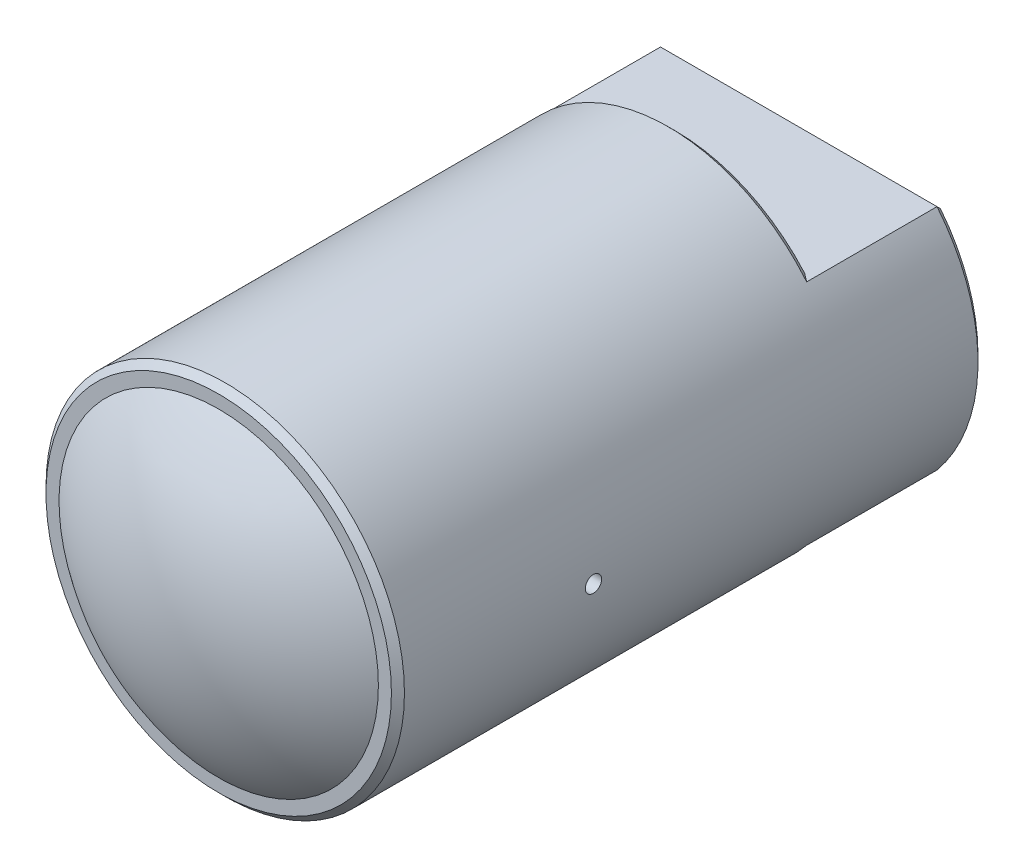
ISO-10303-21;
HEADER;
FILE_DESCRIPTION(('STEP AP214'),'2;1');
FILE_NAME('part.step','',(''),(''),'','','');
FILE_SCHEMA(('AUTOMOTIVE_DESIGN { 1 0 10303 214 1 1 1 1 }'));
ENDSEC;
DATA;
#1=APPLICATION_CONTEXT('core data for automotive mechanical design processes');
#2=APPLICATION_PROTOCOL_DEFINITION('international standard','automotive_design',2000,#1);
#3=PRODUCT_CONTEXT('',#1,'mechanical');
#4=PRODUCT('Part','Part','',(#3));
#5=PRODUCT_RELATED_PRODUCT_CATEGORY('part','',(#4));
#6=PRODUCT_DEFINITION_FORMATION('','',#4);
#7=PRODUCT_DEFINITION_CONTEXT('part definition',#1,'design');
#8=PRODUCT_DEFINITION('design','',#6,#7);
#9=PRODUCT_DEFINITION_SHAPE('','',#8);
#10=(LENGTH_UNIT() NAMED_UNIT(*) SI_UNIT(.MILLI.,.METRE.));
#11=(NAMED_UNIT(*) PLANE_ANGLE_UNIT() SI_UNIT($,.RADIAN.));
#12=(NAMED_UNIT(*) SI_UNIT($,.STERADIAN.) SOLID_ANGLE_UNIT());
#13=UNCERTAINTY_MEASURE_WITH_UNIT(LENGTH_MEASURE(1.E-05),#10,'distance_accuracy_value','');
#14=(GEOMETRIC_REPRESENTATION_CONTEXT(3) GLOBAL_UNCERTAINTY_ASSIGNED_CONTEXT((#13)) GLOBAL_UNIT_ASSIGNED_CONTEXT((#10,
#11,#12)) REPRESENTATION_CONTEXT('',''));
#15=CARTESIAN_POINT('',(0.,0.,0.));
#16=DIRECTION('',(0.,0.,1.));
#17=DIRECTION('',(1.,0.,0.));
#18=AXIS2_PLACEMENT_3D('',#15,#16,#17);
#19=CARTESIAN_POINT('',(0.,0.,3.5));
#20=DIRECTION('',(0.,0.,-1.));
#21=DIRECTION('',(-1.,0.,0.));
#22=AXIS2_PLACEMENT_3D('',#19,#20,#21);
#23=CYLINDRICAL_SURFACE('',#22,2.);
#24=DIRECTION('',(0.,0.,1.));
#25=VECTOR('',#24,1.);
#26=CARTESIAN_POINT('',(2.,0.,0.306249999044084));
#27=LINE('',#26,#25);
#28=CARTESIAN_POINT('',(2.,0.,0.2));
#29=VERTEX_POINT('',#28);
#30=CARTESIAN_POINT('',(2.,0.,0.612499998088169));
#31=VERTEX_POINT('',#30);
#32=EDGE_CURVE('E202',#29,#31,#27,.T.);
#33=ORIENTED_EDGE('',*,*,#32,.F.);
#34=CARTESIAN_POINT('',(0.,0.,0.2));
#35=DIRECTION('',(0.,0.,1.));
#36=DIRECTION('',(1.,0.,0.));
#37=AXIS2_PLACEMENT_3D('',#34,#35,#36);
#38=CIRCLE('',#37,2.);
#39=CARTESIAN_POINT('',(-0.428571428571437,1.95354204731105,0.2));
#40=VERTEX_POINT('',#39);
#41=EDGE_CURVE('E530',#29,#40,#38,.F.);
#42=ORIENTED_EDGE('',*,*,#41,.T.);
#43=CARTESIAN_POINT('',(2.,0.,0.));
#44=CARTESIAN_POINT('',(2.,1.15470053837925,0.0583333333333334));
#45=CARTESIAN_POINT('',(1.,1.73205080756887,0.116666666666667));
#46=CARTESIAN_POINT('',(0.,2.3094010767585,0.175));
#47=CARTESIAN_POINT('',(-1.,1.73205080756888,0.233333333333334));
#48=CARTESIAN_POINT('',(-2.,1.15470053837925,0.291666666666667));
#49=CARTESIAN_POINT('',(-2.,0.,0.35));
#50=CARTESIAN_POINT('',(-2.,-1.15470053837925,0.408333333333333));
#51=CARTESIAN_POINT('',(-1.,-1.73205080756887,0.466666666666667));
#52=CARTESIAN_POINT('',(0.,-2.3094010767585,0.525));
#53=CARTESIAN_POINT('',(1.,-1.73205080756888,0.583333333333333));
#54=CARTESIAN_POINT('',(2.,-1.15470053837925,0.641666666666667));
#55=CARTESIAN_POINT('',(2.,0.,0.7));
#56=CARTESIAN_POINT('',(2.,1.15470053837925,0.758333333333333));
#57=CARTESIAN_POINT('',(1.,1.73205080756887,0.816666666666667));
#58=CARTESIAN_POINT('',(0.,2.3094010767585,0.875));
#59=CARTESIAN_POINT('',(-1.,1.73205080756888,0.933333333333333));
#60=CARTESIAN_POINT('',(-2.,1.15470053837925,0.991666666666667));
#61=CARTESIAN_POINT('',(-2.,0.,1.05));
#62=CARTESIAN_POINT('',(-2.,-1.15470053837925,1.10833333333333));
#63=CARTESIAN_POINT('',(-1.,-1.73205080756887,1.16666666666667));
#64=CARTESIAN_POINT('',(0.,-2.3094010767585,1.225));
#65=CARTESIAN_POINT('',(1.,-1.73205080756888,1.28333333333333));
#66=CARTESIAN_POINT('',(2.,-1.15470053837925,1.34166666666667));
#67=CARTESIAN_POINT('',(2.,0.,1.4));
#68=CARTESIAN_POINT('',(2.,1.15470053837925,1.45833333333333));
#69=CARTESIAN_POINT('',(1.,1.73205080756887,1.51666666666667));
#70=CARTESIAN_POINT('',(0.,2.3094010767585,1.575));
#71=CARTESIAN_POINT('',(-1.,1.73205080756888,1.63333333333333));
#72=CARTESIAN_POINT('',(-2.,1.15470053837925,1.69166666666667));
#73=CARTESIAN_POINT('',(-2.,0.,1.75));
#74=CARTESIAN_POINT('',(-2.,-1.15470053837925,1.80833333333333));
#75=CARTESIAN_POINT('',(-1.,-1.73205080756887,1.86666666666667));
#76=CARTESIAN_POINT('',(0.,-2.3094010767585,1.925));
#77=CARTESIAN_POINT('',(1.,-1.73205080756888,1.98333333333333));
#78=CARTESIAN_POINT('',(2.,-1.15470053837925,2.04166666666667));
#79=CARTESIAN_POINT('',(2.,0.,2.1));
#80=CARTESIAN_POINT('',(2.,1.15470053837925,2.15833333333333));
#81=CARTESIAN_POINT('',(1.,1.73205080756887,2.21666666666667));
#82=CARTESIAN_POINT('',(0.,2.3094010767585,2.275));
#83=CARTESIAN_POINT('',(-1.,1.73205080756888,2.33333333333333));
#84=CARTESIAN_POINT('',(-2.,1.15470053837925,2.39166666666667));
#85=CARTESIAN_POINT('',(-2.,0.,2.45));
#86=CARTESIAN_POINT('',(-2.,-1.15470053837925,2.50833333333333));
#87=CARTESIAN_POINT('',(-1.,-1.73205080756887,2.56666666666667));
#88=CARTESIAN_POINT('',(0.,-2.3094010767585,2.625));
#89=CARTESIAN_POINT('',(1.,-1.73205080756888,2.68333333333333));
#90=CARTESIAN_POINT('',(2.,-1.15470053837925,2.74166666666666));
#91=CARTESIAN_POINT('',(2.,0.,2.8));
#92=CARTESIAN_POINT('',(2.,1.15470053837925,2.85833333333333));
#93=CARTESIAN_POINT('',(1.,1.73205080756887,2.91666666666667));
#94=CARTESIAN_POINT('',(0.,2.3094010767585,2.975));
#95=CARTESIAN_POINT('',(-1.,1.73205080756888,3.03333333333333));
#96=CARTESIAN_POINT('',(-2.,1.15470053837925,3.09166666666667));
#97=CARTESIAN_POINT('',(-2.,0.,3.15));
#98=CARTESIAN_POINT('',(-2.,-1.15470053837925,3.20833333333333));
#99=CARTESIAN_POINT('',(-1.,-1.73205080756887,3.26666666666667));
#100=CARTESIAN_POINT('',(0.,-2.3094010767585,3.325));
#101=CARTESIAN_POINT('',(1.,-1.73205080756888,3.38333333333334));
#102=CARTESIAN_POINT('',(2.,-1.15470053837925,3.44166666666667));
#103=CARTESIAN_POINT('',(2.,0.,3.5));
#104=(BOUNDED_CURVE() B_SPLINE_CURVE(2,(#43,#44,#45,#46,#47,#48,#49,#50,#51,#52,#53,#54,#55,#56,
#57,#58,#59,#60,#61,#62,#63,#64,#65,#66,#67,#68,#69,#70,#71,#72,#73,#74,#75,#76,#77,#78,#79,#80,
#81,#82,#83,#84,#85,#86,#87,#88,#89,#90,#91,#92,#93,#94,#95,#96,#97,#98,#99,#100,#101,#102,
#103),.UNSPECIFIED.,.F.,.F.) B_SPLINE_CURVE_WITH_KNOTS((3,2,2,2,2,2,2,2,2,2,2,2,2,2,2,2,2,2,2,2,
2,2,2,2,2,2,2,2,2,2,3),(0.,0.0333333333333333,0.0666666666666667,0.1,0.133333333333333,
0.166666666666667,0.2,0.233333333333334,0.266666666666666,0.3,0.333333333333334,
0.366666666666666,0.4,0.433333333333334,0.466666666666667,0.5,0.533333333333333,
0.566666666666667,0.6,0.633333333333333,0.666666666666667,0.7,0.733333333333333,
0.766666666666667,0.8,0.833333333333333,0.866666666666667,0.9,0.933333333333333,
0.966666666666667,1.),
.UNSPECIFIED.) CURVE() GEOMETRIC_REPRESENTATION_ITEM() RATIONAL_B_SPLINE_CURVE((1.,
0.866025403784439,1.,0.866025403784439,1.,0.866025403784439,1.,0.866025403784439,1.,
0.866025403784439,1.,0.866025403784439,1.,0.866025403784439,1.,0.866025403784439,1.,
0.866025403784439,1.,0.866025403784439,1.,0.866025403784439,1.,0.866025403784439,1.,
0.866025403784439,1.,0.866025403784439,1.,0.866025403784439,1.,0.866025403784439,1.,
0.866025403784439,1.,0.866025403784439,1.,0.866025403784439,1.,0.866025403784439,1.,
0.866025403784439,1.,0.866025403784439,1.,0.866025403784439,1.,0.866025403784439,1.,
0.866025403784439,1.,0.866025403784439,1.,0.866025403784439,1.,0.866025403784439,1.,
0.866025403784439,1.,0.866025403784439,1.)) REPRESENTATION_ITEM(''));
#105=CARTESIAN_POINT('',(2.,0.,3.5));
#106=VERTEX_POINT('',#105);
#107=EDGE_CURVE('E413',#40,#106,#104,.T.);
#108=ORIENTED_EDGE('',*,*,#107,.T.);
#109=CARTESIAN_POINT('',(0.,0.,3.5));
#110=DIRECTION('',(0.,0.,-1.));
#111=DIRECTION('',(-1.,0.,0.));
#112=AXIS2_PLACEMENT_3D('',#109,#110,#111);
#113=CIRCLE('',#112,2.);
#114=CARTESIAN_POINT('',(1.42705095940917,1.40125856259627,3.5));
#115=VERTEX_POINT('',#114);
#116=EDGE_CURVE('E406',#115,#106,#113,.T.);
#117=ORIENTED_EDGE('',*,*,#116,.F.);
#118=CARTESIAN_POINT('',(2.,0.,0.612499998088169));
#119=CARTESIAN_POINT('',(2.,1.15470053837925,0.670833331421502));
#120=CARTESIAN_POINT('',(1.,1.73205080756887,0.729166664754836));
#121=CARTESIAN_POINT('',(0.,2.3094010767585,0.787499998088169));
#122=CARTESIAN_POINT('',(-1.,1.73205080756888,0.845833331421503));
#123=CARTESIAN_POINT('',(-2.,1.15470053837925,0.904166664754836));
#124=CARTESIAN_POINT('',(-2.,0.,0.962499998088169));
#125=CARTESIAN_POINT('',(-2.,-1.15470053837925,1.0208333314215));
#126=CARTESIAN_POINT('',(-1.,-1.73205080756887,1.07916666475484));
#127=CARTESIAN_POINT('',(0.,-2.3094010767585,1.13749999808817));
#128=CARTESIAN_POINT('',(1.,-1.73205080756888,1.1958333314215));
#129=CARTESIAN_POINT('',(2.,-1.15470053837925,1.25416666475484));
#130=CARTESIAN_POINT('',(2.,0.,1.31249999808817));
#131=CARTESIAN_POINT('',(2.,1.15470053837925,1.3708333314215));
#132=CARTESIAN_POINT('',(1.,1.73205080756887,1.42916666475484));
#133=CARTESIAN_POINT('',(0.,2.3094010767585,1.48749999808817));
#134=CARTESIAN_POINT('',(-1.,1.73205080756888,1.5458333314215));
#135=CARTESIAN_POINT('',(-2.,1.15470053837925,1.60416666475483));
#136=CARTESIAN_POINT('',(-2.,0.,1.66249999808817));
#137=CARTESIAN_POINT('',(-2.,-1.15470053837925,1.7208333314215));
#138=CARTESIAN_POINT('',(-1.,-1.73205080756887,1.77916666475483));
#139=CARTESIAN_POINT('',(0.,-2.3094010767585,1.83749999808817));
#140=CARTESIAN_POINT('',(1.,-1.73205080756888,1.89583333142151));
#141=CARTESIAN_POINT('',(2.,-1.15470053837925,1.95416666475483));
#142=CARTESIAN_POINT('',(2.,0.,2.01249999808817));
#143=CARTESIAN_POINT('',(2.,1.15470053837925,2.0708333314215));
#144=CARTESIAN_POINT('',(1.,1.73205080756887,2.12916666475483));
#145=CARTESIAN_POINT('',(0.,2.3094010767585,2.18749999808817));
#146=CARTESIAN_POINT('',(-1.,1.73205080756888,2.2458333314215));
#147=CARTESIAN_POINT('',(-2.,1.15470053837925,2.30416666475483));
#148=CARTESIAN_POINT('',(-2.,0.,2.36249999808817));
#149=CARTESIAN_POINT('',(-2.,-1.15470053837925,2.4208333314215));
#150=CARTESIAN_POINT('',(-1.,-1.73205080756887,2.47916666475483));
#151=CARTESIAN_POINT('',(0.,-2.3094010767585,2.53749999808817));
#152=CARTESIAN_POINT('',(1.,-1.73205080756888,2.5958333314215));
#153=CARTESIAN_POINT('',(2.,-1.15470053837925,2.65416666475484));
#154=CARTESIAN_POINT('',(2.,0.,2.71249999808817));
#155=CARTESIAN_POINT('',(2.,1.15470053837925,2.7708333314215));
#156=CARTESIAN_POINT('',(1.,1.73205080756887,2.82916666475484));
#157=CARTESIAN_POINT('',(0.,2.3094010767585,2.88749999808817));
#158=CARTESIAN_POINT('',(-1.,1.73205080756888,2.9458333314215));
#159=CARTESIAN_POINT('',(-2.,1.15470053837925,3.00416666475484));
#160=CARTESIAN_POINT('',(-2.,0.,3.06249999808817));
#161=CARTESIAN_POINT('',(-2.,-1.15470053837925,3.1208333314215));
#162=CARTESIAN_POINT('',(-1.,-1.73205080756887,3.17916666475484));
#163=CARTESIAN_POINT('',(0.,-2.3094010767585,3.23749999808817));
#164=CARTESIAN_POINT('',(1.,-1.73205080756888,3.2958333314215));
#165=CARTESIAN_POINT('',(2.,-1.15470053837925,3.35416666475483));
#166=CARTESIAN_POINT('',(2.,0.,3.41249999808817));
#167=CARTESIAN_POINT('',(2.,1.15470053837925,3.4708333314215));
#168=CARTESIAN_POINT('',(1.,1.73205080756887,3.52916666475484));
#169=CARTESIAN_POINT('',(0.,2.3094010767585,3.58749999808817));
#170=CARTESIAN_POINT('',(-1.,1.73205080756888,3.64583333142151));
#171=CARTESIAN_POINT('',(-2.,1.15470053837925,3.70416666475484));
#172=CARTESIAN_POINT('',(-2.,0.,3.76249999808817));
#173=CARTESIAN_POINT('',(-2.,-1.15470053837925,3.8208333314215));
#174=CARTESIAN_POINT('',(-1.,-1.73205080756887,3.87916666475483));
#175=CARTESIAN_POINT('',(0.,-2.3094010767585,3.93749999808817));
#176=CARTESIAN_POINT('',(1.,-1.73205080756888,3.9958333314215));
#177=CARTESIAN_POINT('',(2.,-1.15470053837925,4.05416666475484));
#178=CARTESIAN_POINT('',(2.,0.,4.11249999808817));
#179=(BOUNDED_CURVE() B_SPLINE_CURVE(2,(#118,#119,#120,#121,#122,#123,#124,#125,#126,#127,#128,
#129,#130,#131,#132,#133,#134,#135,#136,#137,#138,#139,#140,#141,#142,#143,#144,#145,#146,#147,
#148,#149,#150,#151,#152,#153,#154,#155,#156,#157,#158,#159,#160,#161,#162,#163,#164,#165,#166,
#167,#168,#169,#170,#171,#172,#173,#174,#175,#176,#177,#178),.UNSPECIFIED.,.F.,
.F.) B_SPLINE_CURVE_WITH_KNOTS((3,2,2,2,2,2,2,2,2,2,2,2,2,2,2,2,2,2,2,2,2,2,2,2,2,2,2,2,2,2,3),
(0.,0.0333333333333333,0.0666666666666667,0.1,0.133333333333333,0.166666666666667,0.2,
0.233333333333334,0.266666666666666,0.3,0.333333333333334,0.366666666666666,0.4,
0.433333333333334,0.466666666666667,0.5,0.533333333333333,0.566666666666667,0.6,
0.633333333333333,0.666666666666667,0.7,0.733333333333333,0.766666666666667,0.8,
0.833333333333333,0.866666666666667,0.9,0.933333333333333,0.966666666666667,1.),
.UNSPECIFIED.) CURVE() GEOMETRIC_REPRESENTATION_ITEM() RATIONAL_B_SPLINE_CURVE((1.,
0.866025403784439,1.,0.866025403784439,1.,0.866025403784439,1.,0.866025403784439,1.,
0.866025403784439,1.,0.866025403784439,1.,0.866025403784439,1.,0.866025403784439,1.,
0.866025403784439,1.,0.866025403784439,1.,0.866025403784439,1.,0.866025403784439,1.,
0.866025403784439,1.,0.866025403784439,1.,0.866025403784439,1.,0.866025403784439,1.,
0.866025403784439,1.,0.866025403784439,1.,0.866025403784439,1.,0.866025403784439,1.,
0.866025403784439,1.,0.866025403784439,1.,0.866025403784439,1.,0.866025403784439,1.,
0.866025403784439,1.,0.866025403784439,1.,0.866025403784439,1.,0.866025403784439,1.,
0.866025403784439,1.,0.866025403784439,1.)) REPRESENTATION_ITEM(''));
#180=EDGE_CURVE('E204',#31,#115,#179,.T.);
#181=ORIENTED_EDGE('',*,*,#180,.F.);
#182=EDGE_LOOP('',(#33,#42,#108,#117,#181));
#183=FACE_BOUND('',#182,.T.);
#184=ADVANCED_FACE('F16',(#183),#23,.F.);
#185=CARTESIAN_POINT('',(0.,0.,3.5));
#186=DIRECTION('',(0.,0.,-1.));
#187=DIRECTION('',(-1.,0.,0.));
#188=AXIS2_PLACEMENT_3D('',#185,#186,#187);
#189=PLANE('',#188);
#190=ORIENTED_EDGE('',*,*,#116,.T.);
#191=CARTESIAN_POINT('',(2.,0.,3.5));
#192=CARTESIAN_POINT('',(1.99535166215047,-0.0531210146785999,3.5));
#193=CARTESIAN_POINT('',(1.98846605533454,-0.106021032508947,3.5));
#194=CARTESIAN_POINT('',(1.97026761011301,-0.211052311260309,3.5));
#195=CARTESIAN_POINT('',(1.95895489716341,-0.26318359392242,3.5));
#196=CARTESIAN_POINT('',(1.91849867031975,-0.41773930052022,3.5));
#197=CARTESIAN_POINT('',(1.8828187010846,-0.518533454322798,3.5));
#198=CARTESIAN_POINT('',(1.79501654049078,-0.712661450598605,3.5));
#199=CARTESIAN_POINT('',(1.7428900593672,-0.805993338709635,3.5));
#200=CARTESIAN_POINT('',(1.62367706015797,-0.982547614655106,3.5));
#201=CARTESIAN_POINT('',(1.55659162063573,-1.06577073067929,3.5));
#202=CARTESIAN_POINT('',(1.40953533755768,-1.21951350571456,3.5));
#203=CARTESIAN_POINT('',(1.32960433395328,-1.29007105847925,3.5));
#204=CARTESIAN_POINT('',(1.20176877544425,-1.38506490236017,3.5));
#205=CARTESIAN_POINT('',(1.157804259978,-1.41493746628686,3.5));
#206=CARTESIAN_POINT('',(1.06749489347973,-1.47087694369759,3.5));
#207=CARTESIAN_POINT('',(1.02114962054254,-1.49694317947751,3.5));
#208=CARTESIAN_POINT('',(0.926220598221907,-1.54525191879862,3.5));
#209=CARTESIAN_POINT('',(0.877627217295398,-1.56747557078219,3.5));
#210=CARTESIAN_POINT('',(0.778561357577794,-1.60719539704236,3.5));
#211=CARTESIAN_POINT('',(0.728089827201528,-1.62469392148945,3.5));
#212=CARTESIAN_POINT('',(0.625800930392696,-1.65483211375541,3.5));
#213=CARTESIAN_POINT('',(0.573985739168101,-1.6674791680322,3.5));
#214=CARTESIAN_POINT('',(0.469337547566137,-1.68783638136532,3.5));
#215=CARTESIAN_POINT('',(0.4165033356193,-1.69554023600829,3.5));
#216=CARTESIAN_POINT('',(0.26731035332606,-1.7101049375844,3.5));
#217=CARTESIAN_POINT('',(0.170335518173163,-1.71123659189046,3.5));
#218=CARTESIAN_POINT('',(-0.0223357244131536,-1.69686745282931,3.5));
#219=CARTESIAN_POINT('',(-0.118032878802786,-1.68137685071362,3.5));
#220=CARTESIAN_POINT('',(-0.246135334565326,-1.64917729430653,3.5));
#221=CARTESIAN_POINT('',(-0.280390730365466,-1.63939916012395,3.5));
#222=CARTESIAN_POINT('',(-0.348184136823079,-1.61770318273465,3.5));
#223=CARTESIAN_POINT('',(-0.381722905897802,-1.60578774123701,3.5));
#224=CARTESIAN_POINT('',(-0.447916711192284,-1.57988204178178,3.5));
#225=CARTESIAN_POINT('',(-0.480573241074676,-1.56589558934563,3.5));
#226=CARTESIAN_POINT('',(-0.544972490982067,-1.53587475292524,3.5));
#227=CARTESIAN_POINT('',(-0.576714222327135,-1.51983824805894,3.5));
#228=CARTESIAN_POINT('',(-0.607917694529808,-1.50281280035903,3.5));
#229=B_SPLINE_CURVE_WITH_KNOTS('',3,(#191,#192,#193,#194,#195,#196,#197,#198,#199,#200,#201,
#202,#203,#204,#205,#206,#207,#208,#209,#210,#211,#212,#213,#214,#215,#216,#217,#218,#219,#220,
#221,#222,#223,#224,#225,#226,#227,#228),.UNSPECIFIED.,.F.,.F.,(4,2,2,2,2,2,2,2,2,2,2,2,2,2,2,2,
2,2,4),(0.,0.159874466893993,0.319744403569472,0.638866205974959,0.958071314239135,
1.27725341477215,1.59546404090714,1.75476542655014,1.91409514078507,2.07418561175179,
2.23419631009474,2.39396241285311,2.55393187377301,2.84337879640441,3.13264835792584,
3.23946842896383,3.34616920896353,3.4526763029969,3.55929448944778),.UNSPECIFIED.);
#230=CARTESIAN_POINT('',(-0.607917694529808,-1.50281280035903,3.5));
#231=VERTEX_POINT('',#230);
#232=EDGE_CURVE('E220',#106,#231,#229,.T.);
#233=ORIENTED_EDGE('',*,*,#232,.T.);
#234=CARTESIAN_POINT('',(-0.607917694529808,-1.50281280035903,3.5));
#235=CARTESIAN_POINT('',(-0.662402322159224,-1.48077993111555,3.5));
#236=CARTESIAN_POINT('',(-0.715658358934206,-1.4557809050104,3.5));
#237=CARTESIAN_POINT('',(-0.819224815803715,-1.40012080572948,3.5));
#238=CARTESIAN_POINT('',(-0.869530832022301,-1.36945153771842,3.5));
#239=CARTESIAN_POINT('',(-0.99311102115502,-1.28453364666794,3.5));
#240=CARTESIAN_POINT('',(-1.06387666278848,-1.22656989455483,3.50000000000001));
#241=CARTESIAN_POINT('',(-1.19468974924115,-1.09956826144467,3.49999999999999));
#242=CARTESIAN_POINT('',(-1.25473051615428,-1.03052353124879,3.49999999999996));
#243=CARTESIAN_POINT('',(-1.36236058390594,-0.883340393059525,3.49999999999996));
#244=CARTESIAN_POINT('',(-1.40995232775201,-0.805203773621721,3.49999999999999));
#245=CARTESIAN_POINT('',(-1.49132993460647,-0.642070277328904,3.50000000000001));
#246=CARTESIAN_POINT('',(-1.52511893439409,-0.557074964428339,3.5));
#247=CARTESIAN_POINT('',(-1.5779479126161,-0.382614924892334,3.5));
#248=CARTESIAN_POINT('',(-1.59698817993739,-0.293150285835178,3.5));
#249=CARTESIAN_POINT('',(-1.61978980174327,-0.112288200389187,3.5));
#250=CARTESIAN_POINT('',(-1.62354708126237,-0.0208902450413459,3.5));
#251=CARTESIAN_POINT('',(-1.61543641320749,0.165965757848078,3.5));
#252=CARTESIAN_POINT('',(-1.60275940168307,0.261392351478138,3.5));
#253=CARTESIAN_POINT('',(-1.57129600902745,0.401688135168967,3.5));
#254=CARTESIAN_POINT('',(-1.55871212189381,0.448030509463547,3.5));
#255=CARTESIAN_POINT('',(-1.52948868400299,0.539419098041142,3.5));
#256=CARTESIAN_POINT('',(-1.51284908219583,0.58446529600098,3.5));
#257=CARTESIAN_POINT('',(-1.49423407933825,0.628708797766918,3.5));
#258=B_SPLINE_CURVE_WITH_KNOTS('',3,(#234,#235,#236,#237,#238,#239,#240,#241,#242,#243,#244,
#245,#246,#247,#248,#249,#250,#251,#252,#253,#254,#255,#256,#257),.UNSPECIFIED.,.F.,.F.,(4,2,2,
2,2,2,2,2,2,2,2,4),(0.,0.176173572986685,0.352603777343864,0.625651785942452,0.898869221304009,
1.17203299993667,1.4451346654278,1.71823098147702,1.99140010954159,2.2785418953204,
2.42244079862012,2.56634151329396),.UNSPECIFIED.);
#259=CARTESIAN_POINT('',(-1.49423407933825,0.628708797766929,3.5));
#260=VERTEX_POINT('',#259);
#261=EDGE_CURVE('E225',#231,#260,#258,.T.);
#262=ORIENTED_EDGE('',*,*,#261,.T.);
#263=CARTESIAN_POINT('',(-1.49423407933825,0.628708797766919,3.5));
#264=CARTESIAN_POINT('',(-1.48297665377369,0.668577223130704,3.5));
#265=CARTESIAN_POINT('',(-1.47020434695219,0.708004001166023,3.5));
#266=CARTESIAN_POINT('',(-1.44170620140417,0.785768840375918,3.5));
#267=CARTESIAN_POINT('',(-1.42598078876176,0.824107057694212,3.5));
#268=CARTESIAN_POINT('',(-1.37453822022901,0.937078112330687,3.5));
#269=CARTESIAN_POINT('',(-1.33451847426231,1.00979530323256,3.5));
#270=CARTESIAN_POINT('',(-1.23890522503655,1.1560254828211,3.5));
#271=CARTESIAN_POINT('',(-1.18207947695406,1.22873852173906,3.5));
#272=CARTESIAN_POINT('',(-1.08839647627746,1.32984304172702,3.5));
#273=CARTESIAN_POINT('',(-1.05574385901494,1.36223055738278,3.5));
#274=CARTESIAN_POINT('',(-0.98783513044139,1.42417635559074,3.5));
#275=CARTESIAN_POINT('',(-0.952579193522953,1.45373482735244,3.5));
#276=CARTESIAN_POINT('',(-0.89793108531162,1.49573389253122,3.5));
#277=CARTESIAN_POINT('',(-0.879423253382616,1.50934237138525,3.5));
#278=CARTESIAN_POINT('',(-0.841902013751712,1.53584426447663,3.5));
#279=CARTESIAN_POINT('',(-0.822888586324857,1.54873765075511,3.5));
#280=CARTESIAN_POINT('',(-0.765144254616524,1.58634310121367,3.5));
#281=CARTESIAN_POINT('',(-0.725707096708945,1.60998213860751,3.5));
#282=CARTESIAN_POINT('',(-0.645141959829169,1.65425513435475,3.5));
#283=CARTESIAN_POINT('',(-0.604012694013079,1.67488674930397,3.5));
#284=CARTESIAN_POINT('',(-0.520338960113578,1.71300786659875,3.5));
#285=CARTESIAN_POINT('',(-0.477794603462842,1.73049761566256,3.5));
#286=CARTESIAN_POINT('',(-0.338710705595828,1.7816451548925,3.5));
#287=CARTESIAN_POINT('',(-0.239731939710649,1.80893670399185,3.5));
#288=CARTESIAN_POINT('',(-0.0387160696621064,1.84667016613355,3.5));
#289=CARTESIAN_POINT('',(0.0633201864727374,1.85711670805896,3.5));
#290=CARTESIAN_POINT('',(0.268857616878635,1.86092917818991,3.5));
#291=CARTESIAN_POINT('',(0.372362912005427,1.85411432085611,3.5));
#292=CARTESIAN_POINT('',(0.525570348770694,1.83099272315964,3.5));
#293=CARTESIAN_POINT('',(0.576326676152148,1.8211261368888,3.5));
#294=CARTESIAN_POINT('',(0.6768331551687,1.79716319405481,3.5));
#295=CARTESIAN_POINT('',(0.726583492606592,1.78306762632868,3.5));
#296=CARTESIAN_POINT('',(0.824758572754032,1.75075256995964,3.5));
#297=CARTESIAN_POINT('',(0.873182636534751,1.73253101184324,3.5));
#298=CARTESIAN_POINT('',(0.944519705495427,1.7021715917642,3.5));
#299=CARTESIAN_POINT('',(0.968086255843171,1.69154513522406,3.5));
#300=CARTESIAN_POINT('',(1.01479865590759,1.6693889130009,3.5));
#301=CARTESIAN_POINT('',(1.03794437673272,1.65785887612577,3.49999999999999));
#302=CARTESIAN_POINT('',(1.1066410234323,1.62200037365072,3.50000000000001));
#303=CARTESIAN_POINT('',(1.15152191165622,1.59637325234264,3.50000000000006));
#304=CARTESIAN_POINT('',(1.2392019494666,1.54179466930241,3.49999999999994));
#305=CARTESIAN_POINT('',(1.28200156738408,1.51284396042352,3.49999999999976));
#306=CARTESIAN_POINT('',(1.34131469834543,1.46935875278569,3.49999999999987));
#307=CARTESIAN_POINT('',(1.35878428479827,1.45611319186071,3.49999999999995));
#308=CARTESIAN_POINT('',(1.39326061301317,1.42908776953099,3.50000000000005));
#309=CARTESIAN_POINT('',(1.41026804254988,1.41530878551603,3.50000000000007));
#310=CARTESIAN_POINT('',(1.42705095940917,1.40125856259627,3.5));
#311=B_SPLINE_CURVE_WITH_KNOTS('',3,(#263,#264,#265,#266,#267,#268,#269,#270,#271,#272,#273,
#274,#275,#276,#277,#278,#279,#280,#281,#282,#283,#284,#285,#286,#287,#288,#289,#290,#291,#292,
#293,#294,#295,#296,#297,#298,#299,#300,#301,#302,#303,#304,#305,#306,#307,#308,#309,#310),
.UNSPECIFIED.,.F.,.F.,(4,2,2,2,2,2,2,2,2,2,2,2,2,2,2,2,2,2,2,2,2,2,2,4),(0.,0.124225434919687,
0.248432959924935,0.496453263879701,0.771879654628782,0.909724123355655,1.04755936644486,
1.1164610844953,1.1853654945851,1.32316601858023,1.46107335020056,1.5989698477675,
1.90540919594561,2.21176432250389,2.52134126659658,2.6763101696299,2.83125018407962,
2.98626808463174,3.06380432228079,3.14136392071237,3.29625361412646,3.45110829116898,
3.51686880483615,3.58252540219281),.UNSPECIFIED.);
#312=EDGE_CURVE('E222',#260,#115,#311,.T.);
#313=ORIENTED_EDGE('',*,*,#312,.T.);
#314=EDGE_LOOP('',(#190,#233,#262,#313));
#315=FACE_BOUND('',#314,.T.);
#316=ADVANCED_FACE('F160',(#315),#189,.T.);
#317=CARTESIAN_POINT('',(0.,0.,18.));
#318=DIRECTION('',(0.,0.,-1.));
#319=DIRECTION('',(-1.,0.,0.));
#320=AXIS2_PLACEMENT_3D('',#317,#318,#319);
#321=CYLINDRICAL_SURFACE('',#320,5.5);
#322=CARTESIAN_POINT('',(-5.5,0.,12.25));
#323=CARTESIAN_POINT('',(-5.50000001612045,-0.00427197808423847,12.2500001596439));
#324=CARTESIAN_POINT('',(-5.49999502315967,-0.00854443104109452,12.2499065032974));
#325=CARTESIAN_POINT('',(-5.49997529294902,-0.0170104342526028,12.2495255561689));
#326=CARTESIAN_POINT('',(-5.49996071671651,-0.0212041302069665,12.249241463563));
#327=CARTESIAN_POINT('',(-5.4999223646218,-0.0295127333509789,12.2484797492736));
#328=CARTESIAN_POINT('',(-5.49989872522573,-0.0336279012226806,12.2480049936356));
#329=CARTESIAN_POINT('',(-5.49984280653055,-0.0417792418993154,12.2468623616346));
#330=CARTESIAN_POINT('',(-5.49981063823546,-0.0458157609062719,12.2461969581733));
#331=CARTESIAN_POINT('',(-5.49973820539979,-0.0538097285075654,12.2446734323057));
#332=CARTESIAN_POINT('',(-5.49969802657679,-0.0577675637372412,12.2438173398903));
#333=CARTESIAN_POINT('',(-5.49961010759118,-0.0656041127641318,12.2419129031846));
#334=CARTESIAN_POINT('',(-5.49956242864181,-0.0694832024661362,12.2408661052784));
#335=CARTESIAN_POINT('',(-5.49946003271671,-0.0771622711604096,12.2385807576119));
#336=CARTESIAN_POINT('',(-5.49940535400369,-0.0809625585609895,12.2373432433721));
#337=CARTESIAN_POINT('',(-5.49928947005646,-0.0884840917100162,12.234676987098));
#338=CARTESIAN_POINT('',(-5.49922828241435,-0.0922055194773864,12.2332487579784));
#339=CARTESIAN_POINT('',(-5.49909987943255,-0.099569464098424,12.2302016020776));
#340=CARTESIAN_POINT('',(-5.49903266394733,-0.103211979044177,12.2285826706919));
#341=CARTESIAN_POINT('',(-5.498892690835,-0.110418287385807,12.2251546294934));
#342=CARTESIAN_POINT('',(-5.49881991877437,-0.113981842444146,12.2233450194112));
#343=CARTESIAN_POINT('',(-5.49866930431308,-0.121030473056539,12.2195361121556));
#344=CARTESIAN_POINT('',(-5.49859143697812,-0.12451502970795,12.2175358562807));
#345=CARTESIAN_POINT('',(-5.49843108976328,-0.131405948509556,12.2133461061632));
#346=CARTESIAN_POINT('',(-5.4983485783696,-0.134811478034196,12.2111552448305));
#347=CARTESIAN_POINT('',(-5.49817938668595,-0.14154465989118,12.206584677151));
#348=CARTESIAN_POINT('',(-5.49809267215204,-0.144871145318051,12.2042032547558));
#349=CARTESIAN_POINT('',(-5.49791550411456,-0.151446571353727,12.1992518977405));
#350=CARTESIAN_POINT('',(-5.49782501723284,-0.154694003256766,12.1966799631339));
#351=CARTESIAN_POINT('',(-5.49764071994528,-0.161111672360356,12.1913478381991));
#352=CARTESIAN_POINT('',(-5.49754688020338,-0.164280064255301,12.1885854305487));
#353=CARTESIAN_POINT('',(-5.49735628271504,-0.1705399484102,12.182872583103));
#354=CARTESIAN_POINT('',(-5.49725950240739,-0.173629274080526,12.1799197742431));
#355=CARTESIAN_POINT('',(-5.49706509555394,-0.179678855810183,12.1738787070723));
#356=CARTESIAN_POINT('',(-5.49696746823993,-0.182638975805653,12.1707903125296));
#357=CARTESIAN_POINT('',(-5.49677417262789,-0.188366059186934,12.1645320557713));
#358=CARTESIAN_POINT('',(-5.49667849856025,-0.191135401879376,12.161364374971));
#359=CARTESIAN_POINT('',(-5.49648999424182,-0.196481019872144,12.1549478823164));
#360=CARTESIAN_POINT('',(-5.4963971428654,-0.199059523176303,12.1517009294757));
#361=CARTESIAN_POINT('',(-5.49621510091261,-0.204023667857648,12.1451262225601));
#362=CARTESIAN_POINT('',(-5.49612587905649,-0.206411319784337,12.1417999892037));
#363=CARTESIAN_POINT('',(-5.49595184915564,-0.210994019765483,12.1350670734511));
#364=CARTESIAN_POINT('',(-5.49586700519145,-0.213190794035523,12.1316615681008));
#365=CARTESIAN_POINT('',(-5.49570241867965,-0.217392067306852,12.1247704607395));
#366=CARTESIAN_POINT('',(-5.49562264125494,-0.219397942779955,12.1212856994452));
#367=CARTESIAN_POINT('',(-5.49546881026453,-0.223217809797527,12.1142364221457));
#368=CARTESIAN_POINT('',(-5.49539472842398,-0.225032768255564,12.1106724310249));
#369=CARTESIAN_POINT('',(-5.49525284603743,-0.22847124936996,12.1034650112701));
#370=CARTESIAN_POINT('',(-5.4951850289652,-0.230095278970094,12.0998218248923));
#371=CARTESIAN_POINT('',(-5.49505616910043,-0.233152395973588,12.0924562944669));
#372=CARTESIAN_POINT('',(-5.49499512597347,-0.234585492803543,12.0887339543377));
#373=CARTESIAN_POINT('',(-5.49488024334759,-0.237261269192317,12.0812103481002));
#374=CARTESIAN_POINT('',(-5.49482642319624,-0.23850343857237,12.0774089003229));
#375=CARTESIAN_POINT('',(-5.49472635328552,-0.240797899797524,12.0697272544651));
#376=CARTESIAN_POINT('',(-5.49468014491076,-0.241849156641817,12.0658467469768));
#377=CARTESIAN_POINT('',(-5.49459560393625,-0.243762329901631,12.0580070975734));
#378=CARTESIAN_POINT('',(-5.4945573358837,-0.244622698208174,12.054047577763));
#379=CARTESIAN_POINT('',(-5.49448892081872,-0.246154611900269,12.0460499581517));
#380=CARTESIAN_POINT('',(-5.49445886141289,-0.246824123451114,12.0420114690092));
#381=CARTESIAN_POINT('',(-5.49440705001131,-0.247974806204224,12.0338559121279));
#382=CARTESIAN_POINT('',(-5.49438540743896,-0.248453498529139,12.0297384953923));
#383=CARTESIAN_POINT('',(-5.49435055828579,-0.249222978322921,12.0214250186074));
#384=CARTESIAN_POINT('',(-5.49433748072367,-0.249510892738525,12.0172286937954));
#385=CARTESIAN_POINT('',(-5.49431983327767,-0.249899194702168,12.0087573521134));
#386=CARTESIAN_POINT('',(-5.49431540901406,-0.249996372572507,12.0044821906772));
#387=CARTESIAN_POINT('',(-5.49431508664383,-0.250003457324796,11.9959302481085));
#388=CARTESIAN_POINT('',(-5.49431919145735,-0.249913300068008,11.9916534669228));
#389=CARTESIAN_POINT('',(-5.49433621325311,-0.249538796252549,11.9831786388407));
#390=CARTESIAN_POINT('',(-5.49434898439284,-0.249257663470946,11.9789804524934));
#391=CARTESIAN_POINT('',(-5.49438323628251,-0.248501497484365,11.9706630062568));
#392=CARTESIAN_POINT('',(-5.49440458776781,-0.248029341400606,11.9665434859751));
#393=CARTESIAN_POINT('',(-5.49445583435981,-0.246891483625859,11.9583834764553));
#394=CARTESIAN_POINT('',(-5.49448561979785,-0.246228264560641,11.9543426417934));
#395=CARTESIAN_POINT('',(-5.49455350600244,-0.244708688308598,11.9463400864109));
#396=CARTESIAN_POINT('',(-5.4945915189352,-0.2438543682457,11.9423779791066));
#397=CARTESIAN_POINT('',(-5.49467557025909,-0.241953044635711,11.9345329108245));
#398=CARTESIAN_POINT('',(-5.49472154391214,-0.240907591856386,11.9306495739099));
#399=CARTESIAN_POINT('',(-5.4948211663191,-0.238624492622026,11.9229620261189));
#400=CARTESIAN_POINT('',(-5.49487477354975,-0.237387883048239,11.9191575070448));
#401=CARTESIAN_POINT('',(-5.4949892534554,-0.234722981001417,11.9116275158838));
#402=CARTESIAN_POINT('',(-5.49505010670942,-0.23329519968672,11.9079018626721));
#403=CARTESIAN_POINT('',(-5.49517861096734,-0.230248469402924,11.9005294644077));
#404=CARTESIAN_POINT('',(-5.49524626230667,-0.228629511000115,11.8968827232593));
#405=CARTESIAN_POINT('',(-5.49538783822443,-0.225200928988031,11.8896679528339));
#406=CARTESIAN_POINT('',(-5.49546177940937,-0.223390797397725,11.8861001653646));
#407=CARTESIAN_POINT('',(-5.49561535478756,-0.219580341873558,11.8790430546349));
#408=CARTESIAN_POINT('',(-5.49569501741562,-0.217579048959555,11.8755542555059));
#409=CARTESIAN_POINT('',(-5.4958594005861,-0.213386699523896,11.8686548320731));
#410=CARTESIAN_POINT('',(-5.49594415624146,-0.211194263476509,11.8652450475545));
#411=CARTESIAN_POINT('',(-5.49611803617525,-0.2066199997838,11.8585033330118));
#412=CARTESIAN_POINT('',(-5.49620719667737,-0.20423644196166,11.8551725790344));
#413=CARTESIAN_POINT('',(-5.49638914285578,-0.199280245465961,11.8485885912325));
#414=CARTESIAN_POINT('',(-5.49648196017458,-0.196705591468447,11.8453368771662));
#415=CARTESIAN_POINT('',(-5.4966704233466,-0.191367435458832,11.8389106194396));
#416=CARTESIAN_POINT('',(-5.49676609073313,-0.188601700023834,11.835737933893));
#417=CARTESIAN_POINT('',(-5.49695940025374,-0.182881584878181,11.8294694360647));
#418=CARTESIAN_POINT('',(-5.49705704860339,-0.179924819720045,11.8263758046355));
#419=CARTESIAN_POINT('',(-5.49725167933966,-0.173876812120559,11.8203192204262));
#420=CARTESIAN_POINT('',(-5.49734866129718,-0.170785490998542,11.8173563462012));
#421=CARTESIAN_POINT('',(-5.49753967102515,-0.164521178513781,11.8116240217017));
#422=CARTESIAN_POINT('',(-5.49763372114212,-0.161350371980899,11.8088521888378));
#423=CARTESIAN_POINT('',(-5.4978184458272,-0.15492742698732,11.8035018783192));
#424=CARTESIAN_POINT('',(-5.49790914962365,-0.151677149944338,11.8009211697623));
#425=CARTESIAN_POINT('',(-5.49808675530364,-0.145095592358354,11.7959529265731));
#426=CARTESIAN_POINT('',(-5.49817369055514,-0.141765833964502,11.7935633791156));
#427=CARTESIAN_POINT('',(-5.49834332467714,-0.135025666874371,11.7889772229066));
#428=CARTESIAN_POINT('',(-5.49842605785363,-0.131616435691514,11.7867788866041));
#429=CARTESIAN_POINT('',(-5.49858684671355,-0.124717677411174,11.782574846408));
#430=CARTESIAN_POINT('',(-5.49866493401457,-0.121228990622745,11.7805677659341));
#431=CARTESIAN_POINT('',(-5.49881598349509,-0.114171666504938,11.7767458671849));
#432=CARTESIAN_POINT('',(-5.49888897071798,-0.110603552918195,11.7749300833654));
#433=CARTESIAN_POINT('',(-5.49902936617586,-0.103387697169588,11.7714903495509));
#434=CARTESIAN_POINT('',(-5.49909678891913,-0.0997401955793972,11.7698658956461));
#435=CARTESIAN_POINT('',(-5.49922559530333,-0.0923658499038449,11.7668083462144));
#436=CARTESIAN_POINT('',(-5.4992869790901,-0.0886390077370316,11.7653752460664));
#437=CARTESIAN_POINT('',(-5.49940324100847,-0.0811062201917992,11.7626998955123));
#438=CARTESIAN_POINT('',(-5.49945810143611,-0.0773000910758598,11.7614581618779));
#439=CARTESIAN_POINT('',(-5.49956084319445,-0.0696089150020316,11.7591650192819));
#440=CARTESIAN_POINT('',(-5.49960868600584,-0.0657235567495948,11.7581146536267));
#441=CARTESIAN_POINT('',(-5.49969691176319,-0.0578740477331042,11.7562037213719));
#442=CARTESIAN_POINT('',(-5.49973723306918,-0.0539095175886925,11.7553447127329));
#443=CARTESIAN_POINT('',(-5.49980992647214,-0.0459017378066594,11.7538159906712));
#444=CARTESIAN_POINT('',(-5.49984221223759,-0.0418580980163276,11.7531483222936));
#445=CARTESIAN_POINT('',(-5.49989833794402,-0.0336920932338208,11.7520017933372));
#446=CARTESIAN_POINT('',(-5.49992206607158,-0.0295693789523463,11.7515254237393));
#447=CARTESIAN_POINT('',(-5.49996056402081,-0.0212452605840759,11.750761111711));
#448=CARTESIAN_POINT('',(-5.4999751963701,-0.0170435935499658,11.7504760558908));
#449=CARTESIAN_POINT('',(-5.49999500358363,-0.00856122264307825,11.750093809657));
#450=CARTESIAN_POINT('',(-5.50000001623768,-0.00428037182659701,11.749999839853));
#451=CARTESIAN_POINT('',(-5.5,0.,11.75));
#452=B_SPLINE_CURVE_WITH_KNOTS('',3,(#322,#323,#324,#325,#326,#327,#328,#329,#330,#331,#332,
#333,#334,#335,#336,#337,#338,#339,#340,#341,#342,#343,#344,#345,#346,#347,#348,#349,#350,#351,
#352,#353,#354,#355,#356,#357,#358,#359,#360,#361,#362,#363,#364,#365,#366,#367,#368,#369,#370,
#371,#372,#373,#374,#375,#376,#377,#378,#379,#380,#381,#382,#383,#384,#385,#386,#387,#388,#389,
#390,#391,#392,#393,#394,#395,#396,#397,#398,#399,#400,#401,#402,#403,#404,#405,#406,#407,#408,
#409,#410,#411,#412,#413,#414,#415,#416,#417,#418,#419,#420,#421,#422,#423,#424,#425,#426,#427,
#428,#429,#430,#431,#432,#433,#434,#435,#436,#437,#438,#439,#440,#441,#442,#443,#444,#445,#446,
#447,#448,#449,#450,#451),.UNSPECIFIED.,.F.,.F.,(4,2,2,2,2,2,2,2,2,2,2,2,2,2,2,2,2,2,2,2,2,2,2,
2,2,2,2,2,2,2,2,2,2,2,2,2,2,2,2,2,2,2,2,2,2,2,2,2,2,2,2,2,2,2,2,2,2,2,2,2,2,2,2,2,4),(0.,
0.0128155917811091,0.0254211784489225,0.0378439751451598,0.050112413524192,0.0622560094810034,
0.0743051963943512,0.0862911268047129,0.0982454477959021,0.110200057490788,0.122186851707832,
0.134237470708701,0.146383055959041,0.158654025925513,0.171079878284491,0.183689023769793,
0.196508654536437,0.209341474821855,0.221962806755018,0.234399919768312,0.246681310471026,
0.258836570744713,0.270896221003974,0.282891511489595,0.294854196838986,0.306816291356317,
0.318809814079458,0.330866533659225,0.343017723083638,0.355293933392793,0.367724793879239,
0.380338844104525,0.39316340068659,0.405992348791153,0.418610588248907,0.431045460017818,
0.44332552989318,0.455480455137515,0.467540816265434,0.479537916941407,0.491503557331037,
0.50346978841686,0.515468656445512,0.527531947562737,0.539690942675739,0.551976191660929,
0.564417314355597,0.577042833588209,0.589880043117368,0.602724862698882,0.615358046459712,
0.627806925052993,0.640100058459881,0.652267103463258,0.664338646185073,0.67634600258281,
0.688320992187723,0.700295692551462,0.712302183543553,0.724372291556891,0.736537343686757,
0.748827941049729,0.761273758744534,0.773903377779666,0.786744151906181),.UNSPECIFIED.);
#453=CARTESIAN_POINT('',(-5.5,0.,12.25));
#454=VERTEX_POINT('',#453);
#455=CARTESIAN_POINT('',(-5.5,0.,11.75));
#456=VERTEX_POINT('',#455);
#457=EDGE_CURVE('E28',#454,#456,#452,.T.);
#458=ORIENTED_EDGE('',*,*,#457,.T.);
#459=CARTESIAN_POINT('',(-5.5,0.,11.75));
#460=CARTESIAN_POINT('',(-5.50000001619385,0.00427723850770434,11.7499998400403));
#461=CARTESIAN_POINT('',(-5.49999501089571,0.00855495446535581,11.7500936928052));
#462=CARTESIAN_POINT('',(-5.49997523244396,0.0170312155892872,11.7504754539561));
#463=CARTESIAN_POINT('',(-5.49996062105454,0.0212299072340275,11.7507601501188));
#464=CARTESIAN_POINT('',(-5.49992217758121,0.0295482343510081,11.7515234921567));
#465=CARTESIAN_POINT('',(-5.49989848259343,0.0336681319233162,11.7519992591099));
#466=CARTESIAN_POINT('',(-5.49984243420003,0.0418286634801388,11.7531443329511));
#467=CARTESIAN_POINT('',(-5.49981019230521,0.0458696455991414,11.7538111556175));
#468=CARTESIAN_POINT('',(-5.49973759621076,0.0538722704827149,11.7553379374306));
#469=CARTESIAN_POINT('',(-5.49969732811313,0.0578343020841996,11.7561958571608));
#470=CARTESIAN_POINT('',(-5.49960921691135,0.0656789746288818,11.7581043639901));
#471=CARTESIAN_POINT('',(-5.49956143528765,0.0695619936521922,11.7591533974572));
#472=CARTESIAN_POINT('',(-5.4994588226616,0.0772486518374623,11.7614436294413));
#473=CARTESIAN_POINT('',(-5.49940403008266,0.0810526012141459,11.7626837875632));
#474=CARTESIAN_POINT('',(-5.49928790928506,0.0885811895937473,11.7653557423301));
#475=CARTESIAN_POINT('',(-5.49922659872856,0.0923060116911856,11.7667870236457));
#476=CARTESIAN_POINT('',(-5.49909794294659,0.0996764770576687,11.7698406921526));
#477=CARTESIAN_POINT('',(-5.49903059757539,0.103322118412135,11.7714630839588));
#478=CARTESIAN_POINT('',(-5.49889035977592,0.110534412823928,11.7748984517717));
#479=CARTESIAN_POINT('',(-5.49881745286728,0.11410082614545,11.7767119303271));
#480=CARTESIAN_POINT('',(-5.49866656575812,0.12115490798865,11.78052897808));
#481=CARTESIAN_POINT('',(-5.49858856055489,0.124642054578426,11.7825335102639));
#482=CARTESIAN_POINT('',(-5.49842793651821,0.131537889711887,11.7867322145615));
#483=CARTESIAN_POINT('',(-5.4983452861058,0.134945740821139,11.7889277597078));
#484=CARTESIAN_POINT('',(-5.49817581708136,0.141683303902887,11.7935080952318));
#485=CARTESIAN_POINT('',(-5.49808896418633,0.145011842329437,11.7958946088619));
#486=CARTESIAN_POINT('',(-5.49791152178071,0.151591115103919,11.8008565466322));
#487=CARTESIAN_POINT('',(-5.49782089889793,0.154840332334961,11.8034339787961));
#488=CARTESIAN_POINT('',(-5.49763633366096,0.161261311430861,11.808777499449));
#489=CARTESIAN_POINT('',(-5.49754236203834,0.164431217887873,11.8115458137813));
#490=CARTESIAN_POINT('',(-5.49735150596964,0.170693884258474,11.8172708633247));
#491=CARTESIAN_POINT('',(-5.49725459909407,0.17378446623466,11.8202299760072));
#492=CARTESIAN_POINT('',(-5.49706012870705,0.179830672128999,11.8262783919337));
#493=CARTESIAN_POINT('',(-5.4969625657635,0.182786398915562,11.8293675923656));
#494=CARTESIAN_POINT('',(-5.49676941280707,0.188504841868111,11.8356272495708));
#495=CARTESIAN_POINT('',(-5.49667381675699,0.191269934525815,11.838795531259));
#496=CARTESIAN_POINT('',(-5.49648547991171,0.196607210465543,11.8452130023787));
#497=CARTESIAN_POINT('',(-5.49639271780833,0.199181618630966,11.8484603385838));
#498=CARTESIAN_POINT('',(-5.49621086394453,0.204137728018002,11.8550355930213));
#499=CARTESIAN_POINT('',(-5.4961217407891,0.206521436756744,11.8583619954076));
#500=CARTESIAN_POINT('',(-5.49594791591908,0.211096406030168,11.8650950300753));
#501=CARTESIAN_POINT('',(-5.49586317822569,0.213289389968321,11.86850048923));
#502=CARTESIAN_POINT('',(-5.49569881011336,0.217483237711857,11.8753912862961));
#503=CARTESIAN_POINT('',(-5.49561914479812,0.219485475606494,11.8788757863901));
#504=CARTESIAN_POINT('',(-5.49546554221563,0.223298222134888,11.8859243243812));
#505=CARTESIAN_POINT('',(-5.49539157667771,0.225109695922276,11.8894878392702));
#506=CARTESIAN_POINT('',(-5.49524992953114,0.228541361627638,11.8966940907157));
#507=CARTESIAN_POINT('',(-5.49518223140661,0.230162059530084,11.9003365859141));
#508=CARTESIAN_POINT('',(-5.4950536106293,0.233212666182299,11.9077005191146));
#509=CARTESIAN_POINT('',(-5.49499268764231,0.234642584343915,11.9114219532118));
#510=CARTESIAN_POINT('',(-5.49487804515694,0.237312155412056,11.9189435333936));
#511=CARTESIAN_POINT('',(-5.49482434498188,0.238551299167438,11.9227438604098));
#512=CARTESIAN_POINT('',(-5.49472451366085,0.240839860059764,11.9304230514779));
#513=CARTESIAN_POINT('',(-5.49467842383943,0.241888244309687,11.9343022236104));
#514=CARTESIAN_POINT('',(-5.49459411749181,0.243795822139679,11.9421389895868));
#515=CARTESIAN_POINT('',(-5.49455596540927,0.244653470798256,11.9460969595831));
#516=CARTESIAN_POINT('',(-5.49448777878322,0.246180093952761,11.9540912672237));
#517=CARTESIAN_POINT('',(-5.49445783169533,0.246847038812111,11.9581279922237));
#518=CARTESIAN_POINT('',(-5.49440624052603,0.247992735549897,11.9662798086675));
#519=CARTESIAN_POINT('',(-5.49438470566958,0.248469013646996,11.9703952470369));
#520=CARTESIAN_POINT('',(-5.49435006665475,0.24923381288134,11.9787045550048));
#521=CARTESIAN_POINT('',(-5.49433709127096,0.249519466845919,11.9828986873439));
#522=CARTESIAN_POINT('',(-5.49431964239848,0.24990338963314,11.9913654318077));
#523=CARTESIAN_POINT('',(-5.49431531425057,0.249998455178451,11.9956381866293));
#524=CARTESIAN_POINT('',(-5.49431517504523,0.250001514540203,12.0041877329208));
#525=CARTESIAN_POINT('',(-5.49431937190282,0.249909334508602,12.0084645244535));
#526=CARTESIAN_POINT('',(-5.49433657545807,0.249530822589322,12.0169392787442));
#527=CARTESIAN_POINT('',(-5.4943494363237,0.2492477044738,12.021137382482));
#528=CARTESIAN_POINT('',(-5.49438386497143,0.248487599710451,12.0294545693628));
#529=CARTESIAN_POINT('',(-5.49440530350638,0.248013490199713,12.0335739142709));
#530=CARTESIAN_POINT('',(-5.49445672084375,0.246871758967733,12.0417334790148));
#531=CARTESIAN_POINT('',(-5.4944865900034,0.246206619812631,12.045774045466));
#532=CARTESIAN_POINT('',(-5.4945546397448,0.244683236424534,12.0537759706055));
#533=CARTESIAN_POINT('',(-5.49459273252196,0.243827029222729,12.0577377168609));
#534=CARTESIAN_POINT('',(-5.49467693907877,0.241921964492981,12.0655819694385));
#535=CARTESIAN_POINT('',(-5.49472298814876,0.240874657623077,12.0694648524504));
#536=CARTESIAN_POINT('',(-5.49482275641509,0.23858788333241,12.0771513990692));
#537=CARTESIAN_POINT('',(-5.4948764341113,0.237349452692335,12.0809553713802));
#538=CARTESIAN_POINT('',(-5.49499104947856,0.234680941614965,12.0884841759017));
#539=CARTESIAN_POINT('',(-5.49505196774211,0.233251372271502,12.0922091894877));
#540=CARTESIAN_POINT('',(-5.49518059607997,0.230201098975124,12.0995802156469));
#541=CARTESIAN_POINT('',(-5.49524830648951,0.228580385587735,12.1032262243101));
#542=CARTESIAN_POINT('',(-5.49538999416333,0.22514832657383,12.1104394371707));
#543=CARTESIAN_POINT('',(-5.49546398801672,0.223336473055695,12.1140063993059));
#544=CARTESIAN_POINT('',(-5.49561766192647,0.219522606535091,12.1210617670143));
#545=CARTESIAN_POINT('',(-5.49569737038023,0.21751962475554,12.1245496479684));
#546=CARTESIAN_POINT('',(-5.49586183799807,0.21332393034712,12.1314471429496));
#547=CARTESIAN_POINT('',(-5.49594663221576,0.211129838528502,12.1348559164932));
#548=CARTESIAN_POINT('',(-5.49612058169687,0.206552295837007,12.1415955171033));
#549=CARTESIAN_POINT('',(-5.49620977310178,0.204167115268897,12.1449251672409));
#550=CARTESIAN_POINT('',(-5.49639177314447,0.199207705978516,12.1515068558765));
#551=CARTESIAN_POINT('',(-5.49648461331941,0.196631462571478,12.1547573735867));
#552=CARTESIAN_POINT('',(-5.49667311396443,0.191290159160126,12.1611811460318));
#553=CARTESIAN_POINT('',(-5.4967687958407,0.188522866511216,12.1643525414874));
#554=CARTESIAN_POINT('',(-5.4969621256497,0.18279967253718,12.1706183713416));
#555=CARTESIAN_POINT('',(-5.49705977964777,0.179841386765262,12.1737106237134));
#556=CARTESIAN_POINT('',(-5.49725434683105,0.17379244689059,12.1797623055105));
#557=CARTESIAN_POINT('',(-5.49735126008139,0.170701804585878,12.1827217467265));
#558=CARTESIAN_POINT('',(-5.49754212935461,0.164438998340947,12.1884474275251));
#559=CARTESIAN_POINT('',(-5.49763610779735,0.161269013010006,12.1912160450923));
#560=CARTESIAN_POINT('',(-5.49782068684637,0.154847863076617,12.1965601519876));
#561=CARTESIAN_POINT('',(-5.49791131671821,0.151598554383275,12.1991378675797));
#562=CARTESIAN_POINT('',(-5.4980887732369,0.145019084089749,12.2041003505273));
#563=CARTESIAN_POINT('',(-5.49817563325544,0.141690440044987,12.2064871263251));
#564=CARTESIAN_POINT('',(-5.49834511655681,0.134952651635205,12.2110679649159));
#565=CARTESIAN_POINT('',(-5.49842777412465,0.131544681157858,12.213263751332));
#566=CARTESIAN_POINT('',(-5.49858841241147,0.124648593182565,12.2174629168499));
#567=CARTESIAN_POINT('',(-5.49866642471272,0.121161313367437,12.2194676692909));
#568=CARTESIAN_POINT('',(-5.49881732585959,0.114106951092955,12.2232851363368));
#569=CARTESIAN_POINT('',(-5.49889023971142,0.110540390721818,12.2250988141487));
#570=CARTESIAN_POINT('',(-5.49903049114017,0.103327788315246,12.228534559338));
#571=CARTESIAN_POINT('',(-5.49909784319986,0.0996819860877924,12.2301571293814));
#572=CARTESIAN_POINT('',(-5.49922651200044,0.0923111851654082,12.2332111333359));
#573=CARTESIAN_POINT('',(-5.49928782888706,0.0885861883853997,12.2346425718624));
#574=CARTESIAN_POINT('',(-5.49940396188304,0.0810572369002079,12.2373148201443));
#575=CARTESIAN_POINT('',(-5.49945876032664,0.0772530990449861,12.2385551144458));
#576=CARTESIAN_POINT('',(-5.4995613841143,0.069566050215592,12.2408455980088));
#577=CARTESIAN_POINT('',(-5.49960917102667,0.0656828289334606,12.2418947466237));
#578=CARTESIAN_POINT('',(-5.49969729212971,0.0578377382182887,12.2438034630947));
#579=CARTESIAN_POINT('',(-5.49973756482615,0.0538754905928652,12.2446614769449));
#580=CARTESIAN_POINT('',(-5.49981016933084,0.0458724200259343,12.2461884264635));
#581=CARTESIAN_POINT('',(-5.49984241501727,0.041831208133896,12.2468553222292));
#582=CARTESIAN_POINT('',(-5.4998984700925,0.0336702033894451,12.2480005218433));
#583=CARTESIAN_POINT('',(-5.49992216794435,0.0295500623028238,12.2484763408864));
#584=CARTESIAN_POINT('',(-5.49996061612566,0.0212312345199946,12.2492397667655));
#585=CARTESIAN_POINT('',(-5.49997522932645,0.0170322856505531,12.2495244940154));
#586=CARTESIAN_POINT('',(-5.4999950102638,0.00855549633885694,12.2499062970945));
#587=CARTESIAN_POINT('',(-5.50000001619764,0.00427750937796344,12.2500001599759));
#588=CARTESIAN_POINT('',(-5.5,0.,12.25));
#589=B_SPLINE_CURVE_WITH_KNOTS('',3,(#459,#460,#461,#462,#463,#464,#465,#466,#467,#468,#469,
#470,#471,#472,#473,#474,#475,#476,#477,#478,#479,#480,#481,#482,#483,#484,#485,#486,#487,#488,
#489,#490,#491,#492,#493,#494,#495,#496,#497,#498,#499,#500,#501,#502,#503,#504,#505,#506,#507,
#508,#509,#510,#511,#512,#513,#514,#515,#516,#517,#518,#519,#520,#521,#522,#523,#524,#525,#526,
#527,#528,#529,#530,#531,#532,#533,#534,#535,#536,#537,#538,#539,#540,#541,#542,#543,#544,#545,
#546,#547,#548,#549,#550,#551,#552,#553,#554,#555,#556,#557,#558,#559,#560,#561,#562,#563,#564,
#565,#566,#567,#568,#569,#570,#571,#572,#573,#574,#575,#576,#577,#578,#579,#580,#581,#582,#583,
#584,#585,#586,#587,#588),.UNSPECIFIED.,.F.,.F.,(4,2,2,2,2,2,2,2,2,2,2,2,2,2,2,2,2,2,2,2,2,2,2,
2,2,2,2,2,2,2,2,2,2,2,2,2,2,2,2,2,2,2,2,2,2,2,2,2,2,2,2,2,2,2,2,2,2,2,2,2,2,2,2,2,4),(0.,
0.0128313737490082,0.0254520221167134,0.0378892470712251,0.0501715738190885,0.0623286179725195,
0.0743909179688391,0.0863897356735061,0.0983568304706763,0.110324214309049,0.122323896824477,
0.134387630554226,0.146546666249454,0.158831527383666,0.171271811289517,0.183896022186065,
0.196731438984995,0.209556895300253,0.222171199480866,0.23460158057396,0.246876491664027,
0.259025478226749,0.271079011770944,0.283068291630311,0.295025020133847,0.306981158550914,
0.318968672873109,0.331019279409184,0.343164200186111,0.355433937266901,0.367858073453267,
0.380465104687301,0.393282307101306,0.406111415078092,0.418729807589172,0.431164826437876,
0.443445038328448,0.455600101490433,0.467660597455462,0.479657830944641,0.491623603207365,
0.50358996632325,0.515588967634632,0.527652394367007,0.539811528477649,0.552096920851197,
0.564538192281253,0.577163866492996,0.590001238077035,0.602837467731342,0.615462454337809,
0.627903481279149,0.640189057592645,0.652348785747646,0.664413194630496,0.67641354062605,
0.688381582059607,0.700349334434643,0.712348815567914,0.724411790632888,0.736569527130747,
0.748852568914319,0.761290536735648,0.773911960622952,0.786744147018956),.UNSPECIFIED.);
#590=EDGE_CURVE('E10',#456,#454,#589,.T.);
#591=ORIENTED_EDGE('',*,*,#590,.T.);
#592=EDGE_LOOP('',(#458,#591));
#593=FACE_BOUND('',#592,.T.);
#594=CARTESIAN_POINT('',(5.5,0.,12.25));
#595=CARTESIAN_POINT('',(5.50000001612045,0.00427197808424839,12.2500001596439));
#596=CARTESIAN_POINT('',(5.49999502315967,0.0085444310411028,12.2499065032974));
#597=CARTESIAN_POINT('',(5.49997529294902,0.0170104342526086,12.2495255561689));
#598=CARTESIAN_POINT('',(5.49996071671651,0.0212041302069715,12.249241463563));
#599=CARTESIAN_POINT('',(5.4999223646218,0.0295127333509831,12.2484797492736));
#600=CARTESIAN_POINT('',(5.49989872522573,0.0336279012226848,12.2480049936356));
#601=CARTESIAN_POINT('',(5.49984280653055,0.0417792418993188,12.2468623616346));
#602=CARTESIAN_POINT('',(5.49981063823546,0.0458157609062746,12.2461969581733));
#603=CARTESIAN_POINT('',(5.49973820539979,0.0538097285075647,12.2446734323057));
#604=CARTESIAN_POINT('',(5.49969802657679,0.0577675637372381,12.2438173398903));
#605=CARTESIAN_POINT('',(5.49961010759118,0.0656041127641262,12.2419129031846));
#606=CARTESIAN_POINT('',(5.49956242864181,0.0694832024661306,12.2408661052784));
#607=CARTESIAN_POINT('',(5.49946003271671,0.0771622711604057,12.2385807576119));
#608=CARTESIAN_POINT('',(5.49940535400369,0.0809625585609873,12.2373432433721));
#609=CARTESIAN_POINT('',(5.49928947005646,0.0884840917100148,12.234676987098));
#610=CARTESIAN_POINT('',(5.49922828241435,0.0922055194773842,12.2332487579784));
#611=CARTESIAN_POINT('',(5.49909987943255,0.0995694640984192,12.2302016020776));
#612=CARTESIAN_POINT('',(5.49903266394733,0.103211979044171,12.2285826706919));
#613=CARTESIAN_POINT('',(5.498892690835,0.110418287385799,12.2251546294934));
#614=CARTESIAN_POINT('',(5.49881991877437,0.113981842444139,12.2233450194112));
#615=CARTESIAN_POINT('',(5.49866930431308,0.121030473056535,12.2195361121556));
#616=CARTESIAN_POINT('',(5.49859143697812,0.12451502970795,12.2175358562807));
#617=CARTESIAN_POINT('',(5.49843108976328,0.131405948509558,12.2133461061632));
#618=CARTESIAN_POINT('',(5.4983485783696,0.134811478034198,12.2111552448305));
#619=CARTESIAN_POINT('',(5.49817938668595,0.141544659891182,12.206584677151));
#620=CARTESIAN_POINT('',(5.49809267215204,0.144871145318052,12.2042032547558));
#621=CARTESIAN_POINT('',(5.49791550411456,0.15144657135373,12.1992518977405));
#622=CARTESIAN_POINT('',(5.49782501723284,0.154694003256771,12.1966799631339));
#623=CARTESIAN_POINT('',(5.49764071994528,0.161111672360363,12.1913478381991));
#624=CARTESIAN_POINT('',(5.49754688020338,0.16428006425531,12.1885854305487));
#625=CARTESIAN_POINT('',(5.49735628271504,0.170539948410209,12.182872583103));
#626=CARTESIAN_POINT('',(5.49725950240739,0.173629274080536,12.1799197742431));
#627=CARTESIAN_POINT('',(5.49706509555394,0.179678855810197,12.1738787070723));
#628=CARTESIAN_POINT('',(5.49696746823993,0.18263897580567,12.1707903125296));
#629=CARTESIAN_POINT('',(5.49677417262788,0.188366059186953,12.1645320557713));
#630=CARTESIAN_POINT('',(5.49667849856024,0.191135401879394,12.161364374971));
#631=CARTESIAN_POINT('',(5.49648999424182,0.196481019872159,12.1549478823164));
#632=CARTESIAN_POINT('',(5.4963971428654,0.199059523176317,12.1517009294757));
#633=CARTESIAN_POINT('',(5.49621510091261,0.204023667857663,12.1451262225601));
#634=CARTESIAN_POINT('',(5.49612587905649,0.206411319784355,12.1417999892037));
#635=CARTESIAN_POINT('',(5.49595184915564,0.210994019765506,12.1350670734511));
#636=CARTESIAN_POINT('',(5.49586700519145,0.213190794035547,12.1316615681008));
#637=CARTESIAN_POINT('',(5.49570241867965,0.217392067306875,12.1247704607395));
#638=CARTESIAN_POINT('',(5.49562264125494,0.219397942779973,12.1212856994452));
#639=CARTESIAN_POINT('',(5.49546881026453,0.223217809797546,12.1142364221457));
#640=CARTESIAN_POINT('',(5.49539472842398,0.225032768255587,12.1106724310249));
#641=CARTESIAN_POINT('',(5.49525284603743,0.228471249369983,12.1034650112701));
#642=CARTESIAN_POINT('',(5.4951850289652,0.230095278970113,12.0998218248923));
#643=CARTESIAN_POINT('',(5.49505616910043,0.233152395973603,12.0924562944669));
#644=CARTESIAN_POINT('',(5.49499512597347,0.234585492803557,12.0887339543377));
#645=CARTESIAN_POINT('',(5.49488024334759,0.237261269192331,12.0812103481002));
#646=CARTESIAN_POINT('',(5.49482642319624,0.238503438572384,12.0774089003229));
#647=CARTESIAN_POINT('',(5.49472635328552,0.240797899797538,12.0697272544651));
#648=CARTESIAN_POINT('',(5.49468014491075,0.24184915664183,12.0658467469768));
#649=CARTESIAN_POINT('',(5.49459560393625,0.24376232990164,12.0580070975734));
#650=CARTESIAN_POINT('',(5.4945573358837,0.244622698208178,12.054047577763));
#651=CARTESIAN_POINT('',(5.49448892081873,0.246154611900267,12.0460499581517));
#652=CARTESIAN_POINT('',(5.49445886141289,0.24682412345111,12.0420114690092));
#653=CARTESIAN_POINT('',(5.49440705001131,0.247974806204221,12.0338559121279));
#654=CARTESIAN_POINT('',(5.49438540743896,0.248453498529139,12.0297384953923));
#655=CARTESIAN_POINT('',(5.49435055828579,0.24922297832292,12.0214250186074));
#656=CARTESIAN_POINT('',(5.49433748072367,0.249510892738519,12.0172286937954));
#657=CARTESIAN_POINT('',(5.49431983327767,0.249899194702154,12.0087573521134));
#658=CARTESIAN_POINT('',(5.49431540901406,0.249996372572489,12.0044821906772));
#659=CARTESIAN_POINT('',(5.49431508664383,0.250003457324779,11.9959302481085));
#660=CARTESIAN_POINT('',(5.49431919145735,0.249913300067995,11.9916534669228));
#661=CARTESIAN_POINT('',(5.49433621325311,0.249538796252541,11.9831786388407));
#662=CARTESIAN_POINT('',(5.49434898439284,0.249257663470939,11.9789804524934));
#663=CARTESIAN_POINT('',(5.49438323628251,0.248501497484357,11.9706630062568));
#664=CARTESIAN_POINT('',(5.4944045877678,0.248029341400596,11.9665434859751));
#665=CARTESIAN_POINT('',(5.49445583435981,0.246891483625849,11.9583834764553));
#666=CARTESIAN_POINT('',(5.49448561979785,0.246228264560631,11.9543426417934));
#667=CARTESIAN_POINT('',(5.49455350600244,0.244708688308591,11.9463400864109));
#668=CARTESIAN_POINT('',(5.4945915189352,0.243854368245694,11.9423779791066));
#669=CARTESIAN_POINT('',(5.49467557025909,0.241953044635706,11.9345329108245));
#670=CARTESIAN_POINT('',(5.49472154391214,0.240907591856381,11.9306495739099));
#671=CARTESIAN_POINT('',(5.4948211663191,0.238624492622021,11.9229620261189));
#672=CARTESIAN_POINT('',(5.49487477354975,0.237387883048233,11.9191575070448));
#673=CARTESIAN_POINT('',(5.4949892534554,0.234722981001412,11.9116275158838));
#674=CARTESIAN_POINT('',(5.49505010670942,0.233295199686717,11.9079018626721));
#675=CARTESIAN_POINT('',(5.49517861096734,0.230248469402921,11.9005294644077));
#676=CARTESIAN_POINT('',(5.49524626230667,0.228629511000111,11.8968827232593));
#677=CARTESIAN_POINT('',(5.49538783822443,0.225200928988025,11.8896679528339));
#678=CARTESIAN_POINT('',(5.49546177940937,0.223390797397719,11.8861001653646));
#679=CARTESIAN_POINT('',(5.49561535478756,0.219580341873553,11.8790430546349));
#680=CARTESIAN_POINT('',(5.49569501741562,0.21757904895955,11.8755542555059));
#681=CARTESIAN_POINT('',(5.4958594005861,0.213386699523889,11.8686548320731));
#682=CARTESIAN_POINT('',(5.49594415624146,0.211194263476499,11.8652450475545));
#683=CARTESIAN_POINT('',(5.49611803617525,0.206619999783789,11.8585033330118));
#684=CARTESIAN_POINT('',(5.49620719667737,0.20423644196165,11.8551725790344));
#685=CARTESIAN_POINT('',(5.49638914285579,0.199280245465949,11.8485885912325));
#686=CARTESIAN_POINT('',(5.49648196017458,0.196705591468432,11.8453368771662));
#687=CARTESIAN_POINT('',(5.4966704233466,0.191367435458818,11.8389106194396));
#688=CARTESIAN_POINT('',(5.49676609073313,0.188601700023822,11.835737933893));
#689=CARTESIAN_POINT('',(5.49695940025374,0.18288158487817,11.8294694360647));
#690=CARTESIAN_POINT('',(5.49705704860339,0.17992481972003,11.8263758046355));
#691=CARTESIAN_POINT('',(5.49725167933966,0.173876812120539,11.8203192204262));
#692=CARTESIAN_POINT('',(5.49734866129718,0.17078549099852,11.8173563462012));
#693=CARTESIAN_POINT('',(5.49753967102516,0.164521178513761,11.8116240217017));
#694=CARTESIAN_POINT('',(5.49763372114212,0.161350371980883,11.8088521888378));
#695=CARTESIAN_POINT('',(5.4978184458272,0.154927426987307,11.8035018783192));
#696=CARTESIAN_POINT('',(5.49790914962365,0.151677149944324,11.8009211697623));
#697=CARTESIAN_POINT('',(5.49808675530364,0.145095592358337,11.7959529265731));
#698=CARTESIAN_POINT('',(5.49817369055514,0.141765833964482,11.7935633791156));
#699=CARTESIAN_POINT('',(5.49834332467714,0.135025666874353,11.7889772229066));
#700=CARTESIAN_POINT('',(5.49842605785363,0.131616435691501,11.7867788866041));
#701=CARTESIAN_POINT('',(5.49858684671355,0.124717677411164,11.782574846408));
#702=CARTESIAN_POINT('',(5.49866493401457,0.121228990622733,11.7805677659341));
#703=CARTESIAN_POINT('',(5.49881598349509,0.114171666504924,11.7767458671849));
#704=CARTESIAN_POINT('',(5.49888897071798,0.11060355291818,11.7749300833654));
#705=CARTESIAN_POINT('',(5.49902936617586,0.103387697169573,11.7714903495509));
#706=CARTESIAN_POINT('',(5.49909678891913,0.0997401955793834,11.7698658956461));
#707=CARTESIAN_POINT('',(5.49922559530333,0.0923658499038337,11.7668083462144));
#708=CARTESIAN_POINT('',(5.4992869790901,0.0886390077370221,11.7653752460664));
#709=CARTESIAN_POINT('',(5.49940324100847,0.0811062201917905,11.7626998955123));
#710=CARTESIAN_POINT('',(5.49945810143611,0.0773000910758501,11.7614581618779));
#711=CARTESIAN_POINT('',(5.49956084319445,0.0696089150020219,11.7591650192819));
#712=CARTESIAN_POINT('',(5.49960868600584,0.0657235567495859,11.7581146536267));
#713=CARTESIAN_POINT('',(5.49969691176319,0.0578740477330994,11.7562037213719));
#714=CARTESIAN_POINT('',(5.49973723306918,0.0539095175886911,11.7553447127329));
#715=CARTESIAN_POINT('',(5.49980992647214,0.0459017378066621,11.7538159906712));
#716=CARTESIAN_POINT('',(5.49984221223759,0.041858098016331,11.7531483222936));
#717=CARTESIAN_POINT('',(5.49989833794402,0.0336920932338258,11.7520017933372));
#718=CARTESIAN_POINT('',(5.49992206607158,0.0295693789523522,11.7515254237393));
#719=CARTESIAN_POINT('',(5.49996056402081,0.0212452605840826,11.750761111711));
#720=CARTESIAN_POINT('',(5.4999751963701,0.0170435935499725,11.7504760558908));
#721=CARTESIAN_POINT('',(5.49999500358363,0.00856122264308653,11.750093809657));
#722=CARTESIAN_POINT('',(5.50000001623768,0.00428037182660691,11.749999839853));
#723=CARTESIAN_POINT('',(5.5,0.,11.75));
#724=B_SPLINE_CURVE_WITH_KNOTS('',3,(#594,#595,#596,#597,#598,#599,#600,#601,#602,#603,#604,
#605,#606,#607,#608,#609,#610,#611,#612,#613,#614,#615,#616,#617,#618,#619,#620,#621,#622,#623,
#624,#625,#626,#627,#628,#629,#630,#631,#632,#633,#634,#635,#636,#637,#638,#639,#640,#641,#642,
#643,#644,#645,#646,#647,#648,#649,#650,#651,#652,#653,#654,#655,#656,#657,#658,#659,#660,#661,
#662,#663,#664,#665,#666,#667,#668,#669,#670,#671,#672,#673,#674,#675,#676,#677,#678,#679,#680,
#681,#682,#683,#684,#685,#686,#687,#688,#689,#690,#691,#692,#693,#694,#695,#696,#697,#698,#699,
#700,#701,#702,#703,#704,#705,#706,#707,#708,#709,#710,#711,#712,#713,#714,#715,#716,#717,#718,
#719,#720,#721,#722,#723),.UNSPECIFIED.,.F.,.F.,(4,2,2,2,2,2,2,2,2,2,2,2,2,2,2,2,2,2,2,2,2,2,2,
2,2,2,2,2,2,2,2,2,2,2,2,2,2,2,2,2,2,2,2,2,2,2,2,2,2,2,2,2,2,2,2,2,2,2,2,2,2,2,2,2,4),(0.,
0.0128155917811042,0.0254211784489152,0.0378439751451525,0.0501124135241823,0.0622560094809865,
0.0743051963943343,0.0862911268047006,0.0982454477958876,0.110200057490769,0.122186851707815,
0.134237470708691,0.146383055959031,0.158654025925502,0.171079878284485,0.183689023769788,
0.196508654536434,0.209341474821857,0.221962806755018,0.234399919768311,0.24668131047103,
0.258836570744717,0.270896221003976,0.2828915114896,0.294854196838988,0.306816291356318,
0.318809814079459,0.330866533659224,0.343017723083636,0.35529393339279,0.367724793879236,
0.380338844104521,0.393163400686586,0.405992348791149,0.418610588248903,0.431045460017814,
0.443325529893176,0.455480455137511,0.467540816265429,0.479537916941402,0.491503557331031,
0.503469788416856,0.515468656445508,0.527531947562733,0.539690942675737,0.551976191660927,
0.564417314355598,0.577042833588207,0.58988004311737,0.602724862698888,0.615358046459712,
0.627806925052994,0.640100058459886,0.652267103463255,0.664338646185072,0.676346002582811,
0.688320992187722,0.700295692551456,0.712302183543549,0.724372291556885,0.736537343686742,
0.748827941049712,0.761273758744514,0.773903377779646,0.786744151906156),.UNSPECIFIED.);
#725=CARTESIAN_POINT('',(5.5,0.,12.25));
#726=VERTEX_POINT('',#725);
#727=CARTESIAN_POINT('',(5.5,0.,11.75));
#728=VERTEX_POINT('',#727);
#729=EDGE_CURVE('E130',#726,#728,#724,.T.);
#730=ORIENTED_EDGE('',*,*,#729,.T.);
#731=CARTESIAN_POINT('',(5.5,0.,11.75));
#732=CARTESIAN_POINT('',(5.50000001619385,-0.00427723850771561,11.7499998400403));
#733=CARTESIAN_POINT('',(5.49999501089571,-0.00855495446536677,11.7500936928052));
#734=CARTESIAN_POINT('',(5.49997523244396,-0.0170312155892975,11.7504754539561));
#735=CARTESIAN_POINT('',(5.49996062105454,-0.0212299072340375,11.7507601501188));
#736=CARTESIAN_POINT('',(5.49992217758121,-0.0295482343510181,11.7515234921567));
#737=CARTESIAN_POINT('',(5.49989848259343,-0.0336681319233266,11.7519992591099));
#738=CARTESIAN_POINT('',(5.49984243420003,-0.0418286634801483,11.7531443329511));
#739=CARTESIAN_POINT('',(5.49981019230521,-0.0458696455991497,11.7538111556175));
#740=CARTESIAN_POINT('',(5.49973759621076,-0.0538722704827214,11.7553379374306));
#741=CARTESIAN_POINT('',(5.49969732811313,-0.0578343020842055,11.7561958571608));
#742=CARTESIAN_POINT('',(5.49960921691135,-0.0656789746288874,11.7581043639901));
#743=CARTESIAN_POINT('',(5.49956143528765,-0.0695619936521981,11.7591533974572));
#744=CARTESIAN_POINT('',(5.4994588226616,-0.0772486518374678,11.7614436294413));
#745=CARTESIAN_POINT('',(5.49940403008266,-0.0810526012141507,11.7626837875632));
#746=CARTESIAN_POINT('',(5.49928790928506,-0.0885811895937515,11.7653557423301));
#747=CARTESIAN_POINT('',(5.49922659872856,-0.0923060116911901,11.7667870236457));
#748=CARTESIAN_POINT('',(5.49909794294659,-0.0996764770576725,11.7698406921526));
#749=CARTESIAN_POINT('',(5.49903059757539,-0.103322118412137,11.7714630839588));
#750=CARTESIAN_POINT('',(5.49889035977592,-0.11053441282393,11.7748984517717));
#751=CARTESIAN_POINT('',(5.49881745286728,-0.114100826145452,11.7767119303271));
#752=CARTESIAN_POINT('',(5.49866656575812,-0.121154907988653,11.78052897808));
#753=CARTESIAN_POINT('',(5.49858856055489,-0.124642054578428,11.7825335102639));
#754=CARTESIAN_POINT('',(5.49842793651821,-0.131537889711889,11.7867322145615));
#755=CARTESIAN_POINT('',(5.4983452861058,-0.13494574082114,11.7889277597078));
#756=CARTESIAN_POINT('',(5.49817581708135,-0.141683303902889,11.7935080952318));
#757=CARTESIAN_POINT('',(5.49808896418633,-0.14501184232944,11.7958946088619));
#758=CARTESIAN_POINT('',(5.49791152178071,-0.151591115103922,11.8008565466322));
#759=CARTESIAN_POINT('',(5.49782089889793,-0.154840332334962,11.8034339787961));
#760=CARTESIAN_POINT('',(5.49763633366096,-0.161261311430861,11.808777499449));
#761=CARTESIAN_POINT('',(5.49754236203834,-0.164431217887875,11.8115458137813));
#762=CARTESIAN_POINT('',(5.49735150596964,-0.170693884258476,11.8172708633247));
#763=CARTESIAN_POINT('',(5.49725459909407,-0.173784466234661,11.8202299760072));
#764=CARTESIAN_POINT('',(5.49706012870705,-0.179830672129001,11.8262783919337));
#765=CARTESIAN_POINT('',(5.4969625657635,-0.182786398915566,11.8293675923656));
#766=CARTESIAN_POINT('',(5.49676941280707,-0.188504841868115,11.8356272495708));
#767=CARTESIAN_POINT('',(5.49667381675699,-0.191269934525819,11.838795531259));
#768=CARTESIAN_POINT('',(5.49648547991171,-0.196607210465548,11.8452130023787));
#769=CARTESIAN_POINT('',(5.49639271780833,-0.199181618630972,11.8484603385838));
#770=CARTESIAN_POINT('',(5.49621086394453,-0.204137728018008,11.8550355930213));
#771=CARTESIAN_POINT('',(5.4961217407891,-0.20652143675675,11.8583619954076));
#772=CARTESIAN_POINT('',(5.49594791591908,-0.211096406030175,11.8650950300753));
#773=CARTESIAN_POINT('',(5.49586317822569,-0.213289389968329,11.86850048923));
#774=CARTESIAN_POINT('',(5.49569881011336,-0.217483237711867,11.8753912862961));
#775=CARTESIAN_POINT('',(5.49561914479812,-0.219485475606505,11.8788757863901));
#776=CARTESIAN_POINT('',(5.49546554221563,-0.223298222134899,11.8859243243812));
#777=CARTESIAN_POINT('',(5.49539157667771,-0.225109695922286,11.8894878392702));
#778=CARTESIAN_POINT('',(5.49524992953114,-0.228541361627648,11.8966940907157));
#779=CARTESIAN_POINT('',(5.49518223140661,-0.230162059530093,11.9003365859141));
#780=CARTESIAN_POINT('',(5.4950536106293,-0.23321266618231,11.9077005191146));
#781=CARTESIAN_POINT('',(5.49499268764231,-0.234642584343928,11.9114219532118));
#782=CARTESIAN_POINT('',(5.49487804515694,-0.237312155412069,11.9189435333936));
#783=CARTESIAN_POINT('',(5.49482434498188,-0.238551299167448,11.9227438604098));
#784=CARTESIAN_POINT('',(5.49472451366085,-0.240839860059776,11.9304230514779));
#785=CARTESIAN_POINT('',(5.49467842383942,-0.241888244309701,11.9343022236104));
#786=CARTESIAN_POINT('',(5.49459411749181,-0.243795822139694,11.9421389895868));
#787=CARTESIAN_POINT('',(5.49455596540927,-0.244653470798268,11.9460969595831));
#788=CARTESIAN_POINT('',(5.49448777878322,-0.246180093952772,11.9540912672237));
#789=CARTESIAN_POINT('',(5.49445783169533,-0.246847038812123,11.9581279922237));
#790=CARTESIAN_POINT('',(5.49440624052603,-0.247992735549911,11.9662798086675));
#791=CARTESIAN_POINT('',(5.49438470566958,-0.248469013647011,11.9703952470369));
#792=CARTESIAN_POINT('',(5.49435006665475,-0.249233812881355,11.9787045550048));
#793=CARTESIAN_POINT('',(5.49433709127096,-0.249519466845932,11.9828986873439));
#794=CARTESIAN_POINT('',(5.49431964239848,-0.249903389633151,11.9913654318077));
#795=CARTESIAN_POINT('',(5.49431531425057,-0.249998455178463,11.9956381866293));
#796=CARTESIAN_POINT('',(5.49431517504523,-0.250001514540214,12.0041877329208));
#797=CARTESIAN_POINT('',(5.49431937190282,-0.249909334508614,12.0084645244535));
#798=CARTESIAN_POINT('',(5.49433657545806,-0.249530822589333,12.0169392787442));
#799=CARTESIAN_POINT('',(5.4943494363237,-0.24924770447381,12.021137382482));
#800=CARTESIAN_POINT('',(5.49438386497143,-0.248487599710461,12.0294545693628));
#801=CARTESIAN_POINT('',(5.49440530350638,-0.248013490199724,12.0335739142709));
#802=CARTESIAN_POINT('',(5.49445672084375,-0.246871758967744,12.0417334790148));
#803=CARTESIAN_POINT('',(5.4944865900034,-0.246206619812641,12.045774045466));
#804=CARTESIAN_POINT('',(5.4945546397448,-0.244683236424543,12.0537759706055));
#805=CARTESIAN_POINT('',(5.49459273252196,-0.243827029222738,12.0577377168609));
#806=CARTESIAN_POINT('',(5.49467693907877,-0.241921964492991,12.0655819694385));
#807=CARTESIAN_POINT('',(5.49472298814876,-0.240874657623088,12.0694648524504));
#808=CARTESIAN_POINT('',(5.49482275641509,-0.238587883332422,12.0771513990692));
#809=CARTESIAN_POINT('',(5.4948764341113,-0.237349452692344,12.0809553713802));
#810=CARTESIAN_POINT('',(5.49499104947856,-0.234680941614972,12.0884841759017));
#811=CARTESIAN_POINT('',(5.49505196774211,-0.233251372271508,12.0922091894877));
#812=CARTESIAN_POINT('',(5.49518059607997,-0.230201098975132,12.0995802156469));
#813=CARTESIAN_POINT('',(5.49524830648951,-0.228580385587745,12.1032262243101));
#814=CARTESIAN_POINT('',(5.49538999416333,-0.225148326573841,12.1104394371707));
#815=CARTESIAN_POINT('',(5.49546398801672,-0.223336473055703,12.1140063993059));
#816=CARTESIAN_POINT('',(5.49561766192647,-0.219522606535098,12.1210617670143));
#817=CARTESIAN_POINT('',(5.49569737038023,-0.217519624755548,12.1245496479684));
#818=CARTESIAN_POINT('',(5.49586183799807,-0.213323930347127,12.1314471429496));
#819=CARTESIAN_POINT('',(5.49594663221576,-0.211129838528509,12.1348559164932));
#820=CARTESIAN_POINT('',(5.49612058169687,-0.206552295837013,12.1415955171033));
#821=CARTESIAN_POINT('',(5.49620977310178,-0.204167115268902,12.1449251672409));
#822=CARTESIAN_POINT('',(5.49639177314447,-0.199207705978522,12.1515068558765));
#823=CARTESIAN_POINT('',(5.49648461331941,-0.196631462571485,12.1547573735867));
#824=CARTESIAN_POINT('',(5.49667311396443,-0.191290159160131,12.1611811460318));
#825=CARTESIAN_POINT('',(5.4967687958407,-0.188522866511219,12.1643525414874));
#826=CARTESIAN_POINT('',(5.4969621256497,-0.182799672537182,12.1706183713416));
#827=CARTESIAN_POINT('',(5.49705977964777,-0.179841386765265,12.1737106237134));
#828=CARTESIAN_POINT('',(5.49725434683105,-0.173792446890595,12.1797623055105));
#829=CARTESIAN_POINT('',(5.49735126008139,-0.170701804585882,12.1827217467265));
#830=CARTESIAN_POINT('',(5.49754212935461,-0.164438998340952,12.1884474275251));
#831=CARTESIAN_POINT('',(5.49763610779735,-0.161269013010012,12.1912160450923));
#832=CARTESIAN_POINT('',(5.49782068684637,-0.154847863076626,12.1965601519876));
#833=CARTESIAN_POINT('',(5.49791131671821,-0.151598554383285,12.1991378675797));
#834=CARTESIAN_POINT('',(5.4980887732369,-0.145019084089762,12.2041003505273));
#835=CARTESIAN_POINT('',(5.49817563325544,-0.141690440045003,12.2064871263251));
#836=CARTESIAN_POINT('',(5.49834511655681,-0.134952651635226,12.2110679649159));
#837=CARTESIAN_POINT('',(5.49842777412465,-0.131544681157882,12.213263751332));
#838=CARTESIAN_POINT('',(5.49858841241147,-0.124648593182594,12.2174629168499));
#839=CARTESIAN_POINT('',(5.49866642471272,-0.121161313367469,12.2194676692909));
#840=CARTESIAN_POINT('',(5.49881732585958,-0.114106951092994,12.2232851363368));
#841=CARTESIAN_POINT('',(5.49889023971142,-0.110540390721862,12.2250988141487));
#842=CARTESIAN_POINT('',(5.49903049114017,-0.103327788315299,12.228534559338));
#843=CARTESIAN_POINT('',(5.49909784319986,-0.0996819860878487,12.2301571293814));
#844=CARTESIAN_POINT('',(5.49922651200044,-0.0923111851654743,12.2332111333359));
#845=CARTESIAN_POINT('',(5.49928782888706,-0.0885861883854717,12.2346425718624));
#846=CARTESIAN_POINT('',(5.49940396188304,-0.081057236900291,12.2373148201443));
#847=CARTESIAN_POINT('',(5.49945876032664,-0.0772530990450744,12.2385551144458));
#848=CARTESIAN_POINT('',(5.4995613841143,-0.0695660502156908,12.2408455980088));
#849=CARTESIAN_POINT('',(5.49960917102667,-0.0656828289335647,12.2418947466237));
#850=CARTESIAN_POINT('',(5.49969729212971,-0.0578377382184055,12.2438034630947));
#851=CARTESIAN_POINT('',(5.49973756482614,-0.0538754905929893,12.2446614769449));
#852=CARTESIAN_POINT('',(5.49981016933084,-0.045872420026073,12.2461884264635));
#853=CARTESIAN_POINT('',(5.49984241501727,-0.0418312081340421,12.2468553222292));
#854=CARTESIAN_POINT('',(5.4998984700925,-0.0336702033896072,12.2480005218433));
#855=CARTESIAN_POINT('',(5.49992216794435,-0.0295500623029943,12.2484763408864));
#856=CARTESIAN_POINT('',(5.49996061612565,-0.0212312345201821,12.2492397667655));
#857=CARTESIAN_POINT('',(5.49997522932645,-0.0170322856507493,12.2495244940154));
#858=CARTESIAN_POINT('',(5.4999950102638,-0.00855549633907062,12.2499062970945));
#859=CARTESIAN_POINT('',(5.50000001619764,-0.00427750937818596,12.2500001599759));
#860=CARTESIAN_POINT('',(5.5,-2.31363056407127E-13,12.25));
#861=B_SPLINE_CURVE_WITH_KNOTS('',3,(#731,#732,#733,#734,#735,#736,#737,#738,#739,#740,#741,
#742,#743,#744,#745,#746,#747,#748,#749,#750,#751,#752,#753,#754,#755,#756,#757,#758,#759,#760,
#761,#762,#763,#764,#765,#766,#767,#768,#769,#770,#771,#772,#773,#774,#775,#776,#777,#778,#779,
#780,#781,#782,#783,#784,#785,#786,#787,#788,#789,#790,#791,#792,#793,#794,#795,#796,#797,#798,
#799,#800,#801,#802,#803,#804,#805,#806,#807,#808,#809,#810,#811,#812,#813,#814,#815,#816,#817,
#818,#819,#820,#821,#822,#823,#824,#825,#826,#827,#828,#829,#830,#831,#832,#833,#834,#835,#836,
#837,#838,#839,#840,#841,#842,#843,#844,#845,#846,#847,#848,#849,#850,#851,#852,#853,#854,#855,
#856,#857,#858,#859,#860),.UNSPECIFIED.,.F.,.F.,(4,2,2,2,2,2,2,2,2,2,2,2,2,2,2,2,2,2,2,2,2,2,2,
2,2,2,2,2,2,2,2,2,2,2,2,2,2,2,2,2,2,2,2,2,2,2,2,2,2,2,2,2,2,2,2,2,2,2,2,2,2,2,2,2,4),(0.,
0.0128313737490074,0.0254520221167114,0.0378892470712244,0.050171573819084,0.0623286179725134,
0.0743909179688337,0.0863897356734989,0.0983568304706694,0.11032421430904,0.122323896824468,
0.134387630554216,0.146546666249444,0.158831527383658,0.171271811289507,0.183896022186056,
0.196731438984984,0.209556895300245,0.222171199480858,0.234601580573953,0.24687649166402,
0.259025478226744,0.27107901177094,0.283068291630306,0.295025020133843,0.30698115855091,
0.318968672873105,0.331019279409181,0.343164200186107,0.355433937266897,0.367858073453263,
0.380465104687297,0.393282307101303,0.406111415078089,0.418729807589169,0.431164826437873,
0.443445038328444,0.455600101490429,0.467660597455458,0.479657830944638,0.491623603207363,
0.503589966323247,0.51558896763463,0.527652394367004,0.539811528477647,0.552096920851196,
0.564538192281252,0.577163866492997,0.590001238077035,0.602837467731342,0.615462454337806,
0.627903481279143,0.640189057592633,0.652348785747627,0.66441319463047,0.676413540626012,
0.688381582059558,0.700349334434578,0.712348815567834,0.724411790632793,0.73656952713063,
0.74885256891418,0.761290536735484,0.773911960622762,0.786744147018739),.UNSPECIFIED.);
#862=EDGE_CURVE('E40',#728,#726,#861,.T.);
#863=ORIENTED_EDGE('',*,*,#862,.T.);
#864=EDGE_LOOP('',(#730,#863));
#865=FACE_BOUND('',#864,.T.);
#866=CARTESIAN_POINT('',(0.,0.,17.8));
#867=DIRECTION('',(0.,0.,1.));
#868=DIRECTION('',(1.,0.,0.));
#869=AXIS2_PLACEMENT_3D('',#866,#867,#868);
#870=CIRCLE('',#869,5.5);
#871=CARTESIAN_POINT('',(5.5,0.,17.8));
#872=VERTEX_POINT('',#871);
#873=EDGE_CURVE('E216',#872,#872,#870,.F.);
#874=ORIENTED_EDGE('',*,*,#873,.T.);
#875=EDGE_LOOP('',(#874));
#876=FACE_BOUND('',#875,.T.);
#877=DIRECTION('',(0.,0.,-1.));
#878=VECTOR('',#877,1.);
#879=CARTESIAN_POINT('',(4.24264068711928,-3.5,18.));
#880=LINE('',#879,#878);
#881=CARTESIAN_POINT('',(4.24264068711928,-3.5,0.2));
#882=VERTEX_POINT('',#881);
#883=CARTESIAN_POINT('',(4.24264068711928,-3.5,4.2));
#884=VERTEX_POINT('',#883);
#885=EDGE_CURVE('E197',#882,#884,#880,.F.);
#886=ORIENTED_EDGE('',*,*,#885,.F.);
#887=CARTESIAN_POINT('',(0.,0.,0.2));
#888=DIRECTION('',(0.,0.,1.));
#889=DIRECTION('',(1.,0.,0.));
#890=AXIS2_PLACEMENT_3D('',#887,#888,#889);
#891=CIRCLE('',#890,5.5);
#892=CARTESIAN_POINT('',(4.24264068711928,3.5,0.2));
#893=VERTEX_POINT('',#892);
#894=EDGE_CURVE('E190',#882,#893,#891,.T.);
#895=ORIENTED_EDGE('',*,*,#894,.T.);
#896=DIRECTION('',(0.,0.,-1.));
#897=VECTOR('',#896,1.);
#898=CARTESIAN_POINT('',(4.24264068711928,3.5,18.));
#899=LINE('',#898,#897);
#900=CARTESIAN_POINT('',(4.24264068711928,3.5,4.2));
#901=VERTEX_POINT('',#900);
#902=EDGE_CURVE('E200',#901,#893,#899,.T.);
#903=ORIENTED_EDGE('',*,*,#902,.F.);
#904=CARTESIAN_POINT('',(0.,0.,4.2));
#905=DIRECTION('',(0.,0.,-1.));
#906=DIRECTION('',(-1.,0.,0.));
#907=AXIS2_PLACEMENT_3D('',#904,#905,#906);
#908=CIRCLE('',#907,5.5);
#909=CARTESIAN_POINT('',(-4.24264068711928,3.5,4.2));
#910=VERTEX_POINT('',#909);
#911=EDGE_CURVE('E219',#901,#910,#908,.F.);
#912=ORIENTED_EDGE('',*,*,#911,.T.);
#913=DIRECTION('',(0.,0.,-1.));
#914=VECTOR('',#913,1.);
#915=CARTESIAN_POINT('',(-4.24264068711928,3.5,18.));
#916=LINE('',#915,#914);
#917=CARTESIAN_POINT('',(-4.24264068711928,3.5,0.2));
#918=VERTEX_POINT('',#917);
#919=EDGE_CURVE('E415',#918,#910,#916,.F.);
#920=ORIENTED_EDGE('',*,*,#919,.F.);
#921=CARTESIAN_POINT('',(0.,0.,0.2));
#922=DIRECTION('',(0.,0.,1.));
#923=DIRECTION('',(1.,0.,0.));
#924=AXIS2_PLACEMENT_3D('',#921,#922,#923);
#925=CIRCLE('',#924,5.5);
#926=CARTESIAN_POINT('',(-4.24264068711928,-3.5,0.2));
#927=VERTEX_POINT('',#926);
#928=EDGE_CURVE('E212',#918,#927,#925,.T.);
#929=ORIENTED_EDGE('',*,*,#928,.T.);
#930=DIRECTION('',(0.,0.,-1.));
#931=VECTOR('',#930,1.);
#932=CARTESIAN_POINT('',(-4.24264068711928,-3.5,18.));
#933=LINE('',#932,#931);
#934=CARTESIAN_POINT('',(-4.24264068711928,-3.5,4.2));
#935=VERTEX_POINT('',#934);
#936=EDGE_CURVE('E199',#935,#927,#933,.T.);
#937=ORIENTED_EDGE('',*,*,#936,.F.);
#938=CARTESIAN_POINT('',(0.,0.,4.2));
#939=DIRECTION('',(0.,0.,-1.));
#940=DIRECTION('',(-1.,0.,0.));
#941=AXIS2_PLACEMENT_3D('',#938,#939,#940);
#942=CIRCLE('',#941,5.5);
#943=EDGE_CURVE('E214',#935,#884,#942,.F.);
#944=ORIENTED_EDGE('',*,*,#943,.T.);
#945=EDGE_LOOP('',(#886,#895,#903,#912,#920,#929,#937,#944));
#946=FACE_BOUND('',#945,.T.);
#947=ADVANCED_FACE('F139',(#593,#865,#876,#946),#321,.T.);
#948=CARTESIAN_POINT('',(0.,0.,0.));
#949=DIRECTION('',(0.,0.,1.));
#950=DIRECTION('',(1.,0.,0.));
#951=AXIS2_PLACEMENT_3D('',#948,#949,#950);
#952=PLANE('',#951);
#953=DIRECTION('',(1.,0.,0.));
#954=VECTOR('',#953,1.);
#955=CARTESIAN_POINT('',(4.24264068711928,3.3,0.));
#956=LINE('',#955,#954);
#957=CARTESIAN_POINT('',(-4.14728827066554,3.3,0.));
#958=VERTEX_POINT('',#957);
#959=CARTESIAN_POINT('',(4.14728827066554,3.3,0.));
#960=VERTEX_POINT('',#959);
#961=EDGE_CURVE('E192',#958,#960,#956,.T.);
#962=ORIENTED_EDGE('',*,*,#961,.T.);
#963=CARTESIAN_POINT('',(0.,0.,0.));
#964=DIRECTION('',(0.,0.,1.));
#965=DIRECTION('',(1.,0.,0.));
#966=AXIS2_PLACEMENT_3D('',#963,#964,#965);
#967=CIRCLE('',#966,5.3);
#968=CARTESIAN_POINT('',(4.14728827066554,-3.3,0.));
#969=VERTEX_POINT('',#968);
#970=EDGE_CURVE('E194',#960,#969,#967,.F.);
#971=ORIENTED_EDGE('',*,*,#970,.T.);
#972=DIRECTION('',(-1.,0.,0.));
#973=VECTOR('',#972,1.);
#974=CARTESIAN_POINT('',(-4.24264068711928,-3.3,0.));
#975=LINE('',#974,#973);
#976=CARTESIAN_POINT('',(-4.14728827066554,-3.3,0.));
#977=VERTEX_POINT('',#976);
#978=EDGE_CURVE('E239',#969,#977,#975,.T.);
#979=ORIENTED_EDGE('',*,*,#978,.T.);
#980=CARTESIAN_POINT('',(0.,0.,0.));
#981=DIRECTION('',(0.,0.,1.));
#982=DIRECTION('',(1.,0.,0.));
#983=AXIS2_PLACEMENT_3D('',#980,#981,#982);
#984=CIRCLE('',#983,5.3);
#985=EDGE_CURVE('E195',#977,#958,#984,.F.);
#986=ORIENTED_EDGE('',*,*,#985,.T.);
#987=EDGE_LOOP('',(#962,#971,#979,#986));
#988=FACE_BOUND('',#987,.T.);
#989=DIRECTION('',(-1.,0.,0.));
#990=VECTOR('',#989,1.);
#991=CARTESIAN_POINT('',(1.81055694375,0.,0.));
#992=LINE('',#991,#990);
#993=CARTESIAN_POINT('',(2.2,0.,0.));
#994=VERTEX_POINT('',#993);
#995=CARTESIAN_POINT('',(2.,0.,0.));
#996=VERTEX_POINT('',#995);
#997=EDGE_CURVE('E186',#994,#996,#992,.T.);
#998=ORIENTED_EDGE('',*,*,#997,.T.);
#999=CARTESIAN_POINT('',(2.,0.,0.));
#1000=CARTESIAN_POINT('',(2.00513824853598,0.0587292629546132,0.));
#1001=CARTESIAN_POINT('',(2.00779661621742,0.117647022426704,0.));
#1002=CARTESIAN_POINT('',(2.00814224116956,0.235494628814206,0.));
#1003=CARTESIAN_POINT('',(2.00582969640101,0.294424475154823,0.));
#1004=CARTESIAN_POINT('',(1.99144508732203,0.470372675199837,0.));
#1005=CARTESIAN_POINT('',(1.97195401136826,0.586872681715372,0.));
#1006=CARTESIAN_POINT('',(1.91368369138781,0.814929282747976,0.));
#1007=CARTESIAN_POINT('',(1.87489468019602,0.926483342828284,0.));
#1008=CARTESIAN_POINT('',(1.7790702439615,1.14157080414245,0.));
#1009=CARTESIAN_POINT('',(1.72203075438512,1.24510241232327,0.));
#1010=CARTESIAN_POINT('',(1.62120341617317,1.39640243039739,0.));
#1011=CARTESIAN_POINT('',(1.58318982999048,1.44811427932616,0.));
#1012=CARTESIAN_POINT('',(1.50256735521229,1.54785550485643,0.));
#1013=CARTESIAN_POINT('',(1.45995793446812,1.59588445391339,0.));
#1014=CARTESIAN_POINT('',(1.3704052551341,1.68794271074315,0.));
#1015=CARTESIAN_POINT('',(1.32345148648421,1.73196177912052,0.));
#1016=CARTESIAN_POINT('',(1.22570757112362,1.81550804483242,0.));
#1017=CARTESIAN_POINT('',(1.17491755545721,1.85503539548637,0.));
#1018=CARTESIAN_POINT('',(1.12241144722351,1.89213967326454,0.));
#1019=B_SPLINE_CURVE_WITH_KNOTS('',3,(#999,#1000,#1001,#1002,#1003,#1004,#1005,#1006,#1007,
#1008,#1009,#1010,#1011,#1012,#1013,#1014,#1015,#1016,#1017,#1018),.UNSPECIFIED.,.F.,.F.,(4,2,2,
2,2,2,2,2,2,4),(0.,0.176751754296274,0.353496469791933,0.706025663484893,1.05873346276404,
1.41151986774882,1.60383265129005,1.79616772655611,1.98898092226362,2.18178753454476),.UNSPECIFIED.);
#1020=CARTESIAN_POINT('',(1.12241144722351,1.89213967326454,0.));
#1021=VERTEX_POINT('',#1020);
#1022=EDGE_CURVE('E237',#996,#1021,#1019,.T.);
#1023=ORIENTED_EDGE('',*,*,#1022,.T.);
#1024=CARTESIAN_POINT('',(0.,0.,0.));
#1025=DIRECTION('',(0.,0.,1.));
#1026=DIRECTION('',(1.,0.,0.));
#1027=AXIS2_PLACEMENT_3D('',#1024,#1025,#1026);
#1028=CIRCLE('',#1027,2.2);
#1029=EDGE_CURVE('E189',#1021,#994,#1028,.T.);
#1030=ORIENTED_EDGE('',*,*,#1029,.T.);
#1031=EDGE_LOOP('',(#998,#1023,#1030));
#1032=FACE_BOUND('',#1031,.T.);
#1033=ADVANCED_FACE('F159',(#988,#1032),#952,.F.);
#1034=CARTESIAN_POINT('',(0.,0.,18.));
#1035=DIRECTION('',(0.,0.,1.));
#1036=DIRECTION('',(1.,0.,0.));
#1037=AXIS2_PLACEMENT_3D('',#1034,#1035,#1036);
#1038=PLANE('',#1037);
#1039=CARTESIAN_POINT('',(0.,0.,18.));
#1040=DIRECTION('',(0.,0.,1.));
#1041=DIRECTION('',(1.,0.,0.));
#1042=AXIS2_PLACEMENT_3D('',#1039,#1040,#1041);
#1043=CIRCLE('',#1042,4.9);
#1044=CARTESIAN_POINT('',(4.9,0.,18.));
#1045=VERTEX_POINT('',#1044);
#1046=EDGE_CURVE('E136',#1045,#1045,#1043,.T.);
#1047=ORIENTED_EDGE('',*,*,#1046,.F.);
#1048=EDGE_LOOP('',(#1047));
#1049=FACE_BOUND('',#1048,.T.);
#1050=CARTESIAN_POINT('',(0.,0.,18.));
#1051=DIRECTION('',(0.,0.,1.));
#1052=DIRECTION('',(1.,0.,0.));
#1053=AXIS2_PLACEMENT_3D('',#1050,#1051,#1052);
#1054=CIRCLE('',#1053,5.3);
#1055=CARTESIAN_POINT('',(5.3,0.,18.));
#1056=VERTEX_POINT('',#1055);
#1057=EDGE_CURVE('E234',#1056,#1056,#1054,.T.);
#1058=ORIENTED_EDGE('',*,*,#1057,.T.);
#1059=EDGE_LOOP('',(#1058));
#1060=FACE_BOUND('',#1059,.T.);
#1061=ADVANCED_FACE('F344',(#1049,#1060),#1038,.T.);
#1062=CARTESIAN_POINT('',(6.0902469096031,3.5,4.));
#1063=DIRECTION('',(0.,1.,0.));
#1064=DIRECTION('',(0.,0.,1.));
#1065=AXIS2_PLACEMENT_3D('',#1062,#1063,#1064);
#1066=PLANE('',#1065);
#1067=ORIENTED_EDGE('',*,*,#902,.T.);
#1068=DIRECTION('',(-1.,0.,0.));
#1069=VECTOR('',#1068,1.);
#1070=CARTESIAN_POINT('',(-4.24264068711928,3.5,0.2));
#1071=LINE('',#1070,#1069);
#1072=EDGE_CURVE('E556',#893,#918,#1071,.T.);
#1073=ORIENTED_EDGE('',*,*,#1072,.T.);
#1074=ORIENTED_EDGE('',*,*,#919,.T.);
#1075=CARTESIAN_POINT('',(-4.24264068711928,3.5,4.2));
#1076=CARTESIAN_POINT('',(-4.19907462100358,3.5,4.1663832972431));
#1077=CARTESIAN_POINT('',(-4.15540068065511,3.5,4.13290828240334));
#1078=CARTESIAN_POINT('',(-4.06783703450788,3.5,4.06624161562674));
#1079=CARTESIAN_POINT('',(-4.02394732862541,3.5,4.03304996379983));
#1080=CARTESIAN_POINT('',(-3.97994974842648,3.5,4.));
#1081=B_SPLINE_CURVE_WITH_KNOTS('',3,(#1075,#1076,#1077,#1078,#1079,#1080),.UNSPECIFIED.,.F.,
.F.,(4,2,4),(0.,0.165081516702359,0.330163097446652),.UNSPECIFIED.);
#1082=CARTESIAN_POINT('',(-3.97994974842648,3.5,4.));
#1083=VERTEX_POINT('',#1082);
#1084=EDGE_CURVE('E347',#910,#1083,#1081,.T.);
#1085=ORIENTED_EDGE('',*,*,#1084,.T.);
#1086=DIRECTION('',(1.,0.,0.));
#1087=VECTOR('',#1086,1.);
#1088=CARTESIAN_POINT('',(6.0902469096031,3.5,4.));
#1089=LINE('',#1088,#1087);
#1090=CARTESIAN_POINT('',(3.97994974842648,3.5,4.));
#1091=VERTEX_POINT('',#1090);
#1092=EDGE_CURVE('E409',#1083,#1091,#1089,.T.);
#1093=ORIENTED_EDGE('',*,*,#1092,.T.);
#1094=CARTESIAN_POINT('',(3.97994974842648,3.5,4.));
#1095=CARTESIAN_POINT('',(4.02394732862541,3.5,4.03304996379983));
#1096=CARTESIAN_POINT('',(4.06783703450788,3.5,4.06624161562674));
#1097=CARTESIAN_POINT('',(4.15540068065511,3.5,4.13290828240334));
#1098=CARTESIAN_POINT('',(4.19907462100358,3.5,4.1663832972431));
#1099=CARTESIAN_POINT('',(4.24264068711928,3.5,4.2));
#1100=B_SPLINE_CURVE_WITH_KNOTS('',3,(#1094,#1095,#1096,#1097,#1098,#1099),.UNSPECIFIED.,.F.,
.F.,(4,2,4),(0.,0.165081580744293,0.330163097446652),.UNSPECIFIED.);
#1101=EDGE_CURVE('E325',#1091,#901,#1100,.T.);
#1102=ORIENTED_EDGE('',*,*,#1101,.T.);
#1103=EDGE_LOOP('',(#1067,#1073,#1074,#1085,#1093,#1102));
#1104=FACE_BOUND('',#1103,.T.);
#1105=ADVANCED_FACE('F338',(#1104),#1066,.T.);
#1106=CARTESIAN_POINT('',(0.,0.,4.));
#1107=DIRECTION('',(0.,0.,-1.));
#1108=DIRECTION('',(-1.,0.,0.));
#1109=AXIS2_PLACEMENT_3D('',#1106,#1107,#1108);
#1110=PLANE('',#1109);
#1111=ORIENTED_EDGE('',*,*,#1092,.F.);
#1112=CARTESIAN_POINT('',(0.,0.,4.));
#1113=DIRECTION('',(0.,0.,-1.));
#1114=DIRECTION('',(-1.,0.,0.));
#1115=AXIS2_PLACEMENT_3D('',#1112,#1113,#1114);
#1116=CIRCLE('',#1115,5.3);
#1117=EDGE_CURVE('E231',#1083,#1091,#1116,.T.);
#1118=ORIENTED_EDGE('',*,*,#1117,.T.);
#1119=EDGE_LOOP('',(#1111,#1118));
#1120=FACE_BOUND('',#1119,.T.);
#1121=ADVANCED_FACE('F343',(#1120),#1110,.T.);
#1122=DIRECTION('',(-1.,0.,0.));
#1123=VECTOR('',#1122,1.);
#1124=CARTESIAN_POINT('',(6.0902469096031,-3.5,4.));
#1125=LINE('',#1124,#1123);
#1126=CARTESIAN_POINT('',(3.97994974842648,-3.5,4.));
#1127=VERTEX_POINT('',#1126);
#1128=CARTESIAN_POINT('',(-3.97994974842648,-3.5,4.));
#1129=VERTEX_POINT('',#1128);
#1130=EDGE_CURVE('E417',#1127,#1129,#1125,.T.);
#1131=ORIENTED_EDGE('',*,*,#1130,.F.);
#1132=CARTESIAN_POINT('',(0.,0.,4.));
#1133=DIRECTION('',(0.,0.,-1.));
#1134=DIRECTION('',(-1.,0.,0.));
#1135=AXIS2_PLACEMENT_3D('',#1132,#1133,#1134);
#1136=CIRCLE('',#1135,5.3);
#1137=EDGE_CURVE('E235',#1127,#1129,#1136,.T.);
#1138=ORIENTED_EDGE('',*,*,#1137,.T.);
#1139=EDGE_LOOP('',(#1131,#1138));
#1140=FACE_BOUND('',#1139,.T.);
#1141=ADVANCED_FACE('F336',(#1140),#1110,.T.);
#1142=CARTESIAN_POINT('',(6.0902469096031,-3.5,4.));
#1143=DIRECTION('',(0.,-1.,0.));
#1144=DIRECTION('',(0.,0.,-1.));
#1145=AXIS2_PLACEMENT_3D('',#1142,#1143,#1144);
#1146=PLANE('',#1145);
#1147=ORIENTED_EDGE('',*,*,#936,.T.);
#1148=DIRECTION('',(1.,0.,0.));
#1149=VECTOR('',#1148,1.);
#1150=CARTESIAN_POINT('',(4.24264068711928,-3.5,0.2));
#1151=LINE('',#1150,#1149);
#1152=EDGE_CURVE('E566',#927,#882,#1151,.T.);
#1153=ORIENTED_EDGE('',*,*,#1152,.T.);
#1154=ORIENTED_EDGE('',*,*,#885,.T.);
#1155=CARTESIAN_POINT('',(4.24264068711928,-3.5,4.2));
#1156=CARTESIAN_POINT('',(4.19907462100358,-3.5,4.1663832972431));
#1157=CARTESIAN_POINT('',(4.15540068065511,-3.5,4.13290828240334));
#1158=CARTESIAN_POINT('',(4.06783703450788,-3.5,4.06624161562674));
#1159=CARTESIAN_POINT('',(4.02394732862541,-3.5,4.03304996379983));
#1160=CARTESIAN_POINT('',(3.97994974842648,-3.5,4.));
#1161=B_SPLINE_CURVE_WITH_KNOTS('',3,(#1155,#1156,#1157,#1158,#1159,#1160),.UNSPECIFIED.,.F.,
.F.,(4,2,4),(0.,0.165081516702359,0.330163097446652),.UNSPECIFIED.);
#1162=EDGE_CURVE('E318',#884,#1127,#1161,.T.);
#1163=ORIENTED_EDGE('',*,*,#1162,.T.);
#1164=ORIENTED_EDGE('',*,*,#1130,.T.);
#1165=CARTESIAN_POINT('',(-3.97994974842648,-3.5,4.));
#1166=CARTESIAN_POINT('',(-4.02394732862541,-3.5,4.03304996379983));
#1167=CARTESIAN_POINT('',(-4.06783703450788,-3.5,4.06624161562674));
#1168=CARTESIAN_POINT('',(-4.15540068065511,-3.5,4.13290828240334));
#1169=CARTESIAN_POINT('',(-4.19907462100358,-3.5,4.1663832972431));
#1170=CARTESIAN_POINT('',(-4.24264068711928,-3.5,4.2));
#1171=B_SPLINE_CURVE_WITH_KNOTS('',3,(#1165,#1166,#1167,#1168,#1169,#1170),.UNSPECIFIED.,.F.,
.F.,(4,2,4),(0.,0.165081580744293,0.330163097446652),.UNSPECIFIED.);
#1172=EDGE_CURVE('E311',#1129,#935,#1171,.T.);
#1173=ORIENTED_EDGE('',*,*,#1172,.T.);
#1174=EDGE_LOOP('',(#1147,#1153,#1154,#1163,#1164,#1173));
#1175=FACE_BOUND('',#1174,.T.);
#1176=ADVANCED_FACE('F332',(#1175),#1146,.T.);
#1177=CARTESIAN_POINT('',(1.81055694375,0.,0.109374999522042));
#1178=DIRECTION('',(0.,-1.,0.));
#1179=DIRECTION('',(0.,0.,-1.));
#1180=AXIS2_PLACEMENT_3D('',#1177,#1178,#1179);
#1181=PLANE('',#1180);
#1182=DIRECTION('',(0.86602540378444,0.,-0.5));
#1183=VECTOR('',#1182,1.);
#1184=CARTESIAN_POINT('',(1.81055694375,0.,0.109374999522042));
#1185=LINE('',#1184,#1183);
#1186=CARTESIAN_POINT('',(1.6211138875,0.,0.218749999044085));
#1187=VERTEX_POINT('',#1186);
#1188=EDGE_CURVE('E229',#1187,#996,#1185,.T.);
#1189=ORIENTED_EDGE('',*,*,#1188,.T.);
#1190=ORIENTED_EDGE('',*,*,#997,.F.);
#1191=DIRECTION('',(-0.707106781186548,0.,0.707106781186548));
#1192=VECTOR('',#1191,1.);
#1193=CARTESIAN_POINT('',(0.,0.,2.2));
#1194=LINE('',#1193,#1192);
#1195=EDGE_CURVE('E292',#994,#29,#1194,.T.);
#1196=ORIENTED_EDGE('',*,*,#1195,.T.);
#1197=ORIENTED_EDGE('',*,*,#32,.T.);
#1198=DIRECTION('',(-0.86602540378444,0.,-0.5));
#1199=VECTOR('',#1198,1.);
#1200=CARTESIAN_POINT('',(1.81055694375,0.,0.503124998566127));
#1201=LINE('',#1200,#1199);
#1202=CARTESIAN_POINT('',(1.6211138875,0.,0.393749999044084));
#1203=VERTEX_POINT('',#1202);
#1204=EDGE_CURVE('E411',#31,#1203,#1201,.T.);
#1205=ORIENTED_EDGE('',*,*,#1204,.T.);
#1206=DIRECTION('',(0.,0.,-1.));
#1207=VECTOR('',#1206,1.);
#1208=CARTESIAN_POINT('',(1.6211138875,0.,0.306249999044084));
#1209=LINE('',#1208,#1207);
#1210=EDGE_CURVE('E207',#1203,#1187,#1209,.T.);
#1211=ORIENTED_EDGE('',*,*,#1210,.T.);
#1212=EDGE_LOOP('',(#1189,#1190,#1196,#1197,#1205,#1211));
#1213=FACE_BOUND('',#1212,.T.);
#1214=ADVANCED_FACE('F261',(#1213),#1181,.T.);
#1215=CARTESIAN_POINT('',(1.6211138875,0.,0.218749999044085));
#1216=CARTESIAN_POINT('',(1.6211138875,0.935950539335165,0.277083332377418));
#1217=CARTESIAN_POINT('',(0.81055694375,1.40392580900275,0.335416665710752));
#1218=CARTESIAN_POINT('',(0.,1.87190107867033,0.393749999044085));
#1219=CARTESIAN_POINT('',(-0.81055694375,1.40392580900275,0.452083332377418));
#1220=CARTESIAN_POINT('',(-1.6211138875,0.935950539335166,0.510416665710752));
#1221=CARTESIAN_POINT('',(-1.6211138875,0.,0.568749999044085));
#1222=CARTESIAN_POINT('',(-1.6211138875,-0.935950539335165,0.627083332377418));
#1223=CARTESIAN_POINT('',(-0.810556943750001,-1.40392580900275,0.685416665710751));
#1224=CARTESIAN_POINT('',(0.,-1.87190107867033,0.743749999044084));
#1225=CARTESIAN_POINT('',(0.810556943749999,-1.40392580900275,0.802083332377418));
#1226=CARTESIAN_POINT('',(1.6211138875,-0.935950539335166,0.860416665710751));
#1227=CARTESIAN_POINT('',(1.6211138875,0.,0.918749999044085));
#1228=CARTESIAN_POINT('',(1.6211138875,0.935950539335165,0.977083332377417));
#1229=CARTESIAN_POINT('',(0.81055694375,1.40392580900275,1.03541666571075));
#1230=CARTESIAN_POINT('',(0.,1.87190107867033,1.09374999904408));
#1231=CARTESIAN_POINT('',(-0.81055694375,1.40392580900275,1.15208333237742));
#1232=CARTESIAN_POINT('',(-1.6211138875,0.935950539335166,1.21041666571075));
#1233=CARTESIAN_POINT('',(-1.6211138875,0.,1.26874999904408));
#1234=CARTESIAN_POINT('',(-1.6211138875,-0.935950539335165,1.32708333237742));
#1235=CARTESIAN_POINT('',(-0.810556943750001,-1.40392580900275,1.38541666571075));
#1236=CARTESIAN_POINT('',(0.,-1.87190107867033,1.44374999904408));
#1237=CARTESIAN_POINT('',(0.810556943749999,-1.40392580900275,1.50208333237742));
#1238=CARTESIAN_POINT('',(1.6211138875,-0.935950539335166,1.56041666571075));
#1239=CARTESIAN_POINT('',(1.6211138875,0.,1.61874999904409));
#1240=CARTESIAN_POINT('',(1.6211138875,0.935950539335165,1.67708333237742));
#1241=CARTESIAN_POINT('',(0.81055694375,1.40392580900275,1.73541666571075));
#1242=CARTESIAN_POINT('',(0.,1.87190107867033,1.79374999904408));
#1243=CARTESIAN_POINT('',(-0.81055694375,1.40392580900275,1.85208333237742));
#1244=CARTESIAN_POINT('',(-1.6211138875,0.935950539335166,1.91041666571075));
#1245=CARTESIAN_POINT('',(-1.6211138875,0.,1.96874999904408));
#1246=CARTESIAN_POINT('',(-1.6211138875,-0.935950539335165,2.02708333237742));
#1247=CARTESIAN_POINT('',(-0.810556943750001,-1.40392580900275,2.08541666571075));
#1248=CARTESIAN_POINT('',(0.,-1.87190107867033,2.14374999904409));
#1249=CARTESIAN_POINT('',(0.810556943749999,-1.40392580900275,2.20208333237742));
#1250=CARTESIAN_POINT('',(1.6211138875,-0.935950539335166,2.26041666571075));
#1251=CARTESIAN_POINT('',(1.6211138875,0.,2.31874999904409));
#1252=CARTESIAN_POINT('',(1.6211138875,0.935950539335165,2.37708333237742));
#1253=CARTESIAN_POINT('',(0.81055694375,1.40392580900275,2.43541666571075));
#1254=CARTESIAN_POINT('',(0.,1.87190107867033,2.49374999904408));
#1255=CARTESIAN_POINT('',(-0.81055694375,1.40392580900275,2.55208333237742));
#1256=CARTESIAN_POINT('',(-1.6211138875,0.935950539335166,2.61041666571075));
#1257=CARTESIAN_POINT('',(-1.6211138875,0.,2.66874999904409));
#1258=CARTESIAN_POINT('',(-1.6211138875,-0.935950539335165,2.72708333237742));
#1259=CARTESIAN_POINT('',(-0.810556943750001,-1.40392580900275,2.78541666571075));
#1260=CARTESIAN_POINT('',(0.,-1.87190107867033,2.84374999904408));
#1261=CARTESIAN_POINT('',(0.810556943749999,-1.40392580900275,2.90208333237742));
#1262=CARTESIAN_POINT('',(1.6211138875,-0.935950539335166,2.96041666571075));
#1263=CARTESIAN_POINT('',(1.6211138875,0.,3.01874999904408));
#1264=CARTESIAN_POINT('',(1.6211138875,0.935950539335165,3.07708333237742));
#1265=CARTESIAN_POINT('',(0.81055694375,1.40392580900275,3.13541666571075));
#1266=CARTESIAN_POINT('',(0.,1.87190107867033,3.19374999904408));
#1267=CARTESIAN_POINT('',(-0.81055694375,1.40392580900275,3.25208333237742));
#1268=CARTESIAN_POINT('',(-1.6211138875,0.935950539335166,3.31041666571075));
#1269=CARTESIAN_POINT('',(-1.6211138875,0.,3.36874999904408));
#1270=CARTESIAN_POINT('',(-1.6211138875,-0.935950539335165,3.42708333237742));
#1271=CARTESIAN_POINT('',(-0.810556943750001,-1.40392580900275,3.48541666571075));
#1272=CARTESIAN_POINT('',(0.,-1.87190107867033,3.54374999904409));
#1273=CARTESIAN_POINT('',(0.810556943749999,-1.40392580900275,3.60208333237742));
#1274=CARTESIAN_POINT('',(1.6211138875,-0.935950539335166,3.66041666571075));
#1275=CARTESIAN_POINT('',(1.6211138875,0.,3.71874999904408));
#1276=CARTESIAN_POINT('',(2.,0.,0.));
#1277=CARTESIAN_POINT('',(2.,1.15470053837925,0.0583333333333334));
#1278=CARTESIAN_POINT('',(1.,1.73205080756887,0.116666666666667));
#1279=CARTESIAN_POINT('',(0.,2.3094010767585,0.175));
#1280=CARTESIAN_POINT('',(-1.,1.73205080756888,0.233333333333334));
#1281=CARTESIAN_POINT('',(-2.,1.15470053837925,0.291666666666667));
#1282=CARTESIAN_POINT('',(-2.,0.,0.35));
#1283=CARTESIAN_POINT('',(-2.,-1.15470053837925,0.408333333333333));
#1284=CARTESIAN_POINT('',(-1.,-1.73205080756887,0.466666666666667));
#1285=CARTESIAN_POINT('',(0.,-2.3094010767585,0.525));
#1286=CARTESIAN_POINT('',(1.,-1.73205080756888,0.583333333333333));
#1287=CARTESIAN_POINT('',(2.,-1.15470053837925,0.641666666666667));
#1288=CARTESIAN_POINT('',(2.,0.,0.7));
#1289=CARTESIAN_POINT('',(2.,1.15470053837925,0.758333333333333));
#1290=CARTESIAN_POINT('',(1.,1.73205080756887,0.816666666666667));
#1291=CARTESIAN_POINT('',(0.,2.3094010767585,0.875));
#1292=CARTESIAN_POINT('',(-1.,1.73205080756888,0.933333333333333));
#1293=CARTESIAN_POINT('',(-2.,1.15470053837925,0.991666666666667));
#1294=CARTESIAN_POINT('',(-2.,0.,1.05));
#1295=CARTESIAN_POINT('',(-2.,-1.15470053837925,1.10833333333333));
#1296=CARTESIAN_POINT('',(-1.,-1.73205080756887,1.16666666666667));
#1297=CARTESIAN_POINT('',(0.,-2.3094010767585,1.225));
#1298=CARTESIAN_POINT('',(1.,-1.73205080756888,1.28333333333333));
#1299=CARTESIAN_POINT('',(2.,-1.15470053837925,1.34166666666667));
#1300=CARTESIAN_POINT('',(2.,0.,1.4));
#1301=CARTESIAN_POINT('',(2.,1.15470053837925,1.45833333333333));
#1302=CARTESIAN_POINT('',(1.,1.73205080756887,1.51666666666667));
#1303=CARTESIAN_POINT('',(0.,2.3094010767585,1.575));
#1304=CARTESIAN_POINT('',(-1.,1.73205080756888,1.63333333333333));
#1305=CARTESIAN_POINT('',(-2.,1.15470053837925,1.69166666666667));
#1306=CARTESIAN_POINT('',(-2.,0.,1.75));
#1307=CARTESIAN_POINT('',(-2.,-1.15470053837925,1.80833333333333));
#1308=CARTESIAN_POINT('',(-1.,-1.73205080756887,1.86666666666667));
#1309=CARTESIAN_POINT('',(0.,-2.3094010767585,1.925));
#1310=CARTESIAN_POINT('',(1.,-1.73205080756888,1.98333333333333));
#1311=CARTESIAN_POINT('',(2.,-1.15470053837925,2.04166666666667));
#1312=CARTESIAN_POINT('',(2.,0.,2.1));
#1313=CARTESIAN_POINT('',(2.,1.15470053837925,2.15833333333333));
#1314=CARTESIAN_POINT('',(1.,1.73205080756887,2.21666666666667));
#1315=CARTESIAN_POINT('',(0.,2.3094010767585,2.275));
#1316=CARTESIAN_POINT('',(-1.,1.73205080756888,2.33333333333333));
#1317=CARTESIAN_POINT('',(-2.,1.15470053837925,2.39166666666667));
#1318=CARTESIAN_POINT('',(-2.,0.,2.45));
#1319=CARTESIAN_POINT('',(-2.,-1.15470053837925,2.50833333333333));
#1320=CARTESIAN_POINT('',(-1.,-1.73205080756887,2.56666666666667));
#1321=CARTESIAN_POINT('',(0.,-2.3094010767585,2.625));
#1322=CARTESIAN_POINT('',(1.,-1.73205080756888,2.68333333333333));
#1323=CARTESIAN_POINT('',(2.,-1.15470053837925,2.74166666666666));
#1324=CARTESIAN_POINT('',(2.,0.,2.8));
#1325=CARTESIAN_POINT('',(2.,1.15470053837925,2.85833333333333));
#1326=CARTESIAN_POINT('',(1.,1.73205080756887,2.91666666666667));
#1327=CARTESIAN_POINT('',(0.,2.3094010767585,2.975));
#1328=CARTESIAN_POINT('',(-1.,1.73205080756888,3.03333333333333));
#1329=CARTESIAN_POINT('',(-2.,1.15470053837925,3.09166666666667));
#1330=CARTESIAN_POINT('',(-2.,0.,3.15));
#1331=CARTESIAN_POINT('',(-2.,-1.15470053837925,3.20833333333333));
#1332=CARTESIAN_POINT('',(-1.,-1.73205080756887,3.26666666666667));
#1333=CARTESIAN_POINT('',(0.,-2.3094010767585,3.325));
#1334=CARTESIAN_POINT('',(1.,-1.73205080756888,3.38333333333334));
#1335=CARTESIAN_POINT('',(2.,-1.15470053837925,3.44166666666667));
#1336=CARTESIAN_POINT('',(2.,0.,3.5));
#1337=CARTESIAN_POINT('',(2.203473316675,0.,-0.117475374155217));
#1338=CARTESIAN_POINT('',(2.203473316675,1.27217591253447,-0.0591420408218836));
#1339=CARTESIAN_POINT('',(1.1017366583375,1.90826386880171,-0.000808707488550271));
#1340=CARTESIAN_POINT('',(0.,2.54435182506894,0.057524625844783));
#1341=CARTESIAN_POINT('',(-1.1017366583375,1.90826386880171,0.115857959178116));
#1342=CARTESIAN_POINT('',(-2.203473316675,1.27217591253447,0.17419129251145));
#1343=CARTESIAN_POINT('',(-2.203473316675,0.,0.232524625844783));
#1344=CARTESIAN_POINT('',(-2.203473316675,-1.27217591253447,0.290857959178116));
#1345=CARTESIAN_POINT('',(-1.1017366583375,-1.90826386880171,0.34919129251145));
#1346=CARTESIAN_POINT('',(0.,-2.54435182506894,0.407524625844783));
#1347=CARTESIAN_POINT('',(1.1017366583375,-1.90826386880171,0.465857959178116));
#1348=CARTESIAN_POINT('',(2.203473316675,-1.27217591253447,0.524191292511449));
#1349=CARTESIAN_POINT('',(2.203473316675,0.,0.582524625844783));
#1350=CARTESIAN_POINT('',(2.203473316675,1.27217591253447,0.640857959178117));
#1351=CARTESIAN_POINT('',(1.1017366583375,1.90826386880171,0.69919129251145));
#1352=CARTESIAN_POINT('',(0.,2.54435182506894,0.757524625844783));
#1353=CARTESIAN_POINT('',(-1.1017366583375,1.90826386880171,0.815857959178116));
#1354=CARTESIAN_POINT('',(-2.203473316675,1.27217591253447,0.87419129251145));
#1355=CARTESIAN_POINT('',(-2.203473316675,0.,0.932524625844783));
#1356=CARTESIAN_POINT('',(-2.203473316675,-1.27217591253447,0.990857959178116));
#1357=CARTESIAN_POINT('',(-1.1017366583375,-1.90826386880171,1.04919129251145));
#1358=CARTESIAN_POINT('',(0.,-2.54435182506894,1.10752462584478));
#1359=CARTESIAN_POINT('',(1.1017366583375,-1.90826386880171,1.16585795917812));
#1360=CARTESIAN_POINT('',(2.203473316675,-1.27217591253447,1.22419129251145));
#1361=CARTESIAN_POINT('',(2.203473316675,0.,1.28252462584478));
#1362=CARTESIAN_POINT('',(2.203473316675,1.27217591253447,1.34085795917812));
#1363=CARTESIAN_POINT('',(1.1017366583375,1.90826386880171,1.39919129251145));
#1364=CARTESIAN_POINT('',(0.,2.54435182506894,1.45752462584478));
#1365=CARTESIAN_POINT('',(-1.1017366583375,1.90826386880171,1.51585795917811));
#1366=CARTESIAN_POINT('',(-2.203473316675,1.27217591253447,1.57419129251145));
#1367=CARTESIAN_POINT('',(-2.203473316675,0.,1.63252462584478));
#1368=CARTESIAN_POINT('',(-2.203473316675,-1.27217591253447,1.69085795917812));
#1369=CARTESIAN_POINT('',(-1.1017366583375,-1.90826386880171,1.74919129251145));
#1370=CARTESIAN_POINT('',(0.,-2.54435182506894,1.80752462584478));
#1371=CARTESIAN_POINT('',(1.1017366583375,-1.90826386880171,1.86585795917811));
#1372=CARTESIAN_POINT('',(2.203473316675,-1.27217591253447,1.92419129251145));
#1373=CARTESIAN_POINT('',(2.203473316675,0.,1.98252462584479));
#1374=CARTESIAN_POINT('',(2.203473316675,1.27217591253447,2.04085795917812));
#1375=CARTESIAN_POINT('',(1.1017366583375,1.90826386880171,2.09919129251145));
#1376=CARTESIAN_POINT('',(0.,2.54435182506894,2.15752462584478));
#1377=CARTESIAN_POINT('',(-1.1017366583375,1.90826386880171,2.21585795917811));
#1378=CARTESIAN_POINT('',(-2.203473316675,1.27217591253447,2.27419129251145));
#1379=CARTESIAN_POINT('',(-2.203473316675,0.,2.33252462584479));
#1380=CARTESIAN_POINT('',(-2.203473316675,-1.27217591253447,2.39085795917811));
#1381=CARTESIAN_POINT('',(-1.1017366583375,-1.90826386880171,2.44919129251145));
#1382=CARTESIAN_POINT('',(0.,-2.54435182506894,2.50752462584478));
#1383=CARTESIAN_POINT('',(1.1017366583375,-1.90826386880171,2.56585795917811));
#1384=CARTESIAN_POINT('',(2.203473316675,-1.27217591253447,2.62419129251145));
#1385=CARTESIAN_POINT('',(2.203473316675,0.,2.68252462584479));
#1386=CARTESIAN_POINT('',(2.203473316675,1.27217591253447,2.74085795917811));
#1387=CARTESIAN_POINT('',(1.1017366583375,1.90826386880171,2.79919129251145));
#1388=CARTESIAN_POINT('',(0.,2.54435182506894,2.85752462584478));
#1389=CARTESIAN_POINT('',(-1.1017366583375,1.90826386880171,2.91585795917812));
#1390=CARTESIAN_POINT('',(-2.203473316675,1.27217591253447,2.97419129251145));
#1391=CARTESIAN_POINT('',(-2.203473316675,0.,3.03252462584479));
#1392=CARTESIAN_POINT('',(-2.203473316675,-1.27217591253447,3.09085795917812));
#1393=CARTESIAN_POINT('',(-1.1017366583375,-1.90826386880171,3.14919129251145));
#1394=CARTESIAN_POINT('',(0.,-2.54435182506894,3.20752462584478));
#1395=CARTESIAN_POINT('',(1.1017366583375,-1.90826386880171,3.26585795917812));
#1396=CARTESIAN_POINT('',(2.203473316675,-1.27217591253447,3.32419129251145));
#1397=CARTESIAN_POINT('',(2.203473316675,0.,3.38252462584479));
#1398=(BOUNDED_SURFACE() B_SPLINE_SURFACE(1,2,((#1215,#1216,#1217,#1218,#1219,#1220,#1221,#1222,
#1223,#1224,#1225,#1226,#1227,#1228,#1229,#1230,#1231,#1232,#1233,#1234,#1235,#1236,#1237,#1238,
#1239,#1240,#1241,#1242,#1243,#1244,#1245,#1246,#1247,#1248,#1249,#1250,#1251,#1252,#1253,#1254,
#1255,#1256,#1257,#1258,#1259,#1260,#1261,#1262,#1263,#1264,#1265,#1266,#1267,#1268,#1269,#1270,
#1271,#1272,#1273,#1274,#1275),(#1276,#1277,#1278,#1279,#1280,#1281,#1282,#1283,#1284,#1285,
#1286,#1287,#1288,#1289,#1290,#1291,#1292,#1293,#1294,#1295,#1296,#1297,#1298,#1299,#1300,#1301,
#1302,#1303,#1304,#1305,#1306,#1307,#1308,#1309,#1310,#1311,#1312,#1313,#1314,#1315,#1316,#1317,
#1318,#1319,#1320,#1321,#1322,#1323,#1324,#1325,#1326,#1327,#1328,#1329,#1330,#1331,#1332,#1333,
#1334,#1335,#1336),(#1337,#1338,#1339,#1340,#1341,#1342,#1343,#1344,#1345,#1346,#1347,#1348,
#1349,#1350,#1351,#1352,#1353,#1354,#1355,#1356,#1357,#1358,#1359,#1360,#1361,#1362,#1363,#1364,
#1365,#1366,#1367,#1368,#1369,#1370,#1371,#1372,#1373,#1374,#1375,#1376,#1377,#1378,#1379,#1380,
#1381,#1382,#1383,#1384,#1385,#1386,#1387,#1388,#1389,#1390,#1391,#1392,#1393,#1394,#1395,#1396,
#1397)),.UNSPECIFIED.,.F.,.F.,.F.) B_SPLINE_SURFACE_WITH_KNOTS((2,1,2),(3,2,2,2,2,2,2,2,2,2,2,2,
2,2,2,2,2,2,2,2,2,2,2,2,2,2,2,2,2,2,3),(0.,1.,1.53703028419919),(0.,0.0333333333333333,
0.0666666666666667,0.1,0.133333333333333,0.166666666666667,0.2,0.233333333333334,
0.266666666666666,0.3,0.333333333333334,0.366666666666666,0.4,0.433333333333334,
0.466666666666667,0.5,0.533333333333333,0.566666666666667,0.6,0.633333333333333,
0.666666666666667,0.7,0.733333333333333,0.766666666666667,0.8,0.833333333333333,
0.866666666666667,0.9,0.933333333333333,0.966666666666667,1.),
.UNSPECIFIED.) GEOMETRIC_REPRESENTATION_ITEM() RATIONAL_B_SPLINE_SURFACE(((1.,0.866025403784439,
1.,0.866025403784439,1.,0.866025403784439,1.,0.866025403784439,1.,0.866025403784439,1.,
0.866025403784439,1.,0.866025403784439,1.,0.866025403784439,1.,0.866025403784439,1.,
0.866025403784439,1.,0.866025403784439,1.,0.866025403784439,1.,0.866025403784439,1.,
0.866025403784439,1.,0.866025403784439,1.,0.866025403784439,1.,0.866025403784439,1.,
0.866025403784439,1.,0.866025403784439,1.,0.866025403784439,1.,0.866025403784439,1.,
0.866025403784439,1.,0.866025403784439,1.,0.866025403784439,1.,0.866025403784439,1.,
0.866025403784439,1.,0.866025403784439,1.,0.866025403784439,1.,0.866025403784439,1.,
0.866025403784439,1.),(1.,0.866025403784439,1.,0.866025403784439,1.,0.866025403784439,1.,
0.866025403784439,1.,0.866025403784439,1.,0.866025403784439,1.,0.866025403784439,1.,
0.866025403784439,1.,0.866025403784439,1.,0.866025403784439,1.,0.866025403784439,1.,
0.866025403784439,1.,0.866025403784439,1.,0.866025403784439,1.,0.866025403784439,1.,
0.866025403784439,1.,0.866025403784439,1.,0.866025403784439,1.,0.866025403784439,1.,
0.866025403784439,1.,0.866025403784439,1.,0.866025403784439,1.,0.866025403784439,1.,
0.866025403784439,1.,0.866025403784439,1.,0.866025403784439,1.,0.866025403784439,1.,
0.866025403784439,1.,0.866025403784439,1.,0.866025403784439,1.),(1.,0.866025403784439,1.,
0.866025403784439,1.,0.866025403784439,1.,0.866025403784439,1.,0.866025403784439,1.,
0.866025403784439,1.,0.866025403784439,1.,0.866025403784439,1.,0.866025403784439,1.,
0.866025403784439,1.,0.866025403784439,1.,0.866025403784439,1.,0.866025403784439,1.,
0.866025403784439,1.,0.866025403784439,1.,0.866025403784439,1.,0.866025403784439,1.,
0.866025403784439,1.,0.866025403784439,1.,0.866025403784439,1.,0.866025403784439,1.,
0.866025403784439,1.,0.866025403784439,1.,0.866025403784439,1.,0.866025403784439,1.,
0.866025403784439,1.,0.866025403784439,1.,0.866025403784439,1.,0.866025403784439,1.,
0.866025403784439,1.))) REPRESENTATION_ITEM('') SURFACE());
#1399=CARTESIAN_POINT('',(-0.428571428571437,1.95354204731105,0.2));
#1400=CARTESIAN_POINT('',(-0.374199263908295,1.97338638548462,0.192266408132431));
#1401=CARTESIAN_POINT('',(-0.31901292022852,1.9909067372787,0.184510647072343));
#1402=CARTESIAN_POINT('',(-0.207352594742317,2.02120038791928,0.169001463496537));
#1403=CARTESIAN_POINT('',(-0.150878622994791,2.03397372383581,0.16124804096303));
#1404=CARTESIAN_POINT('',(0.0199595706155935,2.06502402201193,0.138061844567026));
#1405=CARTESIAN_POINT('',(0.135745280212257,2.07603317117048,0.122702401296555));
#1406=CARTESIAN_POINT('',(0.367585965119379,2.0782904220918,0.0925936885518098));
#1407=CARTESIAN_POINT('',(0.483641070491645,2.06952499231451,0.0778448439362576));
#1408=CARTESIAN_POINT('',(0.712553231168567,2.03247574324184,0.0493000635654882));
#1409=CARTESIAN_POINT('',(0.82541674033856,2.0042347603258,0.0355021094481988));
#1410=CARTESIAN_POINT('',(0.966842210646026,1.95582898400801,0.0185037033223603));
#1411=CARTESIAN_POINT('',(0.998401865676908,1.94415031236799,0.0147300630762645));
#1412=CARTESIAN_POINT('',(1.06088460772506,1.91927588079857,0.00728835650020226));
#1413=CARTESIAN_POINT('',(1.09180843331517,1.90608201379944,0.00362016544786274));
#1414=CARTESIAN_POINT('',(1.12241144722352,1.89213967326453,0.));
#1415=B_SPLINE_CURVE_WITH_KNOTS('',3,(#1399,#1400,#1401,#1402,#1403,#1404,#1405,#1406,#1407,
#1408,#1409,#1410,#1411,#1412,#1413,#1414),.UNSPECIFIED.,.F.,.F.,(4,2,2,2,2,2,2,4),(0.,
0.175074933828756,0.350148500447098,0.70027906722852,1.05064929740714,1.40025133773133,
1.50181135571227,1.60324584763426),.UNSPECIFIED.);
#1416=EDGE_CURVE('E283',#40,#1021,#1415,.T.);
#1417=CARTESIAN_POINT('',(1.6211138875,0.,0.218749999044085));
#1418=CARTESIAN_POINT('',(1.6211138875,0.935950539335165,0.277083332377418));
#1419=CARTESIAN_POINT('',(0.81055694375,1.40392580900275,0.335416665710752));
#1420=CARTESIAN_POINT('',(0.,1.87190107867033,0.393749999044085));
#1421=CARTESIAN_POINT('',(-0.81055694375,1.40392580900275,0.452083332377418));
#1422=CARTESIAN_POINT('',(-1.6211138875,0.935950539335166,0.510416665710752));
#1423=CARTESIAN_POINT('',(-1.6211138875,0.,0.568749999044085));
#1424=CARTESIAN_POINT('',(-1.6211138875,-0.935950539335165,0.627083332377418));
#1425=CARTESIAN_POINT('',(-0.810556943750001,-1.40392580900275,0.685416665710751));
#1426=CARTESIAN_POINT('',(0.,-1.87190107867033,0.743749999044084));
#1427=CARTESIAN_POINT('',(0.810556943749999,-1.40392580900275,0.802083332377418));
#1428=CARTESIAN_POINT('',(1.6211138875,-0.935950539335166,0.860416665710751));
#1429=CARTESIAN_POINT('',(1.6211138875,0.,0.918749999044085));
#1430=CARTESIAN_POINT('',(1.6211138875,0.935950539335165,0.977083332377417));
#1431=CARTESIAN_POINT('',(0.81055694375,1.40392580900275,1.03541666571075));
#1432=CARTESIAN_POINT('',(0.,1.87190107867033,1.09374999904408));
#1433=CARTESIAN_POINT('',(-0.81055694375,1.40392580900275,1.15208333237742));
#1434=CARTESIAN_POINT('',(-1.6211138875,0.935950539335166,1.21041666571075));
#1435=CARTESIAN_POINT('',(-1.6211138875,0.,1.26874999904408));
#1436=CARTESIAN_POINT('',(-1.6211138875,-0.935950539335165,1.32708333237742));
#1437=CARTESIAN_POINT('',(-0.810556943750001,-1.40392580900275,1.38541666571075));
#1438=CARTESIAN_POINT('',(0.,-1.87190107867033,1.44374999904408));
#1439=CARTESIAN_POINT('',(0.810556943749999,-1.40392580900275,1.50208333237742));
#1440=CARTESIAN_POINT('',(1.6211138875,-0.935950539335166,1.56041666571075));
#1441=CARTESIAN_POINT('',(1.6211138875,0.,1.61874999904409));
#1442=CARTESIAN_POINT('',(1.6211138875,0.935950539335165,1.67708333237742));
#1443=CARTESIAN_POINT('',(0.81055694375,1.40392580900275,1.73541666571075));
#1444=CARTESIAN_POINT('',(0.,1.87190107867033,1.79374999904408));
#1445=CARTESIAN_POINT('',(-0.81055694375,1.40392580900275,1.85208333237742));
#1446=CARTESIAN_POINT('',(-1.6211138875,0.935950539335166,1.91041666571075));
#1447=CARTESIAN_POINT('',(-1.6211138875,0.,1.96874999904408));
#1448=CARTESIAN_POINT('',(-1.6211138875,-0.935950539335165,2.02708333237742));
#1449=CARTESIAN_POINT('',(-0.810556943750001,-1.40392580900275,2.08541666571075));
#1450=CARTESIAN_POINT('',(0.,-1.87190107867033,2.14374999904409));
#1451=CARTESIAN_POINT('',(0.810556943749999,-1.40392580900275,2.20208333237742));
#1452=CARTESIAN_POINT('',(1.6211138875,-0.935950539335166,2.26041666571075));
#1453=CARTESIAN_POINT('',(1.6211138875,0.,2.31874999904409));
#1454=CARTESIAN_POINT('',(1.6211138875,0.935950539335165,2.37708333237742));
#1455=CARTESIAN_POINT('',(0.81055694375,1.40392580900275,2.43541666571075));
#1456=CARTESIAN_POINT('',(0.,1.87190107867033,2.49374999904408));
#1457=CARTESIAN_POINT('',(-0.81055694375,1.40392580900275,2.55208333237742));
#1458=CARTESIAN_POINT('',(-1.6211138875,0.935950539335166,2.61041666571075));
#1459=CARTESIAN_POINT('',(-1.6211138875,0.,2.66874999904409));
#1460=CARTESIAN_POINT('',(-1.6211138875,-0.935950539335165,2.72708333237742));
#1461=CARTESIAN_POINT('',(-0.810556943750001,-1.40392580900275,2.78541666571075));
#1462=CARTESIAN_POINT('',(0.,-1.87190107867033,2.84374999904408));
#1463=CARTESIAN_POINT('',(0.810556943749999,-1.40392580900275,2.90208333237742));
#1464=CARTESIAN_POINT('',(1.6211138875,-0.935950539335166,2.96041666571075));
#1465=CARTESIAN_POINT('',(1.6211138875,0.,3.01874999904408));
#1466=CARTESIAN_POINT('',(1.6211138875,0.935950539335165,3.07708333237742));
#1467=CARTESIAN_POINT('',(0.81055694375,1.40392580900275,3.13541666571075));
#1468=CARTESIAN_POINT('',(0.,1.87190107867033,3.19374999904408));
#1469=CARTESIAN_POINT('',(-0.81055694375,1.40392580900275,3.25208333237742));
#1470=CARTESIAN_POINT('',(-1.6211138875,0.935950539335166,3.31041666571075));
#1471=CARTESIAN_POINT('',(-1.6211138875,0.,3.36874999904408));
#1472=CARTESIAN_POINT('',(-1.6211138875,-0.935950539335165,3.42708333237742));
#1473=CARTESIAN_POINT('',(-0.810556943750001,-1.40392580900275,3.48541666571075));
#1474=CARTESIAN_POINT('',(0.,-1.87190107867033,3.54374999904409));
#1475=CARTESIAN_POINT('',(0.810556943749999,-1.40392580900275,3.60208333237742));
#1476=CARTESIAN_POINT('',(1.6211138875,-0.935950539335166,3.66041666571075));
#1477=CARTESIAN_POINT('',(1.6211138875,0.,3.71874999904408));
#1478=(BOUNDED_CURVE() B_SPLINE_CURVE(2,(#1417,#1418,#1419,#1420,#1421,#1422,#1423,#1424,#1425,
#1426,#1427,#1428,#1429,#1430,#1431,#1432,#1433,#1434,#1435,#1436,#1437,#1438,#1439,#1440,#1441,
#1442,#1443,#1444,#1445,#1446,#1447,#1448,#1449,#1450,#1451,#1452,#1453,#1454,#1455,#1456,#1457,
#1458,#1459,#1460,#1461,#1462,#1463,#1464,#1465,#1466,#1467,#1468,#1469,#1470,#1471,#1472,#1473,
#1474,#1475,#1476,#1477),.UNSPECIFIED.,.F.,.F.) B_SPLINE_CURVE_WITH_KNOTS((3,2,2,2,2,2,2,2,2,2,
2,2,2,2,2,2,2,2,2,2,2,2,2,2,2,2,2,2,2,2,3),(0.,0.0333333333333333,0.0666666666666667,0.1,
0.133333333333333,0.166666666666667,0.2,0.233333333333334,0.266666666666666,0.3,
0.333333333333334,0.366666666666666,0.4,0.433333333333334,0.466666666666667,0.5,
0.533333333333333,0.566666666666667,0.6,0.633333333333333,0.666666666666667,0.7,
0.733333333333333,0.766666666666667,0.8,0.833333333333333,0.866666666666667,0.9,
0.933333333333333,0.966666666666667,1.),
.UNSPECIFIED.) CURVE() GEOMETRIC_REPRESENTATION_ITEM() RATIONAL_B_SPLINE_CURVE((1.,
0.866025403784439,1.,0.866025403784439,1.,0.866025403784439,1.,0.866025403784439,1.,
0.866025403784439,1.,0.866025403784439,1.,0.866025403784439,1.,0.866025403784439,1.,
0.866025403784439,1.,0.866025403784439,1.,0.866025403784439,1.,0.866025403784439,1.,
0.866025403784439,1.,0.866025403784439,1.,0.866025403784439,1.,0.866025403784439,1.,
0.866025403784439,1.,0.866025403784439,1.,0.866025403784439,1.,0.866025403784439,1.,
0.866025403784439,1.,0.866025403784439,1.,0.866025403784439,1.,0.866025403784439,1.,
0.866025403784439,1.,0.866025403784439,1.,0.866025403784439,1.,0.866025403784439,1.,
0.866025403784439,1.,0.866025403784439,1.)) REPRESENTATION_ITEM(''));
#1479=EDGE_CURVE('E209',#1187,#231,#1478,.T.);
#1480=ORIENTED_EDGE('',*,*,#232,.F.);
#1481=ORIENTED_EDGE('',*,*,#107,.F.);
#1482=ORIENTED_EDGE('',*,*,#1416,.T.);
#1483=ORIENTED_EDGE('',*,*,#1022,.F.);
#1484=ORIENTED_EDGE('',*,*,#1188,.F.);
#1485=ORIENTED_EDGE('',*,*,#1479,.T.);
#1486=EDGE_LOOP('',(#1480,#1481,#1482,#1483,#1484,#1485));
#1487=FACE_BOUND('',#1486,.T.);
#1488=ADVANCED_FACE('F253',(#1487),#1398,.F.);
#1489=CARTESIAN_POINT('',(1.6211138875,0.,0.393749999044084));
#1490=CARTESIAN_POINT('',(1.6211138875,0.935950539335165,0.452083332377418));
#1491=CARTESIAN_POINT('',(0.81055694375,1.40392580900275,0.510416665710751));
#1492=CARTESIAN_POINT('',(0.,1.87190107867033,0.568749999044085));
#1493=CARTESIAN_POINT('',(-0.81055694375,1.40392580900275,0.627083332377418));
#1494=CARTESIAN_POINT('',(-1.6211138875,0.935950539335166,0.685416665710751));
#1495=CARTESIAN_POINT('',(-1.6211138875,0.,0.743749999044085));
#1496=CARTESIAN_POINT('',(-1.6211138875,-0.935950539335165,0.802083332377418));
#1497=CARTESIAN_POINT('',(-0.810556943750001,-1.40392580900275,0.860416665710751));
#1498=CARTESIAN_POINT('',(0.,-1.87190107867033,0.918749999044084));
#1499=CARTESIAN_POINT('',(0.810556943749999,-1.40392580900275,0.977083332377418));
#1500=CARTESIAN_POINT('',(1.6211138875,-0.935950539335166,1.03541666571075));
#1501=CARTESIAN_POINT('',(1.6211138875,0.,1.09374999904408));
#1502=CARTESIAN_POINT('',(1.6211138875,0.935950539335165,1.15208333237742));
#1503=CARTESIAN_POINT('',(0.81055694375,1.40392580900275,1.21041666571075));
#1504=CARTESIAN_POINT('',(0.,1.87190107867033,1.26874999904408));
#1505=CARTESIAN_POINT('',(-0.81055694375,1.40392580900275,1.32708333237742));
#1506=CARTESIAN_POINT('',(-1.6211138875,0.935950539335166,1.38541666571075));
#1507=CARTESIAN_POINT('',(-1.6211138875,0.,1.44374999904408));
#1508=CARTESIAN_POINT('',(-1.6211138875,-0.935950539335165,1.50208333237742));
#1509=CARTESIAN_POINT('',(-0.810556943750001,-1.40392580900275,1.56041666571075));
#1510=CARTESIAN_POINT('',(0.,-1.87190107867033,1.61874999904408));
#1511=CARTESIAN_POINT('',(0.810556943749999,-1.40392580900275,1.67708333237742));
#1512=CARTESIAN_POINT('',(1.6211138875,-0.935950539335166,1.73541666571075));
#1513=CARTESIAN_POINT('',(1.6211138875,0.,1.79374999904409));
#1514=CARTESIAN_POINT('',(1.6211138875,0.935950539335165,1.85208333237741));
#1515=CARTESIAN_POINT('',(0.81055694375,1.40392580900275,1.91041666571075));
#1516=CARTESIAN_POINT('',(0.,1.87190107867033,1.96874999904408));
#1517=CARTESIAN_POINT('',(-0.81055694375,1.40392580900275,2.02708333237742));
#1518=CARTESIAN_POINT('',(-1.6211138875,0.935950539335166,2.08541666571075));
#1519=CARTESIAN_POINT('',(-1.6211138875,0.,2.14374999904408));
#1520=CARTESIAN_POINT('',(-1.6211138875,-0.935950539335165,2.20208333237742));
#1521=CARTESIAN_POINT('',(-0.810556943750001,-1.40392580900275,2.26041666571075));
#1522=CARTESIAN_POINT('',(0.,-1.87190107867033,2.31874999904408));
#1523=CARTESIAN_POINT('',(0.810556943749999,-1.40392580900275,2.37708333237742));
#1524=CARTESIAN_POINT('',(1.6211138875,-0.935950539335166,2.43541666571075));
#1525=CARTESIAN_POINT('',(1.6211138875,0.,2.49374999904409));
#1526=CARTESIAN_POINT('',(1.6211138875,0.935950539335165,2.55208333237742));
#1527=CARTESIAN_POINT('',(0.81055694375,1.40392580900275,2.61041666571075));
#1528=CARTESIAN_POINT('',(0.,1.87190107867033,2.66874999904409));
#1529=CARTESIAN_POINT('',(-0.81055694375,1.40392580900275,2.72708333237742));
#1530=CARTESIAN_POINT('',(-1.6211138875,0.935950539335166,2.78541666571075));
#1531=CARTESIAN_POINT('',(-1.6211138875,0.,2.84374999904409));
#1532=CARTESIAN_POINT('',(-1.6211138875,-0.935950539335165,2.90208333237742));
#1533=CARTESIAN_POINT('',(-0.810556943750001,-1.40392580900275,2.96041666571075));
#1534=CARTESIAN_POINT('',(0.,-1.87190107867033,3.01874999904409));
#1535=CARTESIAN_POINT('',(0.810556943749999,-1.40392580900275,3.07708333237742));
#1536=CARTESIAN_POINT('',(1.6211138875,-0.935950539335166,3.13541666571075));
#1537=CARTESIAN_POINT('',(1.6211138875,0.,3.19374999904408));
#1538=CARTESIAN_POINT('',(1.6211138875,0.935950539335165,3.25208333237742));
#1539=CARTESIAN_POINT('',(0.81055694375,1.40392580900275,3.31041666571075));
#1540=CARTESIAN_POINT('',(0.,1.87190107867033,3.36874999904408));
#1541=CARTESIAN_POINT('',(-0.81055694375,1.40392580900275,3.42708333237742));
#1542=CARTESIAN_POINT('',(-1.6211138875,0.935950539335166,3.48541666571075));
#1543=CARTESIAN_POINT('',(-1.6211138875,0.,3.54374999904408));
#1544=CARTESIAN_POINT('',(-1.6211138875,-0.935950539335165,3.60208333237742));
#1545=CARTESIAN_POINT('',(-0.810556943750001,-1.40392580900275,3.66041666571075));
#1546=CARTESIAN_POINT('',(0.,-1.87190107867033,3.71874999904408));
#1547=CARTESIAN_POINT('',(0.810556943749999,-1.40392580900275,3.77708333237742));
#1548=CARTESIAN_POINT('',(1.6211138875,-0.935950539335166,3.83541666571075));
#1549=CARTESIAN_POINT('',(1.6211138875,0.,3.89374999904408));
#1550=CARTESIAN_POINT('',(1.6211138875,0.,0.218749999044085));
#1551=CARTESIAN_POINT('',(1.6211138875,0.935950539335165,0.277083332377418));
#1552=CARTESIAN_POINT('',(0.81055694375,1.40392580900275,0.335416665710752));
#1553=CARTESIAN_POINT('',(0.,1.87190107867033,0.393749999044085));
#1554=CARTESIAN_POINT('',(-0.81055694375,1.40392580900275,0.452083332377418));
#1555=CARTESIAN_POINT('',(-1.6211138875,0.935950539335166,0.510416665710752));
#1556=CARTESIAN_POINT('',(-1.6211138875,0.,0.568749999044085));
#1557=CARTESIAN_POINT('',(-1.6211138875,-0.935950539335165,0.627083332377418));
#1558=CARTESIAN_POINT('',(-0.810556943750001,-1.40392580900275,0.685416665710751));
#1559=CARTESIAN_POINT('',(0.,-1.87190107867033,0.743749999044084));
#1560=CARTESIAN_POINT('',(0.810556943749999,-1.40392580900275,0.802083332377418));
#1561=CARTESIAN_POINT('',(1.6211138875,-0.935950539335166,0.860416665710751));
#1562=CARTESIAN_POINT('',(1.6211138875,0.,0.918749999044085));
#1563=CARTESIAN_POINT('',(1.6211138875,0.935950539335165,0.977083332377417));
#1564=CARTESIAN_POINT('',(0.81055694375,1.40392580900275,1.03541666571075));
#1565=CARTESIAN_POINT('',(0.,1.87190107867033,1.09374999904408));
#1566=CARTESIAN_POINT('',(-0.81055694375,1.40392580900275,1.15208333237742));
#1567=CARTESIAN_POINT('',(-1.6211138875,0.935950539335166,1.21041666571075));
#1568=CARTESIAN_POINT('',(-1.6211138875,0.,1.26874999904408));
#1569=CARTESIAN_POINT('',(-1.6211138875,-0.935950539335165,1.32708333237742));
#1570=CARTESIAN_POINT('',(-0.810556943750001,-1.40392580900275,1.38541666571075));
#1571=CARTESIAN_POINT('',(0.,-1.87190107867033,1.44374999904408));
#1572=CARTESIAN_POINT('',(0.810556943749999,-1.40392580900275,1.50208333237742));
#1573=CARTESIAN_POINT('',(1.6211138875,-0.935950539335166,1.56041666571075));
#1574=CARTESIAN_POINT('',(1.6211138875,0.,1.61874999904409));
#1575=CARTESIAN_POINT('',(1.6211138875,0.935950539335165,1.67708333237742));
#1576=CARTESIAN_POINT('',(0.81055694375,1.40392580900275,1.73541666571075));
#1577=CARTESIAN_POINT('',(0.,1.87190107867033,1.79374999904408));
#1578=CARTESIAN_POINT('',(-0.81055694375,1.40392580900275,1.85208333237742));
#1579=CARTESIAN_POINT('',(-1.6211138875,0.935950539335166,1.91041666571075));
#1580=CARTESIAN_POINT('',(-1.6211138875,0.,1.96874999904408));
#1581=CARTESIAN_POINT('',(-1.6211138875,-0.935950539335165,2.02708333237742));
#1582=CARTESIAN_POINT('',(-0.810556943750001,-1.40392580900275,2.08541666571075));
#1583=CARTESIAN_POINT('',(0.,-1.87190107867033,2.14374999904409));
#1584=CARTESIAN_POINT('',(0.810556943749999,-1.40392580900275,2.20208333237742));
#1585=CARTESIAN_POINT('',(1.6211138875,-0.935950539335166,2.26041666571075));
#1586=CARTESIAN_POINT('',(1.6211138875,0.,2.31874999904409));
#1587=CARTESIAN_POINT('',(1.6211138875,0.935950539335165,2.37708333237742));
#1588=CARTESIAN_POINT('',(0.81055694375,1.40392580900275,2.43541666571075));
#1589=CARTESIAN_POINT('',(0.,1.87190107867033,2.49374999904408));
#1590=CARTESIAN_POINT('',(-0.81055694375,1.40392580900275,2.55208333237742));
#1591=CARTESIAN_POINT('',(-1.6211138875,0.935950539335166,2.61041666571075));
#1592=CARTESIAN_POINT('',(-1.6211138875,0.,2.66874999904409));
#1593=CARTESIAN_POINT('',(-1.6211138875,-0.935950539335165,2.72708333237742));
#1594=CARTESIAN_POINT('',(-0.810556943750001,-1.40392580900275,2.78541666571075));
#1595=CARTESIAN_POINT('',(0.,-1.87190107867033,2.84374999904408));
#1596=CARTESIAN_POINT('',(0.810556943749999,-1.40392580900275,2.90208333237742));
#1597=CARTESIAN_POINT('',(1.6211138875,-0.935950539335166,2.96041666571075));
#1598=CARTESIAN_POINT('',(1.6211138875,0.,3.01874999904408));
#1599=CARTESIAN_POINT('',(1.6211138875,0.935950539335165,3.07708333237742));
#1600=CARTESIAN_POINT('',(0.81055694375,1.40392580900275,3.13541666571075));
#1601=CARTESIAN_POINT('',(0.,1.87190107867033,3.19374999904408));
#1602=CARTESIAN_POINT('',(-0.81055694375,1.40392580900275,3.25208333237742));
#1603=CARTESIAN_POINT('',(-1.6211138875,0.935950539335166,3.31041666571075));
#1604=CARTESIAN_POINT('',(-1.6211138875,0.,3.36874999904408));
#1605=CARTESIAN_POINT('',(-1.6211138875,-0.935950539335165,3.42708333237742));
#1606=CARTESIAN_POINT('',(-0.810556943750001,-1.40392580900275,3.48541666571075));
#1607=CARTESIAN_POINT('',(0.,-1.87190107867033,3.54374999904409));
#1608=CARTESIAN_POINT('',(0.810556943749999,-1.40392580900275,3.60208333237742));
#1609=CARTESIAN_POINT('',(1.6211138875,-0.935950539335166,3.66041666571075));
#1610=CARTESIAN_POINT('',(1.6211138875,0.,3.71874999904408));
#1611=(BOUNDED_SURFACE() B_SPLINE_SURFACE(1,2,((#1489,#1490,#1491,#1492,#1493,#1494,#1495,#1496,
#1497,#1498,#1499,#1500,#1501,#1502,#1503,#1504,#1505,#1506,#1507,#1508,#1509,#1510,#1511,#1512,
#1513,#1514,#1515,#1516,#1517,#1518,#1519,#1520,#1521,#1522,#1523,#1524,#1525,#1526,#1527,#1528,
#1529,#1530,#1531,#1532,#1533,#1534,#1535,#1536,#1537,#1538,#1539,#1540,#1541,#1542,#1543,#1544,
#1545,#1546,#1547,#1548,#1549),(#1550,#1551,#1552,#1553,#1554,#1555,#1556,#1557,#1558,#1559,
#1560,#1561,#1562,#1563,#1564,#1565,#1566,#1567,#1568,#1569,#1570,#1571,#1572,#1573,#1574,#1575,
#1576,#1577,#1578,#1579,#1580,#1581,#1582,#1583,#1584,#1585,#1586,#1587,#1588,#1589,#1590,#1591,
#1592,#1593,#1594,#1595,#1596,#1597,#1598,#1599,#1600,#1601,#1602,#1603,#1604,#1605,#1606,#1607,
#1608,#1609,#1610)),.UNSPECIFIED.,.F.,.F.,.F.) B_SPLINE_SURFACE_WITH_KNOTS((2,2),(3,2,2,2,2,2,2,
2,2,2,2,2,2,2,2,2,2,2,2,2,2,2,2,2,2,2,2,2,2,2,3),(0.,1.),(0.,0.0333333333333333,
0.0666666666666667,0.1,0.133333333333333,0.166666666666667,0.2,0.233333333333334,
0.266666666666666,0.3,0.333333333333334,0.366666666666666,0.4,0.433333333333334,
0.466666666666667,0.5,0.533333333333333,0.566666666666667,0.6,0.633333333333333,
0.666666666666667,0.7,0.733333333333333,0.766666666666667,0.8,0.833333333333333,
0.866666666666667,0.9,0.933333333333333,0.966666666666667,1.),
.UNSPECIFIED.) GEOMETRIC_REPRESENTATION_ITEM() RATIONAL_B_SPLINE_SURFACE(((1.,0.866025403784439,
1.,0.866025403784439,1.,0.866025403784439,1.,0.866025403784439,1.,0.866025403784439,1.,
0.866025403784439,1.,0.866025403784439,1.,0.866025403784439,1.,0.866025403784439,1.,
0.866025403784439,1.,0.866025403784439,1.,0.866025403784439,1.,0.866025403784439,1.,
0.866025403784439,1.,0.866025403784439,1.,0.866025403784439,1.,0.866025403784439,1.,
0.866025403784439,1.,0.866025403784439,1.,0.866025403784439,1.,0.866025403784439,1.,
0.866025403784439,1.,0.866025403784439,1.,0.866025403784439,1.,0.866025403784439,1.,
0.866025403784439,1.,0.866025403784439,1.,0.866025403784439,1.,0.866025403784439,1.,
0.866025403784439,1.),(1.,0.866025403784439,1.,0.866025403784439,1.,0.866025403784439,1.,
0.866025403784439,1.,0.866025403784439,1.,0.866025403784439,1.,0.866025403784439,1.,
0.866025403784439,1.,0.866025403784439,1.,0.866025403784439,1.,0.866025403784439,1.,
0.866025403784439,1.,0.866025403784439,1.,0.866025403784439,1.,0.866025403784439,1.,
0.866025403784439,1.,0.866025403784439,1.,0.866025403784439,1.,0.866025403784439,1.,
0.866025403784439,1.,0.866025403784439,1.,0.866025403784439,1.,0.866025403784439,1.,
0.866025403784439,1.,0.866025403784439,1.,0.866025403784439,1.,0.866025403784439,1.,
0.866025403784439,1.,0.866025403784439,1.,0.866025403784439,1.))) REPRESENTATION_ITEM('') SURFACE());
#1612=CARTESIAN_POINT('',(1.6211138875,0.,0.393749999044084));
#1613=CARTESIAN_POINT('',(1.6211138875,0.935950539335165,0.452083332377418));
#1614=CARTESIAN_POINT('',(0.81055694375,1.40392580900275,0.510416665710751));
#1615=CARTESIAN_POINT('',(0.,1.87190107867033,0.568749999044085));
#1616=CARTESIAN_POINT('',(-0.81055694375,1.40392580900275,0.627083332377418));
#1617=CARTESIAN_POINT('',(-1.6211138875,0.935950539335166,0.685416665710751));
#1618=CARTESIAN_POINT('',(-1.6211138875,0.,0.743749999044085));
#1619=CARTESIAN_POINT('',(-1.6211138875,-0.935950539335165,0.802083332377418));
#1620=CARTESIAN_POINT('',(-0.810556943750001,-1.40392580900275,0.860416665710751));
#1621=CARTESIAN_POINT('',(0.,-1.87190107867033,0.918749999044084));
#1622=CARTESIAN_POINT('',(0.810556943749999,-1.40392580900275,0.977083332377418));
#1623=CARTESIAN_POINT('',(1.6211138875,-0.935950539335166,1.03541666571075));
#1624=CARTESIAN_POINT('',(1.6211138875,0.,1.09374999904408));
#1625=CARTESIAN_POINT('',(1.6211138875,0.935950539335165,1.15208333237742));
#1626=CARTESIAN_POINT('',(0.81055694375,1.40392580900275,1.21041666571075));
#1627=CARTESIAN_POINT('',(0.,1.87190107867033,1.26874999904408));
#1628=CARTESIAN_POINT('',(-0.81055694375,1.40392580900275,1.32708333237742));
#1629=CARTESIAN_POINT('',(-1.6211138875,0.935950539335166,1.38541666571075));
#1630=CARTESIAN_POINT('',(-1.6211138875,0.,1.44374999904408));
#1631=CARTESIAN_POINT('',(-1.6211138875,-0.935950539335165,1.50208333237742));
#1632=CARTESIAN_POINT('',(-0.810556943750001,-1.40392580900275,1.56041666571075));
#1633=CARTESIAN_POINT('',(0.,-1.87190107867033,1.61874999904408));
#1634=CARTESIAN_POINT('',(0.810556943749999,-1.40392580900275,1.67708333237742));
#1635=CARTESIAN_POINT('',(1.6211138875,-0.935950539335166,1.73541666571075));
#1636=CARTESIAN_POINT('',(1.6211138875,0.,1.79374999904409));
#1637=CARTESIAN_POINT('',(1.6211138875,0.935950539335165,1.85208333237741));
#1638=CARTESIAN_POINT('',(0.81055694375,1.40392580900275,1.91041666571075));
#1639=CARTESIAN_POINT('',(0.,1.87190107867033,1.96874999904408));
#1640=CARTESIAN_POINT('',(-0.81055694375,1.40392580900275,2.02708333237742));
#1641=CARTESIAN_POINT('',(-1.6211138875,0.935950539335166,2.08541666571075));
#1642=CARTESIAN_POINT('',(-1.6211138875,0.,2.14374999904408));
#1643=CARTESIAN_POINT('',(-1.6211138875,-0.935950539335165,2.20208333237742));
#1644=CARTESIAN_POINT('',(-0.810556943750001,-1.40392580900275,2.26041666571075));
#1645=CARTESIAN_POINT('',(0.,-1.87190107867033,2.31874999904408));
#1646=CARTESIAN_POINT('',(0.810556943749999,-1.40392580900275,2.37708333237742));
#1647=CARTESIAN_POINT('',(1.6211138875,-0.935950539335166,2.43541666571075));
#1648=CARTESIAN_POINT('',(1.6211138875,0.,2.49374999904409));
#1649=CARTESIAN_POINT('',(1.6211138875,0.935950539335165,2.55208333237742));
#1650=CARTESIAN_POINT('',(0.81055694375,1.40392580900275,2.61041666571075));
#1651=CARTESIAN_POINT('',(0.,1.87190107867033,2.66874999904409));
#1652=CARTESIAN_POINT('',(-0.81055694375,1.40392580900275,2.72708333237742));
#1653=CARTESIAN_POINT('',(-1.6211138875,0.935950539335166,2.78541666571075));
#1654=CARTESIAN_POINT('',(-1.6211138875,0.,2.84374999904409));
#1655=CARTESIAN_POINT('',(-1.6211138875,-0.935950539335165,2.90208333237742));
#1656=CARTESIAN_POINT('',(-0.810556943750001,-1.40392580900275,2.96041666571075));
#1657=CARTESIAN_POINT('',(0.,-1.87190107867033,3.01874999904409));
#1658=CARTESIAN_POINT('',(0.810556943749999,-1.40392580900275,3.07708333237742));
#1659=CARTESIAN_POINT('',(1.6211138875,-0.935950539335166,3.13541666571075));
#1660=CARTESIAN_POINT('',(1.6211138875,0.,3.19374999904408));
#1661=CARTESIAN_POINT('',(1.6211138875,0.935950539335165,3.25208333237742));
#1662=CARTESIAN_POINT('',(0.81055694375,1.40392580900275,3.31041666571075));
#1663=CARTESIAN_POINT('',(0.,1.87190107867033,3.36874999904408));
#1664=CARTESIAN_POINT('',(-0.81055694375,1.40392580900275,3.42708333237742));
#1665=CARTESIAN_POINT('',(-1.6211138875,0.935950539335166,3.48541666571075));
#1666=CARTESIAN_POINT('',(-1.6211138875,0.,3.54374999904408));
#1667=CARTESIAN_POINT('',(-1.6211138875,-0.935950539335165,3.60208333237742));
#1668=CARTESIAN_POINT('',(-0.810556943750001,-1.40392580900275,3.66041666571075));
#1669=CARTESIAN_POINT('',(0.,-1.87190107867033,3.71874999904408));
#1670=CARTESIAN_POINT('',(0.810556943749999,-1.40392580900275,3.77708333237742));
#1671=CARTESIAN_POINT('',(1.6211138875,-0.935950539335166,3.83541666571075));
#1672=CARTESIAN_POINT('',(1.6211138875,0.,3.89374999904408));
#1673=(BOUNDED_CURVE() B_SPLINE_CURVE(2,(#1612,#1613,#1614,#1615,#1616,#1617,#1618,#1619,#1620,
#1621,#1622,#1623,#1624,#1625,#1626,#1627,#1628,#1629,#1630,#1631,#1632,#1633,#1634,#1635,#1636,
#1637,#1638,#1639,#1640,#1641,#1642,#1643,#1644,#1645,#1646,#1647,#1648,#1649,#1650,#1651,#1652,
#1653,#1654,#1655,#1656,#1657,#1658,#1659,#1660,#1661,#1662,#1663,#1664,#1665,#1666,#1667,#1668,
#1669,#1670,#1671,#1672),.UNSPECIFIED.,.F.,.F.) B_SPLINE_CURVE_WITH_KNOTS((3,2,2,2,2,2,2,2,2,2,
2,2,2,2,2,2,2,2,2,2,2,2,2,2,2,2,2,2,2,2,3),(0.,0.0333333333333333,0.0666666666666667,0.1,
0.133333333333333,0.166666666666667,0.2,0.233333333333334,0.266666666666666,0.3,
0.333333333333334,0.366666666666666,0.4,0.433333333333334,0.466666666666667,0.5,
0.533333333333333,0.566666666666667,0.6,0.633333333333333,0.666666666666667,0.7,
0.733333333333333,0.766666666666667,0.8,0.833333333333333,0.866666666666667,0.9,
0.933333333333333,0.966666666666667,1.),
.UNSPECIFIED.) CURVE() GEOMETRIC_REPRESENTATION_ITEM() RATIONAL_B_SPLINE_CURVE((1.,
0.866025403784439,1.,0.866025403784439,1.,0.866025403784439,1.,0.866025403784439,1.,
0.866025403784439,1.,0.866025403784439,1.,0.866025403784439,1.,0.866025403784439,1.,
0.866025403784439,1.,0.866025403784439,1.,0.866025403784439,1.,0.866025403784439,1.,
0.866025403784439,1.,0.866025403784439,1.,0.866025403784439,1.,0.866025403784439,1.,
0.866025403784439,1.,0.866025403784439,1.,0.866025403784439,1.,0.866025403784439,1.,
0.866025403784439,1.,0.866025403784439,1.,0.866025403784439,1.,0.866025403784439,1.,
0.866025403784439,1.,0.866025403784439,1.,0.866025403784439,1.,0.866025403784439,1.,
0.866025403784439,1.,0.866025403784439,1.)) REPRESENTATION_ITEM(''));
#1674=EDGE_CURVE('E210',#1203,#260,#1673,.T.);
#1675=ORIENTED_EDGE('',*,*,#261,.F.);
#1676=ORIENTED_EDGE('',*,*,#1479,.F.);
#1677=ORIENTED_EDGE('',*,*,#1210,.F.);
#1678=ORIENTED_EDGE('',*,*,#1674,.T.);
#1679=EDGE_LOOP('',(#1675,#1676,#1677,#1678));
#1680=FACE_BOUND('',#1679,.T.);
#1681=ADVANCED_FACE('F260',(#1680),#1611,.F.);
#1682=CARTESIAN_POINT('',(2.,0.,0.612499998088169));
#1683=CARTESIAN_POINT('',(2.,1.15470053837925,0.670833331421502));
#1684=CARTESIAN_POINT('',(1.,1.73205080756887,0.729166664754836));
#1685=CARTESIAN_POINT('',(0.,2.3094010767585,0.787499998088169));
#1686=CARTESIAN_POINT('',(-1.,1.73205080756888,0.845833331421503));
#1687=CARTESIAN_POINT('',(-2.,1.15470053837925,0.904166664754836));
#1688=CARTESIAN_POINT('',(-2.,0.,0.962499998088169));
#1689=CARTESIAN_POINT('',(-2.,-1.15470053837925,1.0208333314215));
#1690=CARTESIAN_POINT('',(-1.,-1.73205080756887,1.07916666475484));
#1691=CARTESIAN_POINT('',(0.,-2.3094010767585,1.13749999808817));
#1692=CARTESIAN_POINT('',(1.,-1.73205080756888,1.1958333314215));
#1693=CARTESIAN_POINT('',(2.,-1.15470053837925,1.25416666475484));
#1694=CARTESIAN_POINT('',(2.,0.,1.31249999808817));
#1695=CARTESIAN_POINT('',(2.,1.15470053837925,1.3708333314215));
#1696=CARTESIAN_POINT('',(1.,1.73205080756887,1.42916666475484));
#1697=CARTESIAN_POINT('',(0.,2.3094010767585,1.48749999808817));
#1698=CARTESIAN_POINT('',(-1.,1.73205080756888,1.5458333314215));
#1699=CARTESIAN_POINT('',(-2.,1.15470053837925,1.60416666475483));
#1700=CARTESIAN_POINT('',(-2.,0.,1.66249999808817));
#1701=CARTESIAN_POINT('',(-2.,-1.15470053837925,1.7208333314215));
#1702=CARTESIAN_POINT('',(-1.,-1.73205080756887,1.77916666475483));
#1703=CARTESIAN_POINT('',(0.,-2.3094010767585,1.83749999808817));
#1704=CARTESIAN_POINT('',(1.,-1.73205080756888,1.89583333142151));
#1705=CARTESIAN_POINT('',(2.,-1.15470053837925,1.95416666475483));
#1706=CARTESIAN_POINT('',(2.,0.,2.01249999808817));
#1707=CARTESIAN_POINT('',(2.,1.15470053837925,2.0708333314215));
#1708=CARTESIAN_POINT('',(1.,1.73205080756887,2.12916666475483));
#1709=CARTESIAN_POINT('',(0.,2.3094010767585,2.18749999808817));
#1710=CARTESIAN_POINT('',(-1.,1.73205080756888,2.2458333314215));
#1711=CARTESIAN_POINT('',(-2.,1.15470053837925,2.30416666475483));
#1712=CARTESIAN_POINT('',(-2.,0.,2.36249999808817));
#1713=CARTESIAN_POINT('',(-2.,-1.15470053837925,2.4208333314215));
#1714=CARTESIAN_POINT('',(-1.,-1.73205080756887,2.47916666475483));
#1715=CARTESIAN_POINT('',(0.,-2.3094010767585,2.53749999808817));
#1716=CARTESIAN_POINT('',(1.,-1.73205080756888,2.5958333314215));
#1717=CARTESIAN_POINT('',(2.,-1.15470053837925,2.65416666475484));
#1718=CARTESIAN_POINT('',(2.,0.,2.71249999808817));
#1719=CARTESIAN_POINT('',(2.,1.15470053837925,2.7708333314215));
#1720=CARTESIAN_POINT('',(1.,1.73205080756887,2.82916666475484));
#1721=CARTESIAN_POINT('',(0.,2.3094010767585,2.88749999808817));
#1722=CARTESIAN_POINT('',(-1.,1.73205080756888,2.9458333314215));
#1723=CARTESIAN_POINT('',(-2.,1.15470053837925,3.00416666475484));
#1724=CARTESIAN_POINT('',(-2.,0.,3.06249999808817));
#1725=CARTESIAN_POINT('',(-2.,-1.15470053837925,3.1208333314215));
#1726=CARTESIAN_POINT('',(-1.,-1.73205080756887,3.17916666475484));
#1727=CARTESIAN_POINT('',(0.,-2.3094010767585,3.23749999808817));
#1728=CARTESIAN_POINT('',(1.,-1.73205080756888,3.2958333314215));
#1729=CARTESIAN_POINT('',(2.,-1.15470053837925,3.35416666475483));
#1730=CARTESIAN_POINT('',(2.,0.,3.41249999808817));
#1731=CARTESIAN_POINT('',(2.,1.15470053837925,3.4708333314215));
#1732=CARTESIAN_POINT('',(1.,1.73205080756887,3.52916666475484));
#1733=CARTESIAN_POINT('',(0.,2.3094010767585,3.58749999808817));
#1734=CARTESIAN_POINT('',(-1.,1.73205080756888,3.64583333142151));
#1735=CARTESIAN_POINT('',(-2.,1.15470053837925,3.70416666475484));
#1736=CARTESIAN_POINT('',(-2.,0.,3.76249999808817));
#1737=CARTESIAN_POINT('',(-2.,-1.15470053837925,3.8208333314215));
#1738=CARTESIAN_POINT('',(-1.,-1.73205080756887,3.87916666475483));
#1739=CARTESIAN_POINT('',(0.,-2.3094010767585,3.93749999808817));
#1740=CARTESIAN_POINT('',(1.,-1.73205080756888,3.9958333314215));
#1741=CARTESIAN_POINT('',(2.,-1.15470053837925,4.05416666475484));
#1742=CARTESIAN_POINT('',(2.,0.,4.11249999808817));
#1743=CARTESIAN_POINT('',(1.6211138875,0.,0.393749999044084));
#1744=CARTESIAN_POINT('',(1.6211138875,0.935950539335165,0.452083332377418));
#1745=CARTESIAN_POINT('',(0.81055694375,1.40392580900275,0.510416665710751));
#1746=CARTESIAN_POINT('',(0.,1.87190107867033,0.568749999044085));
#1747=CARTESIAN_POINT('',(-0.81055694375,1.40392580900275,0.627083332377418));
#1748=CARTESIAN_POINT('',(-1.6211138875,0.935950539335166,0.685416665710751));
#1749=CARTESIAN_POINT('',(-1.6211138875,0.,0.743749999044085));
#1750=CARTESIAN_POINT('',(-1.6211138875,-0.935950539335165,0.802083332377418));
#1751=CARTESIAN_POINT('',(-0.810556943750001,-1.40392580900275,0.860416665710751));
#1752=CARTESIAN_POINT('',(0.,-1.87190107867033,0.918749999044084));
#1753=CARTESIAN_POINT('',(0.810556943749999,-1.40392580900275,0.977083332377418));
#1754=CARTESIAN_POINT('',(1.6211138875,-0.935950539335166,1.03541666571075));
#1755=CARTESIAN_POINT('',(1.6211138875,0.,1.09374999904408));
#1756=CARTESIAN_POINT('',(1.6211138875,0.935950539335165,1.15208333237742));
#1757=CARTESIAN_POINT('',(0.81055694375,1.40392580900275,1.21041666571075));
#1758=CARTESIAN_POINT('',(0.,1.87190107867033,1.26874999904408));
#1759=CARTESIAN_POINT('',(-0.81055694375,1.40392580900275,1.32708333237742));
#1760=CARTESIAN_POINT('',(-1.6211138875,0.935950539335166,1.38541666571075));
#1761=CARTESIAN_POINT('',(-1.6211138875,0.,1.44374999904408));
#1762=CARTESIAN_POINT('',(-1.6211138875,-0.935950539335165,1.50208333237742));
#1763=CARTESIAN_POINT('',(-0.810556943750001,-1.40392580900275,1.56041666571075));
#1764=CARTESIAN_POINT('',(0.,-1.87190107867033,1.61874999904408));
#1765=CARTESIAN_POINT('',(0.810556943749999,-1.40392580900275,1.67708333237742));
#1766=CARTESIAN_POINT('',(1.6211138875,-0.935950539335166,1.73541666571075));
#1767=CARTESIAN_POINT('',(1.6211138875,0.,1.79374999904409));
#1768=CARTESIAN_POINT('',(1.6211138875,0.935950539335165,1.85208333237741));
#1769=CARTESIAN_POINT('',(0.81055694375,1.40392580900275,1.91041666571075));
#1770=CARTESIAN_POINT('',(0.,1.87190107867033,1.96874999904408));
#1771=CARTESIAN_POINT('',(-0.81055694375,1.40392580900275,2.02708333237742));
#1772=CARTESIAN_POINT('',(-1.6211138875,0.935950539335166,2.08541666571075));
#1773=CARTESIAN_POINT('',(-1.6211138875,0.,2.14374999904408));
#1774=CARTESIAN_POINT('',(-1.6211138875,-0.935950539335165,2.20208333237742));
#1775=CARTESIAN_POINT('',(-0.810556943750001,-1.40392580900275,2.26041666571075));
#1776=CARTESIAN_POINT('',(0.,-1.87190107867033,2.31874999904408));
#1777=CARTESIAN_POINT('',(0.810556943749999,-1.40392580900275,2.37708333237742));
#1778=CARTESIAN_POINT('',(1.6211138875,-0.935950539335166,2.43541666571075));
#1779=CARTESIAN_POINT('',(1.6211138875,0.,2.49374999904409));
#1780=CARTESIAN_POINT('',(1.6211138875,0.935950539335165,2.55208333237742));
#1781=CARTESIAN_POINT('',(0.81055694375,1.40392580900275,2.61041666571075));
#1782=CARTESIAN_POINT('',(0.,1.87190107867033,2.66874999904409));
#1783=CARTESIAN_POINT('',(-0.81055694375,1.40392580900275,2.72708333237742));
#1784=CARTESIAN_POINT('',(-1.6211138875,0.935950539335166,2.78541666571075));
#1785=CARTESIAN_POINT('',(-1.6211138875,0.,2.84374999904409));
#1786=CARTESIAN_POINT('',(-1.6211138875,-0.935950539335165,2.90208333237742));
#1787=CARTESIAN_POINT('',(-0.810556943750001,-1.40392580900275,2.96041666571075));
#1788=CARTESIAN_POINT('',(0.,-1.87190107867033,3.01874999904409));
#1789=CARTESIAN_POINT('',(0.810556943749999,-1.40392580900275,3.07708333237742));
#1790=CARTESIAN_POINT('',(1.6211138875,-0.935950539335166,3.13541666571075));
#1791=CARTESIAN_POINT('',(1.6211138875,0.,3.19374999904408));
#1792=CARTESIAN_POINT('',(1.6211138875,0.935950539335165,3.25208333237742));
#1793=CARTESIAN_POINT('',(0.81055694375,1.40392580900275,3.31041666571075));
#1794=CARTESIAN_POINT('',(0.,1.87190107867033,3.36874999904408));
#1795=CARTESIAN_POINT('',(-0.81055694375,1.40392580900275,3.42708333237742));
#1796=CARTESIAN_POINT('',(-1.6211138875,0.935950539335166,3.48541666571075));
#1797=CARTESIAN_POINT('',(-1.6211138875,0.,3.54374999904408));
#1798=CARTESIAN_POINT('',(-1.6211138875,-0.935950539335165,3.60208333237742));
#1799=CARTESIAN_POINT('',(-0.810556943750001,-1.40392580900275,3.66041666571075));
#1800=CARTESIAN_POINT('',(0.,-1.87190107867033,3.71874999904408));
#1801=CARTESIAN_POINT('',(0.810556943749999,-1.40392580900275,3.77708333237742));
#1802=CARTESIAN_POINT('',(1.6211138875,-0.935950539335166,3.83541666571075));
#1803=CARTESIAN_POINT('',(1.6211138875,0.,3.89374999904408));
#1804=(BOUNDED_SURFACE() B_SPLINE_SURFACE(1,2,((#1682,#1683,#1684,#1685,#1686,#1687,#1688,#1689,
#1690,#1691,#1692,#1693,#1694,#1695,#1696,#1697,#1698,#1699,#1700,#1701,#1702,#1703,#1704,#1705,
#1706,#1707,#1708,#1709,#1710,#1711,#1712,#1713,#1714,#1715,#1716,#1717,#1718,#1719,#1720,#1721,
#1722,#1723,#1724,#1725,#1726,#1727,#1728,#1729,#1730,#1731,#1732,#1733,#1734,#1735,#1736,#1737,
#1738,#1739,#1740,#1741,#1742),(#1743,#1744,#1745,#1746,#1747,#1748,#1749,#1750,#1751,#1752,
#1753,#1754,#1755,#1756,#1757,#1758,#1759,#1760,#1761,#1762,#1763,#1764,#1765,#1766,#1767,#1768,
#1769,#1770,#1771,#1772,#1773,#1774,#1775,#1776,#1777,#1778,#1779,#1780,#1781,#1782,#1783,#1784,
#1785,#1786,#1787,#1788,#1789,#1790,#1791,#1792,#1793,#1794,#1795,#1796,#1797,#1798,#1799,#1800,
#1801,#1802,#1803)),.UNSPECIFIED.,.F.,.F.,.F.) B_SPLINE_SURFACE_WITH_KNOTS((2,2),(3,2,2,2,2,2,2,
2,2,2,2,2,2,2,2,2,2,2,2,2,2,2,2,2,2,2,2,2,2,2,3),(0.,1.),(0.,0.0333333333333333,
0.0666666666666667,0.1,0.133333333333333,0.166666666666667,0.2,0.233333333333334,
0.266666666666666,0.3,0.333333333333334,0.366666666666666,0.4,0.433333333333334,
0.466666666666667,0.5,0.533333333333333,0.566666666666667,0.6,0.633333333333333,
0.666666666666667,0.7,0.733333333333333,0.766666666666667,0.8,0.833333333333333,
0.866666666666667,0.9,0.933333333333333,0.966666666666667,1.),
.UNSPECIFIED.) GEOMETRIC_REPRESENTATION_ITEM() RATIONAL_B_SPLINE_SURFACE(((1.,0.866025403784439,
1.,0.866025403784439,1.,0.866025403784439,1.,0.866025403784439,1.,0.866025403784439,1.,
0.866025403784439,1.,0.866025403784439,1.,0.866025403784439,1.,0.866025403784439,1.,
0.866025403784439,1.,0.866025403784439,1.,0.866025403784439,1.,0.866025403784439,1.,
0.866025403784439,1.,0.866025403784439,1.,0.866025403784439,1.,0.866025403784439,1.,
0.866025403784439,1.,0.866025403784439,1.,0.866025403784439,1.,0.866025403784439,1.,
0.866025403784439,1.,0.866025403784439,1.,0.866025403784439,1.,0.866025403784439,1.,
0.866025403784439,1.,0.866025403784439,1.,0.866025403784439,1.,0.866025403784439,1.,
0.866025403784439,1.),(1.,0.866025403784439,1.,0.866025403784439,1.,0.866025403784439,1.,
0.866025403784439,1.,0.866025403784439,1.,0.866025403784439,1.,0.866025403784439,1.,
0.866025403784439,1.,0.866025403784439,1.,0.866025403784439,1.,0.866025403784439,1.,
0.866025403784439,1.,0.866025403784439,1.,0.866025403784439,1.,0.866025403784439,1.,
0.866025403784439,1.,0.866025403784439,1.,0.866025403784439,1.,0.866025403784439,1.,
0.866025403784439,1.,0.866025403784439,1.,0.866025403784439,1.,0.866025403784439,1.,
0.866025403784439,1.,0.866025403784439,1.,0.866025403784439,1.,0.866025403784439,1.,
0.866025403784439,1.,0.866025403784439,1.,0.866025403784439,1.))) REPRESENTATION_ITEM('') SURFACE());
#1805=ORIENTED_EDGE('',*,*,#312,.F.);
#1806=ORIENTED_EDGE('',*,*,#1674,.F.);
#1807=ORIENTED_EDGE('',*,*,#1204,.F.);
#1808=ORIENTED_EDGE('',*,*,#180,.T.);
#1809=EDGE_LOOP('',(#1805,#1806,#1807,#1808));
#1810=FACE_BOUND('',#1809,.T.);
#1811=ADVANCED_FACE('F446',(#1810),#1804,.F.);
#1812=CARTESIAN_POINT('',(0.,0.,0.2));
#1813=DIRECTION('',(0.,0.,1.));
#1814=DIRECTION('',(1.,0.,0.));
#1815=AXIS2_PLACEMENT_3D('',#1812,#1813,#1814);
#1816=CONICAL_SURFACE('',#1815,5.5,0.785398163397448);
#1817=CARTESIAN_POINT('',(-4.24264068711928,3.5,0.2));
#1818=CARTESIAN_POINT('',(-4.22691079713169,3.4666280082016,0.166628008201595));
#1819=CARTESIAN_POINT('',(-4.21109981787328,3.43327534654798,0.133275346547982));
#1820=CARTESIAN_POINT('',(-4.17931567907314,3.36660867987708,0.0666086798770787));
#1821=CARTESIAN_POINT('',(-4.16334251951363,3.33329467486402,0.0332946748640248));
#1822=CARTESIAN_POINT('',(-4.14728827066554,3.3,0.));
#1823=B_SPLINE_CURVE_WITH_KNOTS('',3,(#1817,#1818,#1819,#1820,#1821,#1822),.UNSPECIFIED.,.F.,
.F.,(4,2,4),(0.,0.149241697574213,0.298483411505),.UNSPECIFIED.);
#1824=EDGE_CURVE('E383',#958,#918,#1823,.F.);
#1825=ORIENTED_EDGE('',*,*,#1824,.F.);
#1826=ORIENTED_EDGE('',*,*,#985,.F.);
#1827=CARTESIAN_POINT('',(-4.24264068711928,-3.5,0.2));
#1828=CARTESIAN_POINT('',(-4.22691079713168,-3.4666280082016,0.166628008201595));
#1829=CARTESIAN_POINT('',(-4.21109981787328,-3.43327534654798,0.133275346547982));
#1830=CARTESIAN_POINT('',(-4.17931567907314,-3.36660867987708,0.0666086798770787));
#1831=CARTESIAN_POINT('',(-4.16334251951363,-3.33329467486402,0.0332946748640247));
#1832=CARTESIAN_POINT('',(-4.14728827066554,-3.3,0.));
#1833=B_SPLINE_CURVE_WITH_KNOTS('',3,(#1827,#1828,#1829,#1830,#1831,#1832),.UNSPECIFIED.,.F.,
.F.,(4,2,4),(0.,0.149241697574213,0.298483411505),.UNSPECIFIED.);
#1834=EDGE_CURVE('E205',#927,#977,#1833,.T.);
#1835=ORIENTED_EDGE('',*,*,#1834,.F.);
#1836=ORIENTED_EDGE('',*,*,#928,.F.);
#1837=EDGE_LOOP('',(#1825,#1826,#1835,#1836));
#1838=FACE_BOUND('',#1837,.T.);
#1839=ADVANCED_FACE('F302',(#1838),#1816,.T.);
#1840=CARTESIAN_POINT('',(6.0902469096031,-3.5,0.2));
#1841=DIRECTION('',(0.,-0.707106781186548,-0.707106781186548));
#1842=DIRECTION('',(-1.,0.,0.));
#1843=AXIS2_PLACEMENT_3D('',#1840,#1841,#1842);
#1844=PLANE('',#1843);
#1845=ORIENTED_EDGE('',*,*,#1834,.T.);
#1846=ORIENTED_EDGE('',*,*,#978,.F.);
#1847=CARTESIAN_POINT('',(4.14728827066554,-3.3,0.));
#1848=CARTESIAN_POINT('',(4.16334251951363,-3.33329467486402,0.0332946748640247));
#1849=CARTESIAN_POINT('',(4.17931567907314,-3.36660867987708,0.0666086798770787));
#1850=CARTESIAN_POINT('',(4.21109981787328,-3.43327534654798,0.133275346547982));
#1851=CARTESIAN_POINT('',(4.22691079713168,-3.4666280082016,0.166628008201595));
#1852=CARTESIAN_POINT('',(4.24264068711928,-3.5,0.2));
#1853=B_SPLINE_CURVE_WITH_KNOTS('',3,(#1847,#1848,#1849,#1850,#1851,#1852),.UNSPECIFIED.,.F.,
.F.,(4,2,4),(0.,0.149241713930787,0.298483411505),.UNSPECIFIED.);
#1854=EDGE_CURVE('E184',#882,#969,#1853,.F.);
#1855=ORIENTED_EDGE('',*,*,#1854,.F.);
#1856=ORIENTED_EDGE('',*,*,#1152,.F.);
#1857=EDGE_LOOP('',(#1845,#1846,#1855,#1856));
#1858=FACE_BOUND('',#1857,.T.);
#1859=ADVANCED_FACE('F369',(#1858),#1844,.T.);
#1860=CARTESIAN_POINT('',(6.0902469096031,3.5,0.2));
#1861=DIRECTION('',(0.,0.707106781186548,-0.707106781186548));
#1862=DIRECTION('',(1.,0.,0.));
#1863=AXIS2_PLACEMENT_3D('',#1860,#1861,#1862);
#1864=PLANE('',#1863);
#1865=ORIENTED_EDGE('',*,*,#1824,.T.);
#1866=ORIENTED_EDGE('',*,*,#1072,.F.);
#1867=CARTESIAN_POINT('',(4.24264068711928,3.5,0.2));
#1868=CARTESIAN_POINT('',(4.22691079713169,3.4666280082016,0.166628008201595));
#1869=CARTESIAN_POINT('',(4.21109981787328,3.43327534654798,0.133275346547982));
#1870=CARTESIAN_POINT('',(4.17931567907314,3.36660867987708,0.0666086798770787));
#1871=CARTESIAN_POINT('',(4.16334251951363,3.33329467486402,0.0332946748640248));
#1872=CARTESIAN_POINT('',(4.14728827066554,3.3,0.));
#1873=B_SPLINE_CURVE_WITH_KNOTS('',3,(#1867,#1868,#1869,#1870,#1871,#1872),.UNSPECIFIED.,.F.,
.F.,(4,2,4),(0.,0.149241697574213,0.298483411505),.UNSPECIFIED.);
#1874=EDGE_CURVE('E354',#960,#893,#1873,.F.);
#1875=ORIENTED_EDGE('',*,*,#1874,.F.);
#1876=ORIENTED_EDGE('',*,*,#961,.F.);
#1877=EDGE_LOOP('',(#1865,#1866,#1875,#1876));
#1878=FACE_BOUND('',#1877,.T.);
#1879=ADVANCED_FACE('F164',(#1878),#1864,.T.);
#1880=CARTESIAN_POINT('',(0.,0.,0.2));
#1881=DIRECTION('',(0.,0.,1.));
#1882=DIRECTION('',(1.,0.,0.));
#1883=AXIS2_PLACEMENT_3D('',#1880,#1881,#1882);
#1884=CONICAL_SURFACE('',#1883,5.5,0.785398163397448);
#1885=ORIENTED_EDGE('',*,*,#1854,.T.);
#1886=ORIENTED_EDGE('',*,*,#970,.F.);
#1887=ORIENTED_EDGE('',*,*,#1874,.T.);
#1888=ORIENTED_EDGE('',*,*,#894,.F.);
#1889=EDGE_LOOP('',(#1885,#1886,#1887,#1888));
#1890=FACE_BOUND('',#1889,.T.);
#1891=ADVANCED_FACE('F300',(#1890),#1884,.T.);
#1892=CARTESIAN_POINT('',(0.,0.,0.2));
#1893=DIRECTION('',(0.,0.,-1.));
#1894=DIRECTION('',(-1.,0.,0.));
#1895=AXIS2_PLACEMENT_3D('',#1892,#1893,#1894);
#1896=CONICAL_SURFACE('',#1895,2.,0.785398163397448);
#1897=ORIENTED_EDGE('',*,*,#1195,.F.);
#1898=ORIENTED_EDGE('',*,*,#1029,.F.);
#1899=ORIENTED_EDGE('',*,*,#1416,.F.);
#1900=ORIENTED_EDGE('',*,*,#41,.F.);
#1901=EDGE_LOOP('',(#1897,#1898,#1899,#1900));
#1902=FACE_BOUND('',#1901,.T.);
#1903=ADVANCED_FACE('F294',(#1902),#1896,.F.);
#1904=CARTESIAN_POINT('',(0.,0.,4.));
#1905=DIRECTION('',(0.,0.,1.));
#1906=DIRECTION('',(1.,0.,0.));
#1907=AXIS2_PLACEMENT_3D('',#1904,#1905,#1906);
#1908=CONICAL_SURFACE('',#1907,5.3,0.785398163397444);
#1909=ORIENTED_EDGE('',*,*,#1162,.F.);
#1910=ORIENTED_EDGE('',*,*,#943,.F.);
#1911=ORIENTED_EDGE('',*,*,#1172,.F.);
#1912=ORIENTED_EDGE('',*,*,#1137,.F.);
#1913=EDGE_LOOP('',(#1909,#1910,#1911,#1912));
#1914=FACE_BOUND('',#1913,.T.);
#1915=ADVANCED_FACE('F299',(#1914),#1908,.T.);
#1916=CARTESIAN_POINT('',(0.,0.,4.));
#1917=DIRECTION('',(0.,0.,1.));
#1918=DIRECTION('',(1.,0.,0.));
#1919=AXIS2_PLACEMENT_3D('',#1916,#1917,#1918);
#1920=CONICAL_SURFACE('',#1919,5.3,0.785398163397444);
#1921=ORIENTED_EDGE('',*,*,#1084,.F.);
#1922=ORIENTED_EDGE('',*,*,#911,.F.);
#1923=ORIENTED_EDGE('',*,*,#1101,.F.);
#1924=ORIENTED_EDGE('',*,*,#1117,.F.);
#1925=EDGE_LOOP('',(#1921,#1922,#1923,#1924));
#1926=FACE_BOUND('',#1925,.T.);
#1927=ADVANCED_FACE('F307',(#1926),#1920,.T.);
#1928=CARTESIAN_POINT('',(0.,0.,18.));
#1929=DIRECTION('',(0.,0.,-1.));
#1930=DIRECTION('',(-1.,0.,0.));
#1931=AXIS2_PLACEMENT_3D('',#1928,#1929,#1930);
#1932=CONICAL_SURFACE('',#1931,5.3,0.785398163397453);
#1933=ORIENTED_EDGE('',*,*,#873,.F.);
#1934=EDGE_LOOP('',(#1933));
#1935=FACE_BOUND('',#1934,.T.);
#1936=ORIENTED_EDGE('',*,*,#1057,.F.);
#1937=EDGE_LOOP('',(#1936));
#1938=FACE_BOUND('',#1937,.T.);
#1939=ADVANCED_FACE('F18',(#1935,#1938),#1932,.T.);
#1940=CARTESIAN_POINT('',(0.,0.,11.8803488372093));
#1941=DIRECTION('',(0.,0.,1.));
#1942=DIRECTION('',(0.,1.,0.));
#1943=AXIS2_PLACEMENT_3D('',#1940,#1941,#1942);
#1944=SPHERICAL_SURFACE('',#1943,7.8396511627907);
#1945=ORIENTED_EDGE('',*,*,#1046,.T.);
#1946=EDGE_LOOP('',(#1945));
#1947=FACE_BOUND('',#1946,.T.);
#1948=ADVANCED_FACE('F393',(#1947),#1944,.T.);
#1949=CARTESIAN_POINT('',(-5.5,0.,12.));
#1950=DIRECTION('',(1.,0.,0.));
#1951=DIRECTION('',(0.,0.,-1.));
#1952=AXIS2_PLACEMENT_3D('',#1949,#1950,#1951);
#1953=CYLINDRICAL_SURFACE('',#1952,0.25);
#1954=ORIENTED_EDGE('',*,*,#729,.F.);
#1955=ORIENTED_EDGE('',*,*,#862,.F.);
#1956=EDGE_LOOP('',(#1954,#1955));
#1957=FACE_BOUND('',#1956,.T.);
#1958=ORIENTED_EDGE('',*,*,#457,.F.);
#1959=ORIENTED_EDGE('',*,*,#590,.F.);
#1960=EDGE_LOOP('',(#1958,#1959));
#1961=FACE_BOUND('',#1960,.T.);
#1962=ADVANCED_FACE('F132',(#1957,#1961),#1953,.F.);
#1963=CLOSED_SHELL('',(#184,#316,#947,#1033,#1061,#1105,#1121,#1141,#1176,#1214,#1488,#1681,
#1811,#1839,#1859,#1879,#1891,#1903,#1915,#1927,#1939,#1948,#1962));
#1964=MANIFOLD_SOLID_BREP('B1',#1963);
#1965=ADVANCED_BREP_SHAPE_REPRESENTATION('',(#18,#1964),#14);
#1966=SHAPE_DEFINITION_REPRESENTATION(#9,#1965);
ENDSEC;
END-ISO-10303-21;
